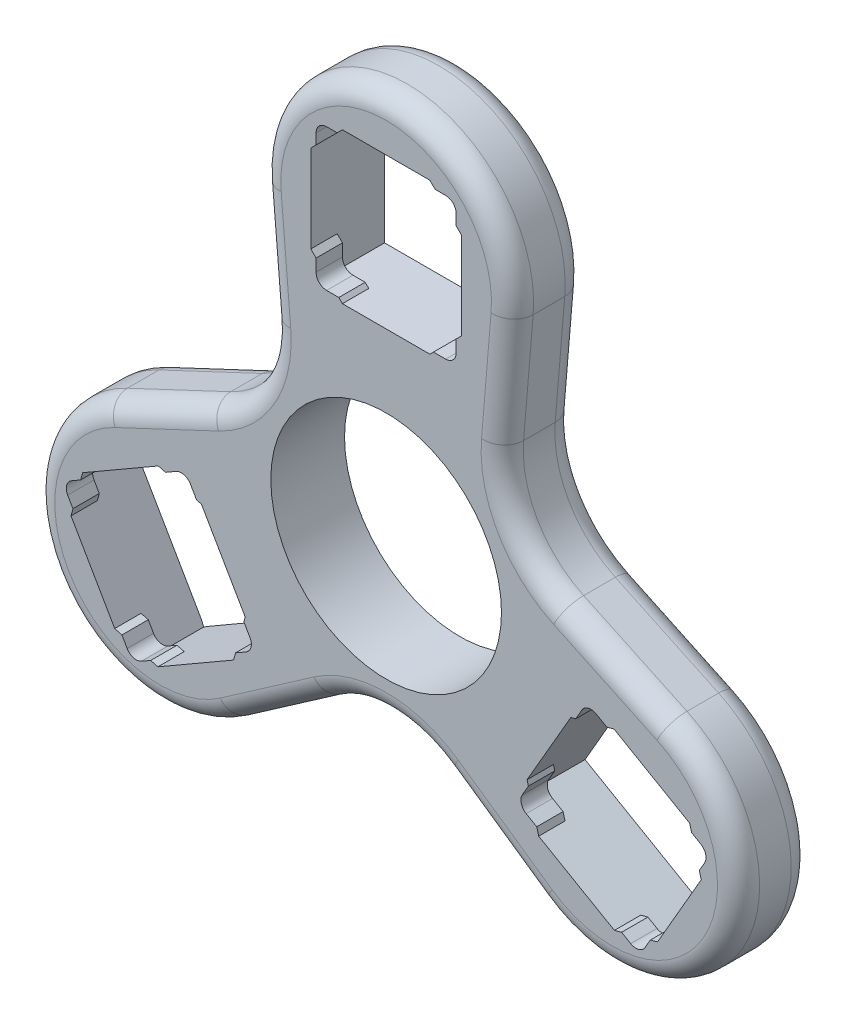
ISO-10303-21;
HEADER;
FILE_DESCRIPTION(('STEP AP214'),'2;1');
FILE_NAME('part.step','',(''),(''),'','','');
FILE_SCHEMA(('AUTOMOTIVE_DESIGN { 1 0 10303 214 1 1 1 1 }'));
ENDSEC;
DATA;
#1=APPLICATION_CONTEXT('core data for automotive mechanical design processes');
#2=APPLICATION_PROTOCOL_DEFINITION('international standard','automotive_design',2000,#1);
#3=PRODUCT_CONTEXT('',#1,'mechanical');
#4=PRODUCT('Part','Part','',(#3));
#5=PRODUCT_RELATED_PRODUCT_CATEGORY('part','',(#4));
#6=PRODUCT_DEFINITION_FORMATION('','',#4);
#7=PRODUCT_DEFINITION_CONTEXT('part definition',#1,'design');
#8=PRODUCT_DEFINITION('design','',#6,#7);
#9=PRODUCT_DEFINITION_SHAPE('','',#8);
#10=(LENGTH_UNIT() NAMED_UNIT(*) SI_UNIT(.MILLI.,.METRE.));
#11=(NAMED_UNIT(*) PLANE_ANGLE_UNIT() SI_UNIT($,.RADIAN.));
#12=(NAMED_UNIT(*) SI_UNIT($,.STERADIAN.) SOLID_ANGLE_UNIT());
#13=UNCERTAINTY_MEASURE_WITH_UNIT(LENGTH_MEASURE(1.E-05),#10,'distance_accuracy_value','');
#14=(GEOMETRIC_REPRESENTATION_CONTEXT(3) GLOBAL_UNCERTAINTY_ASSIGNED_CONTEXT((#13)) GLOBAL_UNIT_ASSIGNED_CONTEXT((#10,
#11,#12)) REPRESENTATION_CONTEXT('',''));
#15=CARTESIAN_POINT('',(0.,0.,0.));
#16=DIRECTION('',(0.,0.,1.));
#17=DIRECTION('',(1.,0.,0.));
#18=AXIS2_PLACEMENT_3D('',#15,#16,#17);
#19=CARTESIAN_POINT('',(21.6696405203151,-20.7670816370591,3.5));
#20=DIRECTION('',(0.25881904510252,-0.965925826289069,0.));
#21=DIRECTION('',(0.965925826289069,0.25881904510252,0.));
#22=AXIS2_PLACEMENT_3D('',#19,#20,#21);
#23=PLANE('',#22);
#24=DIRECTION('',(-0.965925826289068,-0.25881904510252,0.));
#25=VECTOR('',#24,1.);
#26=CARTESIAN_POINT('',(21.6696405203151,-20.7670816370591,1.));
#27=LINE('',#26,#25);
#28=CARTESIAN_POINT('',(25.7677167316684,-19.6690054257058,1.));
#29=VERTEX_POINT('',#28);
#30=CARTESIAN_POINT('',(25.0847040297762,-19.852018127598,1.));
#31=VERTEX_POINT('',#30);
#32=EDGE_CURVE('E1317',#29,#31,#27,.T.);
#33=ORIENTED_EDGE('',*,*,#32,.T.);
#34=DIRECTION('',(0.,0.,1.));
#35=VECTOR('',#34,1.);
#36=CARTESIAN_POINT('',(25.0847040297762,-19.852018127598,3.5));
#37=LINE('',#36,#35);
#38=CARTESIAN_POINT('',(25.0847040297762,-19.852018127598,3.5));
#39=VERTEX_POINT('',#38);
#40=EDGE_CURVE('E11',#31,#39,#37,.T.);
#41=ORIENTED_EDGE('',*,*,#40,.T.);
#42=DIRECTION('',(-0.965925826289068,-0.25881904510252,0.));
#43=VECTOR('',#42,1.);
#44=CARTESIAN_POINT('',(21.6696405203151,-20.7670816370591,3.5));
#45=LINE('',#44,#43);
#46=CARTESIAN_POINT('',(25.7677167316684,-19.6690054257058,3.5));
#47=VERTEX_POINT('',#46);
#48=EDGE_CURVE('E1281',#47,#39,#45,.T.);
#49=ORIENTED_EDGE('',*,*,#48,.F.);
#50=DIRECTION('',(0.,0.,-1.));
#51=VECTOR('',#50,1.);
#52=CARTESIAN_POINT('',(25.7677167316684,-19.6690054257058,3.5));
#53=LINE('',#52,#51);
#54=EDGE_CURVE('E1336',#47,#29,#53,.T.);
#55=ORIENTED_EDGE('',*,*,#54,.T.);
#56=EDGE_LOOP('',(#33,#41,#49,#55));
#57=FACE_BOUND('',#56,.T.);
#58=ADVANCED_FACE('F51',(#57),#23,.F.);
#59=CARTESIAN_POINT('',(29.9177167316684,-12.480994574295,3.5));
#60=DIRECTION('',(0.965925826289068,0.25881904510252,0.));
#61=DIRECTION('',(-0.25881904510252,0.965925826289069,0.));
#62=AXIS2_PLACEMENT_3D('',#59,#60,#61);
#63=PLANE('',#62);
#64=DIRECTION('',(0.25881904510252,-0.965925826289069,0.));
#65=VECTOR('',#64,1.);
#66=CARTESIAN_POINT('',(29.9177167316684,-12.480994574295,1.));
#67=LINE('',#66,#65);
#68=CARTESIAN_POINT('',(28.8196405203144,-8.38291836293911,1.));
#69=VERTEX_POINT('',#68);
#70=CARTESIAN_POINT('',(29.0026532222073,-9.06593106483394,1.));
#71=VERTEX_POINT('',#70);
#72=EDGE_CURVE('E1332',#69,#71,#67,.T.);
#73=ORIENTED_EDGE('',*,*,#72,.T.);
#74=DIRECTION('',(0.,0.,1.));
#75=VECTOR('',#74,1.);
#76=CARTESIAN_POINT('',(29.0026532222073,-9.06593106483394,3.5));
#77=LINE('',#76,#75);
#78=CARTESIAN_POINT('',(29.0026532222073,-9.06593106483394,3.5));
#79=VERTEX_POINT('',#78);
#80=EDGE_CURVE('E2584',#71,#79,#77,.T.);
#81=ORIENTED_EDGE('',*,*,#80,.T.);
#82=DIRECTION('',(0.25881904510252,-0.965925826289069,0.));
#83=VECTOR('',#82,1.);
#84=CARTESIAN_POINT('',(29.9177167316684,-12.480994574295,3.5));
#85=LINE('',#84,#83);
#86=CARTESIAN_POINT('',(28.8196405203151,-8.38291836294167,3.5));
#87=VERTEX_POINT('',#86);
#88=EDGE_CURVE('E1309',#87,#79,#85,.T.);
#89=ORIENTED_EDGE('',*,*,#88,.F.);
#90=DIRECTION('',(0.,0.,-1.));
#91=VECTOR('',#90,1.);
#92=CARTESIAN_POINT('',(28.8196405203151,-8.38291836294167,3.5));
#93=LINE('',#92,#91);
#94=EDGE_CURVE('E1343',#87,#69,#93,.T.);
#95=ORIENTED_EDGE('',*,*,#94,.T.);
#96=EDGE_LOOP('',(#73,#81,#89,#95));
#97=FACE_BOUND('',#96,.T.);
#98=ADVANCED_FACE('F1966',(#97),#63,.F.);
#99=CARTESIAN_POINT('',(17.533553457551,-5.33099457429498,3.5));
#100=DIRECTION('',(-0.258819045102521,0.965925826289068,0.));
#101=DIRECTION('',(-0.965925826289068,-0.258819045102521,0.));
#102=AXIS2_PLACEMENT_3D('',#99,#100,#101);
#103=PLANE('',#102);
#104=DIRECTION('',(0.965925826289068,0.258819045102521,0.));
#105=VECTOR('',#104,1.);
#106=CARTESIAN_POINT('',(17.533553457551,-5.33099457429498,1.));
#107=LINE('',#106,#105);
#108=CARTESIAN_POINT('',(17.533553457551,-5.33099457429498,1.));
#109=VERTEX_POINT('',#108);
#110=CARTESIAN_POINT('',(17.9997021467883,-5.20609040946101,1.));
#111=VERTEX_POINT('',#110);
#112=EDGE_CURVE('E1327',#109,#111,#107,.T.);
#113=ORIENTED_EDGE('',*,*,#112,.T.);
#114=DIRECTION('',(0.,0.,1.));
#115=VECTOR('',#114,1.);
#116=CARTESIAN_POINT('',(17.9997021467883,-5.20609040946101,3.5));
#117=LINE('',#116,#115);
#118=CARTESIAN_POINT('',(17.9997021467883,-5.20609040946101,3.5));
#119=VERTEX_POINT('',#118);
#120=EDGE_CURVE('E2559',#111,#119,#117,.T.);
#121=ORIENTED_EDGE('',*,*,#120,.T.);
#122=DIRECTION('',(0.965925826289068,0.258819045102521,0.));
#123=VECTOR('',#122,1.);
#124=CARTESIAN_POINT('',(17.533553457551,-5.33099457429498,3.5));
#125=LINE('',#124,#123);
#126=CARTESIAN_POINT('',(17.533553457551,-5.33099457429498,3.5));
#127=VERTEX_POINT('',#126);
#128=EDGE_CURVE('E1300',#127,#119,#125,.T.);
#129=ORIENTED_EDGE('',*,*,#128,.F.);
#130=DIRECTION('',(0.,0.,-1.));
#131=VECTOR('',#130,1.);
#132=CARTESIAN_POINT('',(17.533553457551,-5.33099457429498,3.5));
#133=LINE('',#132,#131);
#134=EDGE_CURVE('E1350',#127,#109,#133,.T.);
#135=ORIENTED_EDGE('',*,*,#134,.T.);
#136=EDGE_LOOP('',(#113,#121,#129,#135));
#137=FACE_BOUND('',#136,.T.);
#138=ADVANCED_FACE('F1973',(#137),#103,.F.);
#139=CARTESIAN_POINT('',(14.4816296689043,-16.6170816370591,3.5));
#140=DIRECTION('',(-0.965925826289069,-0.25881904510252,0.));
#141=DIRECTION('',(0.25881904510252,-0.965925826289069,0.));
#142=AXIS2_PLACEMENT_3D('',#139,#140,#141);
#143=PLANE('',#142);
#144=DIRECTION('',(-0.25881904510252,0.965925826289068,0.));
#145=VECTOR('',#144,1.);
#146=CARTESIAN_POINT('',(14.4816296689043,-16.6170816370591,1.));
#147=LINE('',#146,#145);
#148=CARTESIAN_POINT('',(14.4816296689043,-16.6170816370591,1.));
#149=VERTEX_POINT('',#148);
#150=CARTESIAN_POINT('',(14.2986169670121,-15.934068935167,1.));
#151=VERTEX_POINT('',#150);
#152=EDGE_CURVE('E1322',#149,#151,#147,.T.);
#153=ORIENTED_EDGE('',*,*,#152,.T.);
#154=DIRECTION('',(0.,0.,1.));
#155=VECTOR('',#154,1.);
#156=CARTESIAN_POINT('',(14.2986169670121,-15.934068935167,3.5));
#157=LINE('',#156,#155);
#158=CARTESIAN_POINT('',(14.2986169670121,-15.934068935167,3.5));
#159=VERTEX_POINT('',#158);
#160=EDGE_CURVE('E2599',#151,#159,#157,.T.);
#161=ORIENTED_EDGE('',*,*,#160,.T.);
#162=DIRECTION('',(-0.25881904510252,0.965925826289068,0.));
#163=VECTOR('',#162,1.);
#164=CARTESIAN_POINT('',(14.4816296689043,-16.6170816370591,3.5));
#165=LINE('',#164,#163);
#166=CARTESIAN_POINT('',(14.4816296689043,-16.6170816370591,3.5));
#167=VERTEX_POINT('',#166);
#168=EDGE_CURVE('E1291',#167,#159,#165,.T.);
#169=ORIENTED_EDGE('',*,*,#168,.F.);
#170=DIRECTION('',(0.,0.,-1.));
#171=VECTOR('',#170,1.);
#172=CARTESIAN_POINT('',(14.4816296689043,-16.6170816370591,3.5));
#173=LINE('',#172,#171);
#174=EDGE_CURVE('E1357',#167,#149,#173,.T.);
#175=ORIENTED_EDGE('',*,*,#174,.T.);
#176=EDGE_LOOP('',(#153,#161,#169,#175));
#177=FACE_BOUND('',#176,.T.);
#178=ADVANCED_FACE('F2931',(#177),#143,.F.);
#179=CARTESIAN_POINT('',(-4.15,32.15,3.5));
#180=DIRECTION('',(-0.707106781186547,0.707106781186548,0.));
#181=DIRECTION('',(-0.707106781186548,-0.707106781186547,0.));
#182=AXIS2_PLACEMENT_3D('',#179,#180,#181);
#183=PLANE('',#182);
#184=DIRECTION('',(0.707106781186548,0.707106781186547,0.));
#185=VECTOR('',#184,1.);
#186=CARTESIAN_POINT('',(-4.15,32.15,1.));
#187=LINE('',#186,#185);
#188=CARTESIAN_POINT('',(-7.15,29.15,1.));
#189=VERTEX_POINT('',#188);
#190=CARTESIAN_POINT('',(-6.65,29.65,1.));
#191=VERTEX_POINT('',#190);
#192=EDGE_CURVE('E1202',#189,#191,#187,.T.);
#193=ORIENTED_EDGE('',*,*,#192,.T.);
#194=DIRECTION('',(0.,0.,1.));
#195=VECTOR('',#194,1.);
#196=CARTESIAN_POINT('',(-6.65,29.65,3.5));
#197=LINE('',#196,#195);
#198=CARTESIAN_POINT('',(-6.65,29.65,3.5));
#199=VERTEX_POINT('',#198);
#200=EDGE_CURVE('E2606',#191,#199,#197,.T.);
#201=ORIENTED_EDGE('',*,*,#200,.T.);
#202=DIRECTION('',(0.707106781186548,0.707106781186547,0.));
#203=VECTOR('',#202,1.);
#204=CARTESIAN_POINT('',(-4.15,32.15,3.5));
#205=LINE('',#204,#203);
#206=CARTESIAN_POINT('',(-7.15,29.15,3.5));
#207=VERTEX_POINT('',#206);
#208=EDGE_CURVE('E1230',#207,#199,#205,.T.);
#209=ORIENTED_EDGE('',*,*,#208,.F.);
#210=DIRECTION('',(0.,0.,-1.));
#211=VECTOR('',#210,1.);
#212=CARTESIAN_POINT('',(-7.15,29.15,3.5));
#213=LINE('',#212,#211);
#214=EDGE_CURVE('E1258',#207,#189,#213,.T.);
#215=ORIENTED_EDGE('',*,*,#214,.T.);
#216=EDGE_LOOP('',(#193,#201,#209,#215));
#217=FACE_BOUND('',#216,.T.);
#218=ADVANCED_FACE('F2900',(#217),#183,.F.);
#219=CARTESIAN_POINT('',(-4.15,17.85,3.5));
#220=DIRECTION('',(-0.707106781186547,-0.707106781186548,0.));
#221=DIRECTION('',(0.707106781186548,-0.707106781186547,0.));
#222=AXIS2_PLACEMENT_3D('',#219,#220,#221);
#223=PLANE('',#222);
#224=DIRECTION('',(-0.707106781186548,0.707106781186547,0.));
#225=VECTOR('',#224,1.);
#226=CARTESIAN_POINT('',(-4.15,17.85,1.));
#227=LINE('',#226,#225);
#228=CARTESIAN_POINT('',(-4.15,17.85,1.));
#229=VERTEX_POINT('',#228);
#230=CARTESIAN_POINT('',(-4.49124452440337,18.1912445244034,1.));
#231=VERTEX_POINT('',#230);
#232=EDGE_CURVE('E1246',#229,#231,#227,.T.);
#233=ORIENTED_EDGE('',*,*,#232,.T.);
#234=DIRECTION('',(0.,0.,1.));
#235=VECTOR('',#234,1.);
#236=CARTESIAN_POINT('',(-4.49124452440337,18.1912445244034,3.5));
#237=LINE('',#236,#235);
#238=CARTESIAN_POINT('',(-4.49124452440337,18.1912445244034,3.5));
#239=VERTEX_POINT('',#238);
#240=EDGE_CURVE('E2614',#231,#239,#237,.T.);
#241=ORIENTED_EDGE('',*,*,#240,.T.);
#242=DIRECTION('',(-0.707106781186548,0.707106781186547,0.));
#243=VECTOR('',#242,1.);
#244=CARTESIAN_POINT('',(-4.15,17.85,3.5));
#245=LINE('',#244,#243);
#246=CARTESIAN_POINT('',(-4.15,17.85,3.5));
#247=VERTEX_POINT('',#246);
#248=EDGE_CURVE('E1221',#247,#239,#245,.T.);
#249=ORIENTED_EDGE('',*,*,#248,.F.);
#250=DIRECTION('',(0.,0.,-1.));
#251=VECTOR('',#250,1.);
#252=CARTESIAN_POINT('',(-4.15,17.85,3.5));
#253=LINE('',#252,#251);
#254=EDGE_CURVE('E1265',#247,#229,#253,.T.);
#255=ORIENTED_EDGE('',*,*,#254,.T.);
#256=EDGE_LOOP('',(#233,#241,#249,#255));
#257=FACE_BOUND('',#256,.T.);
#258=ADVANCED_FACE('F3070',(#257),#223,.F.);
#259=CARTESIAN_POINT('',(7.15,20.85,3.5));
#260=DIRECTION('',(0.707106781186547,-0.707106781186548,0.));
#261=DIRECTION('',(0.707106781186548,0.707106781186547,0.));
#262=AXIS2_PLACEMENT_3D('',#259,#260,#261);
#263=PLANE('',#262);
#264=DIRECTION('',(-0.707106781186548,-0.707106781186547,0.));
#265=VECTOR('',#264,1.);
#266=CARTESIAN_POINT('',(7.15,20.85,1.));
#267=LINE('',#266,#265);
#268=CARTESIAN_POINT('',(7.15,20.85,1.));
#269=VERTEX_POINT('',#268);
#270=CARTESIAN_POINT('',(6.65,20.35,1.));
#271=VERTEX_POINT('',#270);
#272=EDGE_CURVE('E1241',#269,#271,#267,.T.);
#273=ORIENTED_EDGE('',*,*,#272,.T.);
#274=DIRECTION('',(0.,0.,1.));
#275=VECTOR('',#274,1.);
#276=CARTESIAN_POINT('',(6.65,20.35,3.5));
#277=LINE('',#276,#275);
#278=CARTESIAN_POINT('',(6.65,20.35,3.5));
#279=VERTEX_POINT('',#278);
#280=EDGE_CURVE('E2622',#271,#279,#277,.T.);
#281=ORIENTED_EDGE('',*,*,#280,.T.);
#282=DIRECTION('',(-0.707106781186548,-0.707106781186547,0.));
#283=VECTOR('',#282,1.);
#284=CARTESIAN_POINT('',(7.15,20.85,3.5));
#285=LINE('',#284,#283);
#286=CARTESIAN_POINT('',(7.15,20.85,3.5));
#287=VERTEX_POINT('',#286);
#288=EDGE_CURVE('E1212',#287,#279,#285,.T.);
#289=ORIENTED_EDGE('',*,*,#288,.F.);
#290=DIRECTION('',(0.,0.,-1.));
#291=VECTOR('',#290,1.);
#292=CARTESIAN_POINT('',(7.15,20.85,3.5));
#293=LINE('',#292,#291);
#294=EDGE_CURVE('E1272',#287,#269,#293,.T.);
#295=ORIENTED_EDGE('',*,*,#294,.T.);
#296=EDGE_LOOP('',(#273,#281,#289,#295));
#297=FACE_BOUND('',#296,.T.);
#298=ADVANCED_FACE('F3074',(#297),#263,.F.);
#299=CARTESIAN_POINT('',(7.15,29.15,3.5));
#300=DIRECTION('',(0.707106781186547,0.707106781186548,0.));
#301=DIRECTION('',(-0.707106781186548,0.707106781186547,0.));
#302=AXIS2_PLACEMENT_3D('',#299,#300,#301);
#303=PLANE('',#302);
#304=DIRECTION('',(0.707106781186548,-0.707106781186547,0.));
#305=VECTOR('',#304,1.);
#306=CARTESIAN_POINT('',(7.15,29.15,1.));
#307=LINE('',#306,#305);
#308=CARTESIAN_POINT('',(4.15,32.15,1.));
#309=VERTEX_POINT('',#308);
#310=CARTESIAN_POINT('',(4.65,31.65,1.));
#311=VERTEX_POINT('',#310);
#312=EDGE_CURVE('E1235',#309,#311,#307,.T.);
#313=ORIENTED_EDGE('',*,*,#312,.T.);
#314=DIRECTION('',(0.,0.,1.));
#315=VECTOR('',#314,1.);
#316=CARTESIAN_POINT('',(4.65,31.65,3.5));
#317=LINE('',#316,#315);
#318=CARTESIAN_POINT('',(4.65,31.65,3.5));
#319=VERTEX_POINT('',#318);
#320=EDGE_CURVE('E2630',#311,#319,#317,.T.);
#321=ORIENTED_EDGE('',*,*,#320,.T.);
#322=DIRECTION('',(0.707106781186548,-0.707106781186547,0.));
#323=VECTOR('',#322,1.);
#324=CARTESIAN_POINT('',(7.15,29.15,3.5));
#325=LINE('',#324,#323);
#326=CARTESIAN_POINT('',(4.15,32.15,3.5));
#327=VERTEX_POINT('',#326);
#328=EDGE_CURVE('E1203',#327,#319,#325,.T.);
#329=ORIENTED_EDGE('',*,*,#328,.F.);
#330=DIRECTION('',(0.,0.,-1.));
#331=VECTOR('',#330,1.);
#332=CARTESIAN_POINT('',(4.15,32.15,3.5));
#333=LINE('',#332,#331);
#334=EDGE_CURVE('E1234',#327,#309,#333,.T.);
#335=ORIENTED_EDGE('',*,*,#334,.T.);
#336=EDGE_LOOP('',(#313,#321,#329,#335));
#337=FACE_BOUND('',#336,.T.);
#338=ADVANCED_FACE('F3077',(#337),#303,.F.);
#339=CARTESIAN_POINT('',(-28.8196405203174,-8.38291836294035,3.5));
#340=DIRECTION('',(-0.965925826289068,0.258819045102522,0.));
#341=DIRECTION('',(-0.258819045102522,-0.965925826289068,0.));
#342=AXIS2_PLACEMENT_3D('',#339,#340,#341);
#343=PLANE('',#342);
#344=DIRECTION('',(0.258819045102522,0.965925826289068,0.));
#345=VECTOR('',#344,1.);
#346=CARTESIAN_POINT('',(-28.8196405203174,-8.38291836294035,1.));
#347=LINE('',#346,#345);
#348=CARTESIAN_POINT('',(-29.9177167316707,-12.4809945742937,1.));
#349=VERTEX_POINT('',#348);
#350=CARTESIAN_POINT('',(-29.7347040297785,-11.7979818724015,1.));
#351=VERTEX_POINT('',#350);
#352=EDGE_CURVE('E1149',#349,#351,#347,.T.);
#353=ORIENTED_EDGE('',*,*,#352,.T.);
#354=DIRECTION('',(0.,0.,1.));
#355=VECTOR('',#354,1.);
#356=CARTESIAN_POINT('',(-29.7347040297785,-11.7979818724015,3.5));
#357=LINE('',#356,#355);
#358=CARTESIAN_POINT('',(-29.7347040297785,-11.7979818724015,3.5));
#359=VERTEX_POINT('',#358);
#360=EDGE_CURVE('E2638',#351,#359,#357,.T.);
#361=ORIENTED_EDGE('',*,*,#360,.T.);
#362=DIRECTION('',(0.258819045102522,0.965925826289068,0.));
#363=VECTOR('',#362,1.);
#364=CARTESIAN_POINT('',(-28.8196405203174,-8.38291836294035,3.5));
#365=LINE('',#364,#363);
#366=CARTESIAN_POINT('',(-29.9177167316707,-12.4809945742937,3.5));
#367=VERTEX_POINT('',#366);
#368=EDGE_CURVE('E1112',#367,#359,#365,.T.);
#369=ORIENTED_EDGE('',*,*,#368,.F.);
#370=DIRECTION('',(0.,0.,-1.));
#371=VECTOR('',#370,1.);
#372=CARTESIAN_POINT('',(-29.9177167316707,-12.4809945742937,3.5));
#373=LINE('',#372,#371);
#374=EDGE_CURVE('E1169',#367,#349,#373,.T.);
#375=ORIENTED_EDGE('',*,*,#374,.T.);
#376=EDGE_LOOP('',(#353,#361,#369,#375));
#377=FACE_BOUND('',#376,.T.);
#378=ADVANCED_FACE('F3062',(#377),#343,.F.);
#379=CARTESIAN_POINT('',(-25.7677167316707,-19.6690054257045,3.5));
#380=DIRECTION('',(-0.258819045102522,-0.965925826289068,0.));
#381=DIRECTION('',(0.965925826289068,-0.258819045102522,0.));
#382=AXIS2_PLACEMENT_3D('',#379,#380,#381);
#383=PLANE('',#382);
#384=DIRECTION('',(-0.965925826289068,0.258819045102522,0.));
#385=VECTOR('',#384,1.);
#386=CARTESIAN_POINT('',(-25.7677167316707,-19.6690054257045,1.));
#387=LINE('',#386,#385);
#388=CARTESIAN_POINT('',(-21.6696405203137,-20.7670816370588,1.));
#389=VERTEX_POINT('',#388);
#390=CARTESIAN_POINT('',(-22.3526532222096,-20.5840689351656,1.));
#391=VERTEX_POINT('',#390);
#392=EDGE_CURVE('E1165',#389,#391,#387,.T.);
#393=ORIENTED_EDGE('',*,*,#392,.T.);
#394=DIRECTION('',(0.,0.,1.));
#395=VECTOR('',#394,1.);
#396=CARTESIAN_POINT('',(-22.3526532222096,-20.5840689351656,3.5));
#397=LINE('',#396,#395);
#398=CARTESIAN_POINT('',(-22.3526532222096,-20.5840689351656,3.5));
#399=VERTEX_POINT('',#398);
#400=EDGE_CURVE('E2646',#391,#399,#397,.T.);
#401=ORIENTED_EDGE('',*,*,#400,.T.);
#402=DIRECTION('',(-0.965925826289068,0.258819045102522,0.));
#403=VECTOR('',#402,1.);
#404=CARTESIAN_POINT('',(-25.7677167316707,-19.6690054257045,3.5));
#405=LINE('',#404,#403);
#406=CARTESIAN_POINT('',(-21.6696405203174,-20.7670816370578,3.5));
#407=VERTEX_POINT('',#406);
#408=EDGE_CURVE('E1140',#407,#399,#405,.T.);
#409=ORIENTED_EDGE('',*,*,#408,.F.);
#410=DIRECTION('',(0.,0.,-1.));
#411=VECTOR('',#410,1.);
#412=CARTESIAN_POINT('',(-21.6696405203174,-20.7670816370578,3.5));
#413=LINE('',#412,#411);
#414=EDGE_CURVE('E1177',#407,#389,#413,.T.);
#415=ORIENTED_EDGE('',*,*,#414,.T.);
#416=EDGE_LOOP('',(#393,#401,#409,#415));
#417=FACE_BOUND('',#416,.T.);
#418=ADVANCED_FACE('F2818',(#417),#383,.F.);
#419=CARTESIAN_POINT('',(-13.3835534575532,-12.5190054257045,3.5));
#420=DIRECTION('',(0.965925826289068,-0.258819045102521,0.));
#421=DIRECTION('',(0.258819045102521,0.965925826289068,0.));
#422=AXIS2_PLACEMENT_3D('',#419,#420,#421);
#423=PLANE('',#422);
#424=DIRECTION('',(-0.258819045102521,-0.965925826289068,0.));
#425=VECTOR('',#424,1.);
#426=CARTESIAN_POINT('',(-13.3835534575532,-12.5190054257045,1.));
#427=LINE('',#426,#425);
#428=CARTESIAN_POINT('',(-13.3835534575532,-12.5190054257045,1.));
#429=VERTEX_POINT('',#428);
#430=CARTESIAN_POINT('',(-13.5084576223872,-12.9851541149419,1.));
#431=VERTEX_POINT('',#430);
#432=EDGE_CURVE('E1160',#429,#431,#427,.T.);
#433=ORIENTED_EDGE('',*,*,#432,.T.);
#434=DIRECTION('',(0.,0.,1.));
#435=VECTOR('',#434,1.);
#436=CARTESIAN_POINT('',(-13.5084576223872,-12.9851541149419,3.5));
#437=LINE('',#436,#435);
#438=CARTESIAN_POINT('',(-13.5084576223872,-12.9851541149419,3.5));
#439=VERTEX_POINT('',#438);
#440=EDGE_CURVE('E2654',#431,#439,#437,.T.);
#441=ORIENTED_EDGE('',*,*,#440,.T.);
#442=DIRECTION('',(-0.258819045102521,-0.965925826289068,0.));
#443=VECTOR('',#442,1.);
#444=CARTESIAN_POINT('',(-13.3835534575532,-12.5190054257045,3.5));
#445=LINE('',#444,#443);
#446=CARTESIAN_POINT('',(-13.3835534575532,-12.5190054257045,3.5));
#447=VERTEX_POINT('',#446);
#448=EDGE_CURVE('E1131',#447,#439,#445,.T.);
#449=ORIENTED_EDGE('',*,*,#448,.F.);
#450=DIRECTION('',(0.,0.,-1.));
#451=VECTOR('',#450,1.);
#452=CARTESIAN_POINT('',(-13.3835534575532,-12.5190054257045,3.5));
#453=LINE('',#452,#451);
#454=EDGE_CURVE('E1184',#447,#429,#453,.T.);
#455=ORIENTED_EDGE('',*,*,#454,.T.);
#456=EDGE_LOOP('',(#433,#441,#449,#455));
#457=FACE_BOUND('',#456,.T.);
#458=ADVANCED_FACE('F3056',(#457),#423,.F.);
#459=CARTESIAN_POINT('',(-21.6316296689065,-4.23291836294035,3.5));
#460=DIRECTION('',(0.258819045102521,0.965925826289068,0.));
#461=DIRECTION('',(-0.965925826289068,0.258819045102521,0.));
#462=AXIS2_PLACEMENT_3D('',#459,#460,#461);
#463=PLANE('',#462);
#464=DIRECTION('',(0.965925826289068,-0.258819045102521,0.));
#465=VECTOR('',#464,1.);
#466=CARTESIAN_POINT('',(-21.6316296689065,-4.23291836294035,1.));
#467=LINE('',#466,#465);
#468=CARTESIAN_POINT('',(-21.6316296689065,-4.23291836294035,1.));
#469=VERTEX_POINT('',#468);
#470=CARTESIAN_POINT('',(-20.9486169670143,-4.41593106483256,1.));
#471=VERTEX_POINT('',#470);
#472=EDGE_CURVE('E1155',#469,#471,#467,.T.);
#473=ORIENTED_EDGE('',*,*,#472,.T.);
#474=DIRECTION('',(0.,0.,1.));
#475=VECTOR('',#474,1.);
#476=CARTESIAN_POINT('',(-20.9486169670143,-4.41593106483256,3.5));
#477=LINE('',#476,#475);
#478=CARTESIAN_POINT('',(-20.9486169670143,-4.41593106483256,3.5));
#479=VERTEX_POINT('',#478);
#480=EDGE_CURVE('E2662',#471,#479,#477,.T.);
#481=ORIENTED_EDGE('',*,*,#480,.T.);
#482=DIRECTION('',(0.965925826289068,-0.258819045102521,0.));
#483=VECTOR('',#482,1.);
#484=CARTESIAN_POINT('',(-21.6316296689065,-4.23291836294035,3.5));
#485=LINE('',#484,#483);
#486=CARTESIAN_POINT('',(-21.6316296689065,-4.23291836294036,3.5));
#487=VERTEX_POINT('',#486);
#488=EDGE_CURVE('E1122',#487,#479,#485,.T.);
#489=ORIENTED_EDGE('',*,*,#488,.F.);
#490=DIRECTION('',(0.,0.,-1.));
#491=VECTOR('',#490,1.);
#492=CARTESIAN_POINT('',(-21.6316296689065,-4.23291836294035,3.5));
#493=LINE('',#492,#491);
#494=EDGE_CURVE('E1191',#487,#469,#493,.T.);
#495=ORIENTED_EDGE('',*,*,#494,.T.);
#496=EDGE_LOOP('',(#473,#481,#489,#495));
#497=FACE_BOUND('',#496,.T.);
#498=ADVANCED_FACE('F2699',(#497),#463,.F.);
#499=CARTESIAN_POINT('',(0.,25.,1.));
#500=DIRECTION('',(0.,0.,1.));
#501=DIRECTION('',(1.,0.,0.));
#502=AXIS2_PLACEMENT_3D('',#499,#500,#501);
#503=PLANE('',#502);
#504=CARTESIAN_POINT('',(5.65,30.65,1.));
#505=DIRECTION('',(0.,0.,-1.));
#506=DIRECTION('',(-1.,0.,0.));
#507=AXIS2_PLACEMENT_3D('',#504,#505,#506);
#508=CIRCLE('',#507,0.999999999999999);
#509=CARTESIAN_POINT('',(5.65,31.65,1.));
#510=VERTEX_POINT('',#509);
#511=CARTESIAN_POINT('',(6.65,30.65,1.));
#512=VERTEX_POINT('',#511);
#513=EDGE_CURVE('E1053',#510,#512,#508,.T.);
#514=ORIENTED_EDGE('',*,*,#513,.F.);
#515=DIRECTION('',(1.,0.,0.));
#516=VECTOR('',#515,1.);
#517=CARTESIAN_POINT('',(5.65,31.65,1.));
#518=LINE('',#517,#516);
#519=EDGE_CURVE('E1088',#311,#510,#518,.T.);
#520=ORIENTED_EDGE('',*,*,#519,.F.);
#521=ORIENTED_EDGE('',*,*,#312,.F.);
#522=DIRECTION('',(-1.,0.,0.));
#523=VECTOR('',#522,1.);
#524=CARTESIAN_POINT('',(-7.15,32.15,1.));
#525=LINE('',#524,#523);
#526=CARTESIAN_POINT('',(7.15,32.15,1.));
#527=VERTEX_POINT('',#526);
#528=EDGE_CURVE('E1399',#527,#309,#525,.T.);
#529=ORIENTED_EDGE('',*,*,#528,.F.);
#530=DIRECTION('',(0.,1.,0.));
#531=VECTOR('',#530,1.);
#532=CARTESIAN_POINT('',(7.15,32.15,1.));
#533=LINE('',#532,#531);
#534=CARTESIAN_POINT('',(7.15,29.15,1.));
#535=VERTEX_POINT('',#534);
#536=EDGE_CURVE('E1403',#535,#527,#533,.T.);
#537=ORIENTED_EDGE('',*,*,#536,.F.);
#538=CARTESIAN_POINT('',(6.65,29.65,1.));
#539=VERTEX_POINT('',#538);
#540=EDGE_CURVE('E1240',#539,#535,#307,.T.);
#541=ORIENTED_EDGE('',*,*,#540,.F.);
#542=DIRECTION('',(0.,-1.,0.));
#543=VECTOR('',#542,1.);
#544=CARTESIAN_POINT('',(6.65,30.65,1.));
#545=LINE('',#544,#543);
#546=EDGE_CURVE('E1100',#512,#539,#545,.T.);
#547=ORIENTED_EDGE('',*,*,#546,.F.);
#548=EDGE_LOOP('',(#514,#520,#521,#529,#537,#541,#547));
#549=FACE_BOUND('',#548,.T.);
#550=ADVANCED_FACE('F2778',(#549),#503,.F.);
#551=CARTESIAN_POINT('',(5.65,19.1912445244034,1.));
#552=DIRECTION('',(0.,0.,-1.));
#553=DIRECTION('',(1.,0.,0.));
#554=AXIS2_PLACEMENT_3D('',#551,#552,#553);
#555=CIRCLE('',#554,0.999999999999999);
#556=CARTESIAN_POINT('',(6.65,19.1912445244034,1.));
#557=VERTEX_POINT('',#556);
#558=CARTESIAN_POINT('',(5.65,18.1912445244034,1.));
#559=VERTEX_POINT('',#558);
#560=EDGE_CURVE('E981',#557,#559,#555,.T.);
#561=ORIENTED_EDGE('',*,*,#560,.F.);
#562=DIRECTION('',(0.,-1.,0.));
#563=VECTOR('',#562,1.);
#564=CARTESIAN_POINT('',(6.65,19.1912445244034,1.));
#565=LINE('',#564,#563);
#566=EDGE_CURVE('E972',#271,#557,#565,.T.);
#567=ORIENTED_EDGE('',*,*,#566,.F.);
#568=ORIENTED_EDGE('',*,*,#272,.F.);
#569=CARTESIAN_POINT('',(7.15,17.85,1.));
#570=VERTEX_POINT('',#569);
#571=EDGE_CURVE('E1404',#570,#269,#533,.T.);
#572=ORIENTED_EDGE('',*,*,#571,.F.);
#573=DIRECTION('',(1.,0.,0.));
#574=VECTOR('',#573,1.);
#575=CARTESIAN_POINT('',(-7.15,17.85,1.));
#576=LINE('',#575,#574);
#577=CARTESIAN_POINT('',(4.15,17.85,1.));
#578=VERTEX_POINT('',#577);
#579=EDGE_CURVE('E1554',#578,#570,#576,.T.);
#580=ORIENTED_EDGE('',*,*,#579,.F.);
#581=CARTESIAN_POINT('',(4.49124452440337,18.1912445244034,1.));
#582=VERTEX_POINT('',#581);
#583=EDGE_CURVE('E1239',#582,#578,#267,.T.);
#584=ORIENTED_EDGE('',*,*,#583,.F.);
#585=DIRECTION('',(-1.,0.,0.));
#586=VECTOR('',#585,1.);
#587=CARTESIAN_POINT('',(5.65,18.1912445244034,1.));
#588=LINE('',#587,#586);
#589=EDGE_CURVE('E985',#559,#582,#588,.T.);
#590=ORIENTED_EDGE('',*,*,#589,.F.);
#591=EDGE_LOOP('',(#561,#567,#568,#572,#580,#584,#590));
#592=FACE_BOUND('',#591,.T.);
#593=ADVANCED_FACE('F2781',(#592),#503,.F.);
#594=CARTESIAN_POINT('',(-5.65,19.1912445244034,1.));
#595=DIRECTION('',(0.,0.,-1.));
#596=DIRECTION('',(-1.,0.,0.));
#597=AXIS2_PLACEMENT_3D('',#594,#595,#596);
#598=CIRCLE('',#597,0.999999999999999);
#599=CARTESIAN_POINT('',(-5.65,18.1912445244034,1.));
#600=VERTEX_POINT('',#599);
#601=CARTESIAN_POINT('',(-6.65,19.1912445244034,1.));
#602=VERTEX_POINT('',#601);
#603=EDGE_CURVE('E995',#600,#602,#598,.T.);
#604=ORIENTED_EDGE('',*,*,#603,.F.);
#605=DIRECTION('',(-1.,0.,0.));
#606=VECTOR('',#605,1.);
#607=CARTESIAN_POINT('',(-5.65,18.1912445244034,1.));
#608=LINE('',#607,#606);
#609=EDGE_CURVE('E1061',#231,#600,#608,.T.);
#610=ORIENTED_EDGE('',*,*,#609,.F.);
#611=ORIENTED_EDGE('',*,*,#232,.F.);
#612=CARTESIAN_POINT('',(-7.15,17.85,1.));
#613=VERTEX_POINT('',#612);
#614=EDGE_CURVE('E1555',#613,#229,#576,.T.);
#615=ORIENTED_EDGE('',*,*,#614,.F.);
#616=DIRECTION('',(0.,-1.,0.));
#617=VECTOR('',#616,1.);
#618=CARTESIAN_POINT('',(-7.15,32.15,1.));
#619=LINE('',#618,#617);
#620=CARTESIAN_POINT('',(-7.15,20.85,1.));
#621=VERTEX_POINT('',#620);
#622=EDGE_CURVE('E1393',#621,#613,#619,.T.);
#623=ORIENTED_EDGE('',*,*,#622,.F.);
#624=CARTESIAN_POINT('',(-6.65,20.35,1.));
#625=VERTEX_POINT('',#624);
#626=EDGE_CURVE('E1245',#625,#621,#227,.T.);
#627=ORIENTED_EDGE('',*,*,#626,.F.);
#628=DIRECTION('',(0.,1.,0.));
#629=VECTOR('',#628,1.);
#630=CARTESIAN_POINT('',(-6.65,19.1912445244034,1.));
#631=LINE('',#630,#629);
#632=EDGE_CURVE('E1073',#602,#625,#631,.T.);
#633=ORIENTED_EDGE('',*,*,#632,.F.);
#634=EDGE_LOOP('',(#604,#610,#611,#615,#623,#627,#633));
#635=FACE_BOUND('',#634,.T.);
#636=ADVANCED_FACE('F2912',(#635),#503,.F.);
#637=CARTESIAN_POINT('',(-5.65,30.65,1.));
#638=DIRECTION('',(0.,0.,-1.));
#639=DIRECTION('',(1.,0.,0.));
#640=AXIS2_PLACEMENT_3D('',#637,#638,#639);
#641=CIRCLE('',#640,0.999999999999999);
#642=CARTESIAN_POINT('',(-6.65,30.65,1.));
#643=VERTEX_POINT('',#642);
#644=CARTESIAN_POINT('',(-5.65,31.65,1.));
#645=VERTEX_POINT('',#644);
#646=EDGE_CURVE('E1039',#643,#645,#641,.T.);
#647=ORIENTED_EDGE('',*,*,#646,.F.);
#648=DIRECTION('',(0.,1.,0.));
#649=VECTOR('',#648,1.);
#650=CARTESIAN_POINT('',(-6.65,30.65,1.));
#651=LINE('',#650,#649);
#652=EDGE_CURVE('E1030',#191,#643,#651,.T.);
#653=ORIENTED_EDGE('',*,*,#652,.F.);
#654=ORIENTED_EDGE('',*,*,#192,.F.);
#655=CARTESIAN_POINT('',(-7.15,32.15,1.));
#656=VERTEX_POINT('',#655);
#657=EDGE_CURVE('E1394',#656,#189,#619,.T.);
#658=ORIENTED_EDGE('',*,*,#657,.F.);
#659=CARTESIAN_POINT('',(-4.15,32.15,1.));
#660=VERTEX_POINT('',#659);
#661=EDGE_CURVE('E1398',#660,#656,#525,.T.);
#662=ORIENTED_EDGE('',*,*,#661,.F.);
#663=CARTESIAN_POINT('',(-4.65,31.65,1.));
#664=VERTEX_POINT('',#663);
#665=EDGE_CURVE('E1250',#664,#660,#187,.T.);
#666=ORIENTED_EDGE('',*,*,#665,.F.);
#667=DIRECTION('',(1.,0.,0.));
#668=VECTOR('',#667,1.);
#669=CARTESIAN_POINT('',(-5.65,31.65,1.));
#670=LINE('',#669,#668);
#671=EDGE_CURVE('E1043',#645,#664,#670,.T.);
#672=ORIENTED_EDGE('',*,*,#671,.F.);
#673=EDGE_LOOP('',(#647,#653,#654,#658,#662,#666,#672));
#674=FACE_BOUND('',#673,.T.);
#675=ADVANCED_FACE('F2783',(#674),#503,.F.);
#676=CARTESIAN_POINT('',(21.6506350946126,-12.4999999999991,1.));
#677=DIRECTION('',(0.,0.,1.));
#678=DIRECTION('',(1.,0.,0.));
#679=AXIS2_PLACEMENT_3D('',#676,#677,#678);
#680=PLANE('',#679);
#681=CARTESIAN_POINT('',(23.7186786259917,-20.2180435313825,1.));
#682=DIRECTION('',(0.,0.,-1.));
#683=DIRECTION('',(-1.,0.,0.));
#684=AXIS2_PLACEMENT_3D('',#681,#682,#683);
#685=CIRCLE('',#684,0.999999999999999);
#686=CARTESIAN_POINT('',(24.5847040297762,-20.7180435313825,1.));
#687=VERTEX_POINT('',#686);
#688=CARTESIAN_POINT('',(23.2186786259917,-21.084068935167,1.));
#689=VERTEX_POINT('',#688);
#690=EDGE_CURVE('E794',#687,#689,#685,.T.);
#691=ORIENTED_EDGE('',*,*,#690,.F.);
#692=DIRECTION('',(-0.5,-0.866025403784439,0.));
#693=VECTOR('',#692,1.);
#694=CARTESIAN_POINT('',(24.5847040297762,-20.7180435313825,1.));
#695=LINE('',#694,#693);
#696=EDGE_CURVE('E889',#31,#687,#695,.T.);
#697=ORIENTED_EDGE('',*,*,#696,.F.);
#698=ORIENTED_EDGE('',*,*,#32,.F.);
#699=DIRECTION('',(0.5,0.866025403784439,0.));
#700=VECTOR('',#699,1.);
#701=CARTESIAN_POINT('',(31.4177167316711,-9.88291836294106,1.));
#702=LINE('',#701,#700);
#703=CARTESIAN_POINT('',(24.2677167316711,-22.2670816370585,1.));
#704=VERTEX_POINT('',#703);
#705=EDGE_CURVE('E1379',#704,#29,#702,.T.);
#706=ORIENTED_EDGE('',*,*,#705,.F.);
#707=DIRECTION('',(0.866025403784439,-0.5,0.));
#708=VECTOR('',#707,1.);
#709=CARTESIAN_POINT('',(24.2677167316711,-22.2670816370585,1.));
#710=LINE('',#709,#708);
#711=CARTESIAN_POINT('',(21.6696405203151,-20.7670816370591,1.));
#712=VERTEX_POINT('',#711);
#713=EDGE_CURVE('E1383',#712,#704,#710,.T.);
#714=ORIENTED_EDGE('',*,*,#713,.F.);
#715=CARTESIAN_POINT('',(22.3526532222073,-20.5840689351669,1.));
#716=VERTEX_POINT('',#715);
#717=EDGE_CURVE('E1109',#716,#712,#27,.T.);
#718=ORIENTED_EDGE('',*,*,#717,.F.);
#719=DIRECTION('',(-0.866025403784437,0.500000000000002,0.));
#720=VECTOR('',#719,1.);
#721=CARTESIAN_POINT('',(23.2186786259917,-21.084068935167,1.));
#722=LINE('',#721,#720);
#723=EDGE_CURVE('E67',#689,#716,#722,.T.);
#724=ORIENTED_EDGE('',*,*,#723,.F.);
#725=EDGE_LOOP('',(#691,#697,#698,#706,#714,#718,#724));
#726=FACE_BOUND('',#725,.T.);
#727=ADVANCED_FACE('F2212',(#726),#680,.F.);
#728=CARTESIAN_POINT('',(13.795105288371,-14.4886657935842,1.));
#729=DIRECTION('',(0.,0.,-1.));
#730=DIRECTION('',(1.,0.,0.));
#731=AXIS2_PLACEMENT_3D('',#728,#729,#730);
#732=CIRCLE('',#731,0.999999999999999);
#733=CARTESIAN_POINT('',(13.295105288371,-15.3546911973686,1.));
#734=VERTEX_POINT('',#733);
#735=CARTESIAN_POINT('',(12.9290798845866,-13.9886657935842,1.));
#736=VERTEX_POINT('',#735);
#737=EDGE_CURVE('E839',#734,#736,#732,.T.);
#738=ORIENTED_EDGE('',*,*,#737,.F.);
#739=DIRECTION('',(-0.866025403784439,0.499999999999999,0.));
#740=VECTOR('',#739,1.);
#741=CARTESIAN_POINT('',(13.295105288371,-15.3546911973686,1.));
#742=LINE('',#741,#740);
#743=EDGE_CURVE('E830',#151,#734,#742,.T.);
#744=ORIENTED_EDGE('',*,*,#743,.F.);
#745=ORIENTED_EDGE('',*,*,#152,.F.);
#746=CARTESIAN_POINT('',(11.8835534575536,-15.1170816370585,1.));
#747=VERTEX_POINT('',#746);
#748=EDGE_CURVE('E1384',#747,#149,#710,.T.);
#749=ORIENTED_EDGE('',*,*,#748,.F.);
#750=DIRECTION('',(-0.5,-0.866025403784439,0.));
#751=VECTOR('',#750,1.);
#752=CARTESIAN_POINT('',(19.0335534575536,-2.73291836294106,1.));
#753=LINE('',#752,#751);
#754=CARTESIAN_POINT('',(13.383553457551,-12.5190054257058,1.));
#755=VERTEX_POINT('',#754);
#756=EDGE_CURVE('E1388',#755,#747,#753,.T.);
#757=ORIENTED_EDGE('',*,*,#756,.F.);
#758=CARTESIAN_POINT('',(13.5084576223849,-12.9851541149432,1.));
#759=VERTEX_POINT('',#758);
#760=EDGE_CURVE('E1321',#759,#755,#147,.T.);
#761=ORIENTED_EDGE('',*,*,#760,.F.);
#762=DIRECTION('',(0.500000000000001,0.866025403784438,0.));
#763=VECTOR('',#762,1.);
#764=CARTESIAN_POINT('',(12.9290798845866,-13.9886657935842,1.));
#765=LINE('',#764,#763);
#766=EDGE_CURVE('E843',#736,#759,#765,.T.);
#767=ORIENTED_EDGE('',*,*,#766,.F.);
#768=EDGE_LOOP('',(#738,#744,#745,#749,#757,#761,#767));
#769=FACE_BOUND('',#768,.T.);
#770=ADVANCED_FACE('F2785',(#769),#680,.F.);
#771=CARTESIAN_POINT('',(19.445105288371,-4.70257873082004,1.));
#772=DIRECTION('',(0.,0.,-1.));
#773=DIRECTION('',(-1.,0.,0.));
#774=AXIS2_PLACEMENT_3D('',#771,#772,#773);
#775=CIRCLE('',#774,0.999999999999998);
#776=CARTESIAN_POINT('',(18.5790798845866,-4.20257873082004,1.));
#777=VERTEX_POINT('',#776);
#778=CARTESIAN_POINT('',(19.945105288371,-3.8365533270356,1.));
#779=VERTEX_POINT('',#778);
#780=EDGE_CURVE('E810',#777,#779,#775,.T.);
#781=ORIENTED_EDGE('',*,*,#780,.F.);
#782=DIRECTION('',(0.500000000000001,0.866025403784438,0.));
#783=VECTOR('',#782,1.);
#784=CARTESIAN_POINT('',(18.5790798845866,-4.20257873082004,1.));
#785=LINE('',#784,#783);
#786=EDGE_CURVE('E801',#111,#777,#785,.T.);
#787=ORIENTED_EDGE('',*,*,#786,.F.);
#788=ORIENTED_EDGE('',*,*,#112,.F.);
#789=CARTESIAN_POINT('',(19.0335534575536,-2.73291836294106,1.));
#790=VERTEX_POINT('',#789);
#791=EDGE_CURVE('E1389',#790,#109,#753,.T.);
#792=ORIENTED_EDGE('',*,*,#791,.F.);
#793=DIRECTION('',(-0.866025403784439,0.5,0.));
#794=VECTOR('',#793,1.);
#795=CARTESIAN_POINT('',(31.4177167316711,-9.88291836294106,1.));
#796=LINE('',#795,#794);
#797=CARTESIAN_POINT('',(21.6316296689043,-4.23291836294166,1.));
#798=VERTEX_POINT('',#797);
#799=EDGE_CURVE('E1559',#798,#790,#796,.T.);
#800=ORIENTED_EDGE('',*,*,#799,.F.);
#801=CARTESIAN_POINT('',(20.948616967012,-4.4159310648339,1.));
#802=VERTEX_POINT('',#801);
#803=EDGE_CURVE('E1326',#802,#798,#107,.T.);
#804=ORIENTED_EDGE('',*,*,#803,.F.);
#805=DIRECTION('',(0.866025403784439,-0.499999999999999,0.));
#806=VECTOR('',#805,1.);
#807=CARTESIAN_POINT('',(19.945105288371,-3.8365533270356,1.));
#808=LINE('',#807,#806);
#809=EDGE_CURVE('E814',#779,#802,#808,.T.);
#810=ORIENTED_EDGE('',*,*,#809,.F.);
#811=EDGE_LOOP('',(#781,#787,#788,#792,#800,#804,#810));
#812=FACE_BOUND('',#811,.T.);
#813=ADVANCED_FACE('F2794',(#812),#680,.F.);
#814=CARTESIAN_POINT('',(29.3686786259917,-10.4319564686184,1.));
#815=DIRECTION('',(0.,0.,-1.));
#816=DIRECTION('',(1.,0.,0.));
#817=AXIS2_PLACEMENT_3D('',#814,#815,#816);
#818=CIRCLE('',#817,0.999999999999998);
#819=CARTESIAN_POINT('',(29.8686786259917,-9.56593106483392,1.));
#820=VERTEX_POINT('',#819);
#821=CARTESIAN_POINT('',(30.2347040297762,-10.9319564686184,1.));
#822=VERTEX_POINT('',#821);
#823=EDGE_CURVE('E761',#820,#822,#818,.T.);
#824=ORIENTED_EDGE('',*,*,#823,.F.);
#825=DIRECTION('',(0.866025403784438,-0.500000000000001,0.));
#826=VECTOR('',#825,1.);
#827=CARTESIAN_POINT('',(29.8686786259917,-9.56593106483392,1.));
#828=LINE('',#827,#826);
#829=EDGE_CURVE('E779',#71,#820,#828,.T.);
#830=ORIENTED_EDGE('',*,*,#829,.F.);
#831=ORIENTED_EDGE('',*,*,#72,.F.);
#832=CARTESIAN_POINT('',(31.4177167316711,-9.88291836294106,1.));
#833=VERTEX_POINT('',#832);
#834=EDGE_CURVE('E1560',#833,#69,#796,.T.);
#835=ORIENTED_EDGE('',*,*,#834,.F.);
#836=CARTESIAN_POINT('',(29.9177167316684,-12.480994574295,1.));
#837=VERTEX_POINT('',#836);
#838=EDGE_CURVE('E1378',#837,#833,#702,.T.);
#839=ORIENTED_EDGE('',*,*,#838,.F.);
#840=CARTESIAN_POINT('',(29.7347040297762,-11.7979818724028,1.));
#841=VERTEX_POINT('',#840);
#842=EDGE_CURVE('E1331',#841,#837,#67,.T.);
#843=ORIENTED_EDGE('',*,*,#842,.F.);
#844=DIRECTION('',(-0.500000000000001,-0.866025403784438,0.));
#845=VECTOR('',#844,1.);
#846=CARTESIAN_POINT('',(30.2347040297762,-10.9319564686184,1.));
#847=LINE('',#846,#845);
#848=EDGE_CURVE('E75',#822,#841,#847,.T.);
#849=ORIENTED_EDGE('',*,*,#848,.F.);
#850=EDGE_LOOP('',(#824,#830,#831,#835,#839,#843,#849));
#851=FACE_BOUND('',#850,.T.);
#852=ADVANCED_FACE('F2786',(#851),#680,.F.);
#853=CARTESIAN_POINT('',(-21.6506350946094,-12.5000000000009,1.));
#854=DIRECTION('',(0.,0.,1.));
#855=DIRECTION('',(1.,0.,0.));
#856=AXIS2_PLACEMENT_3D('',#853,#854,#855);
#857=PLANE('',#856);
#858=CARTESIAN_POINT('',(-29.3686786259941,-10.431956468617,1.));
#859=DIRECTION('',(0.,0.,-1.));
#860=DIRECTION('',(-1.,0.,0.));
#861=AXIS2_PLACEMENT_3D('',#858,#859,#860);
#862=CIRCLE('',#861,0.999999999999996);
#863=CARTESIAN_POINT('',(-30.2347040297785,-10.931956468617,1.));
#864=VERTEX_POINT('',#863);
#865=CARTESIAN_POINT('',(-29.8686786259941,-9.56593106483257,1.));
#866=VERTEX_POINT('',#865);
#867=EDGE_CURVE('E937',#864,#866,#862,.T.);
#868=ORIENTED_EDGE('',*,*,#867,.F.);
#869=DIRECTION('',(-0.499999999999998,0.86602540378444,0.));
#870=VECTOR('',#869,1.);
#871=CARTESIAN_POINT('',(-30.2347040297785,-10.931956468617,1.));
#872=LINE('',#871,#870);
#873=EDGE_CURVE('E1003',#351,#864,#872,.T.);
#874=ORIENTED_EDGE('',*,*,#873,.F.);
#875=ORIENTED_EDGE('',*,*,#352,.F.);
#876=DIRECTION('',(0.5,-0.866025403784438,0.));
#877=VECTOR('',#876,1.);
#878=CARTESIAN_POINT('',(-24.2677167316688,-22.2670816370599,1.));
#879=LINE('',#878,#877);
#880=CARTESIAN_POINT('',(-31.4177167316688,-9.88291836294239,1.));
#881=VERTEX_POINT('',#880);
#882=EDGE_CURVE('E1363',#881,#349,#879,.T.);
#883=ORIENTED_EDGE('',*,*,#882,.F.);
#884=DIRECTION('',(-0.866025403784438,-0.500000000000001,0.));
#885=VECTOR('',#884,1.);
#886=CARTESIAN_POINT('',(-31.4177167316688,-9.88291836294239,1.));
#887=LINE('',#886,#885);
#888=CARTESIAN_POINT('',(-28.8196405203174,-8.38291836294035,1.));
#889=VERTEX_POINT('',#888);
#890=EDGE_CURVE('E1367',#889,#881,#887,.T.);
#891=ORIENTED_EDGE('',*,*,#890,.F.);
#892=CARTESIAN_POINT('',(-29.0026532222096,-9.06593106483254,1.));
#893=VERTEX_POINT('',#892);
#894=EDGE_CURVE('E1154',#893,#889,#347,.T.);
#895=ORIENTED_EDGE('',*,*,#894,.F.);
#896=DIRECTION('',(0.866025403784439,0.5,0.));
#897=VECTOR('',#896,1.);
#898=CARTESIAN_POINT('',(-29.8686786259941,-9.56593106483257,1.));
#899=LINE('',#898,#897);
#900=EDGE_CURVE('E1015',#866,#893,#899,.T.);
#901=ORIENTED_EDGE('',*,*,#900,.F.);
#902=EDGE_LOOP('',(#868,#874,#875,#883,#891,#895,#901));
#903=FACE_BOUND('',#902,.T.);
#904=ADVANCED_FACE('F2714',(#903),#857,.F.);
#905=CARTESIAN_POINT('',(-19.4451052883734,-4.70257873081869,1.));
#906=DIRECTION('',(0.,0.,-1.));
#907=DIRECTION('',(1.,0.,0.));
#908=AXIS2_PLACEMENT_3D('',#905,#906,#907);
#909=CIRCLE('',#908,1.);
#910=CARTESIAN_POINT('',(-19.9451052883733,-3.83655332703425,1.));
#911=VERTEX_POINT('',#910);
#912=CARTESIAN_POINT('',(-18.5790798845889,-4.20257873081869,1.));
#913=VERTEX_POINT('',#912);
#914=EDGE_CURVE('E867',#911,#913,#909,.T.);
#915=ORIENTED_EDGE('',*,*,#914,.F.);
#916=DIRECTION('',(0.866025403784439,0.5,0.));
#917=VECTOR('',#916,1.);
#918=CARTESIAN_POINT('',(-19.9451052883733,-3.83655332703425,1.));
#919=LINE('',#918,#917);
#920=EDGE_CURVE('E858',#471,#911,#919,.T.);
#921=ORIENTED_EDGE('',*,*,#920,.F.);
#922=ORIENTED_EDGE('',*,*,#472,.F.);
#923=CARTESIAN_POINT('',(-19.0335534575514,-2.73291836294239,1.));
#924=VERTEX_POINT('',#923);
#925=EDGE_CURVE('E1369',#924,#469,#887,.T.);
#926=ORIENTED_EDGE('',*,*,#925,.F.);
#927=DIRECTION('',(-0.5,0.866025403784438,0.));
#928=VECTOR('',#927,1.);
#929=CARTESIAN_POINT('',(-11.8835534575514,-15.1170816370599,1.));
#930=LINE('',#929,#928);
#931=CARTESIAN_POINT('',(-17.5335534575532,-5.33099457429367,1.));
#932=VERTEX_POINT('',#931);
#933=EDGE_CURVE('E1373',#932,#924,#930,.T.);
#934=ORIENTED_EDGE('',*,*,#933,.F.);
#935=CARTESIAN_POINT('',(-17.9997021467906,-5.20609040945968,1.));
#936=VERTEX_POINT('',#935);
#937=EDGE_CURVE('E1153',#936,#932,#467,.T.);
#938=ORIENTED_EDGE('',*,*,#937,.F.);
#939=DIRECTION('',(0.5,-0.866025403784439,0.));
#940=VECTOR('',#939,1.);
#941=CARTESIAN_POINT('',(-18.5790798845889,-4.20257873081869,1.));
#942=LINE('',#941,#940);
#943=EDGE_CURVE('E871',#913,#936,#942,.T.);
#944=ORIENTED_EDGE('',*,*,#943,.F.);
#945=EDGE_LOOP('',(#915,#921,#922,#926,#934,#938,#944));
#946=FACE_BOUND('',#945,.T.);
#947=ADVANCED_FACE('F2681',(#946),#857,.F.);
#948=CARTESIAN_POINT('',(-13.7951052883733,-14.4886657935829,1.));
#949=DIRECTION('',(0.,0.,-1.));
#950=DIRECTION('',(-1.,0.,0.));
#951=AXIS2_PLACEMENT_3D('',#948,#949,#950);
#952=CIRCLE('',#951,0.999999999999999);
#953=CARTESIAN_POINT('',(-12.9290798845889,-13.9886657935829,1.));
#954=VERTEX_POINT('',#953);
#955=CARTESIAN_POINT('',(-13.2951052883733,-15.3546911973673,1.));
#956=VERTEX_POINT('',#955);
#957=EDGE_CURVE('E881',#954,#956,#952,.T.);
#958=ORIENTED_EDGE('',*,*,#957,.F.);
#959=DIRECTION('',(0.499999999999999,-0.866025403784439,0.));
#960=VECTOR('',#959,1.);
#961=CARTESIAN_POINT('',(-12.9290798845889,-13.9886657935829,1.));
#962=LINE('',#961,#960);
#963=EDGE_CURVE('E945',#431,#954,#962,.T.);
#964=ORIENTED_EDGE('',*,*,#963,.F.);
#965=ORIENTED_EDGE('',*,*,#432,.F.);
#966=CARTESIAN_POINT('',(-11.8835534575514,-15.1170816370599,1.));
#967=VERTEX_POINT('',#966);
#968=EDGE_CURVE('E1374',#967,#429,#930,.T.);
#969=ORIENTED_EDGE('',*,*,#968,.F.);
#970=DIRECTION('',(0.866025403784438,0.500000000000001,0.));
#971=VECTOR('',#970,1.);
#972=CARTESIAN_POINT('',(-24.2677167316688,-22.2670816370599,1.));
#973=LINE('',#972,#971);
#974=CARTESIAN_POINT('',(-14.4816296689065,-16.6170816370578,1.));
#975=VERTEX_POINT('',#974);
#976=EDGE_CURVE('E1564',#975,#967,#973,.T.);
#977=ORIENTED_EDGE('',*,*,#976,.F.);
#978=CARTESIAN_POINT('',(-14.2986169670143,-15.9340689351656,1.));
#979=VERTEX_POINT('',#978);
#980=EDGE_CURVE('E1159',#979,#975,#427,.T.);
#981=ORIENTED_EDGE('',*,*,#980,.F.);
#982=DIRECTION('',(-0.866025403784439,-0.5,0.));
#983=VECTOR('',#982,1.);
#984=CARTESIAN_POINT('',(-13.2951052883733,-15.3546911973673,1.));
#985=LINE('',#984,#983);
#986=EDGE_CURVE('E957',#956,#979,#985,.T.);
#987=ORIENTED_EDGE('',*,*,#986,.F.);
#988=EDGE_LOOP('',(#958,#964,#965,#969,#977,#981,#987));
#989=FACE_BOUND('',#988,.T.);
#990=ADVANCED_FACE('F2793',(#989),#857,.F.);
#991=CARTESIAN_POINT('',(-23.7186786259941,-20.2180435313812,1.));
#992=DIRECTION('',(0.,0.,-1.));
#993=DIRECTION('',(1.,0.,0.));
#994=AXIS2_PLACEMENT_3D('',#991,#992,#993);
#995=CIRCLE('',#994,0.999999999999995);
#996=CARTESIAN_POINT('',(-23.2186786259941,-21.0840689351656,1.));
#997=VERTEX_POINT('',#996);
#998=CARTESIAN_POINT('',(-24.5847040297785,-20.7180435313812,1.));
#999=VERTEX_POINT('',#998);
#1000=EDGE_CURVE('E923',#997,#999,#995,.T.);
#1001=ORIENTED_EDGE('',*,*,#1000,.F.);
#1002=DIRECTION('',(-0.866025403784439,-0.5,0.));
#1003=VECTOR('',#1002,1.);
#1004=CARTESIAN_POINT('',(-23.2186786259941,-21.0840689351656,1.));
#1005=LINE('',#1004,#1003);
#1006=EDGE_CURVE('E914',#391,#997,#1005,.T.);
#1007=ORIENTED_EDGE('',*,*,#1006,.F.);
#1008=ORIENTED_EDGE('',*,*,#392,.F.);
#1009=CARTESIAN_POINT('',(-24.2677167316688,-22.2670816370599,1.));
#1010=VERTEX_POINT('',#1009);
#1011=EDGE_CURVE('E1565',#1010,#389,#973,.T.);
#1012=ORIENTED_EDGE('',*,*,#1011,.F.);
#1013=CARTESIAN_POINT('',(-25.7677167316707,-19.6690054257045,1.));
#1014=VERTEX_POINT('',#1013);
#1015=EDGE_CURVE('E1368',#1014,#1010,#879,.T.);
#1016=ORIENTED_EDGE('',*,*,#1015,.F.);
#1017=CARTESIAN_POINT('',(-25.0847040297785,-19.8520181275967,1.));
#1018=VERTEX_POINT('',#1017);
#1019=EDGE_CURVE('E1164',#1018,#1014,#387,.T.);
#1020=ORIENTED_EDGE('',*,*,#1019,.F.);
#1021=DIRECTION('',(-0.500000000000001,0.866025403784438,0.));
#1022=VECTOR('',#1021,1.);
#1023=CARTESIAN_POINT('',(-24.5847040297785,-20.7180435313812,1.));
#1024=LINE('',#1023,#1022);
#1025=EDGE_CURVE('E927',#999,#1018,#1024,.T.);
#1026=ORIENTED_EDGE('',*,*,#1025,.F.);
#1027=EDGE_LOOP('',(#1001,#1007,#1008,#1012,#1016,#1020,#1026));
#1028=FACE_BOUND('',#1027,.T.);
#1029=ADVANCED_FACE('F2788',(#1028),#857,.F.);
#1030=CARTESIAN_POINT('',(0.,25.,-3.5));
#1031=DIRECTION('',(0.,0.,1.));
#1032=DIRECTION('',(1.,0.,0.));
#1033=AXIS2_PLACEMENT_3D('',#1030,#1031,#1032);
#1034=PLANE('',#1033);
#1035=DIRECTION('',(0.5,0.866025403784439,0.));
#1036=VECTOR('',#1035,1.);
#1037=CARTESIAN_POINT('',(31.4177167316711,-9.88291836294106,-3.5));
#1038=LINE('',#1037,#1036);
#1039=CARTESIAN_POINT('',(24.6243813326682,-21.6493204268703,-3.5));
#1040=VERTEX_POINT('',#1039);
#1041=CARTESIAN_POINT('',(31.2548924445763,-10.1649383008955,-3.5));
#1042=VERTEX_POINT('',#1041);
#1043=EDGE_CURVE('E1446',#1040,#1042,#1038,.T.);
#1044=ORIENTED_EDGE('',*,*,#1043,.T.);
#1045=CARTESIAN_POINT('',(21.4567947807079,-12.1642587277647,-3.5));
#1046=DIRECTION('',(0.,0.,1.));
#1047=DIRECTION('',(1.,0.,0.));
#1048=AXIS2_PLACEMENT_3D('',#1045,#1046,#1047);
#1049=CIRCLE('',#1048,10.);
#1050=EDGE_CURVE('E1726',#1042,#1040,#1049,.F.);
#1051=ORIENTED_EDGE('',*,*,#1050,.T.);
#1052=EDGE_LOOP('',(#1044,#1051));
#1053=FACE_BOUND('',#1052,.T.);
#1054=ADVANCED_FACE('F1869',(#1053),#1034,.F.);
#1055=CARTESIAN_POINT('',(0.,0.,-3.5));
#1056=DIRECTION('',(0.,0.,1.));
#1057=DIRECTION('',(1.,0.,0.));
#1058=AXIS2_PLACEMENT_3D('',#1055,#1056,#1057);
#1059=CIRCLE('',#1058,10.95);
#1060=CARTESIAN_POINT('',(10.95,0.,-3.5));
#1061=VERTEX_POINT('',#1060);
#1062=EDGE_CURVE('E1498',#1061,#1061,#1059,.T.);
#1063=ORIENTED_EDGE('',*,*,#1062,.T.);
#1064=EDGE_LOOP('',(#1063));
#1065=FACE_BOUND('',#1064,.T.);
#1066=DIRECTION('',(0.866025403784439,-0.5,0.));
#1067=VECTOR('',#1066,1.);
#1068=CARTESIAN_POINT('',(24.2677167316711,-22.2670816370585,-3.5));
#1069=LINE('',#1068,#1067);
#1070=CARTESIAN_POINT('',(11.8835534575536,-15.1170816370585,-3.5));
#1071=VERTEX_POINT('',#1070);
#1072=CARTESIAN_POINT('',(23.662885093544,-21.9178819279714,-3.5));
#1073=VERTEX_POINT('',#1072);
#1074=EDGE_CURVE('E1442',#1071,#1073,#1069,.T.);
#1075=ORIENTED_EDGE('',*,*,#1074,.T.);
#1076=CARTESIAN_POINT('',(21.4567947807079,-12.1642587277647,-3.5));
#1077=DIRECTION('',(0.,0.,1.));
#1078=DIRECTION('',(1.,0.,0.));
#1079=AXIS2_PLACEMENT_3D('',#1076,#1077,#1078);
#1080=CIRCLE('',#1079,10.);
#1081=CARTESIAN_POINT('',(15.748848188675,-20.3751871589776,-3.5));
#1082=VERTEX_POINT('',#1081);
#1083=EDGE_CURVE('E1723',#1073,#1082,#1080,.F.);
#1084=ORIENTED_EDGE('',*,*,#1083,.T.);
#1085=DIRECTION('',(0.821092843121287,-0.570794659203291,0.));
#1086=VECTOR('',#1085,1.);
#1087=CARTESIAN_POINT('',(-16.135156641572,1.78944358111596,-3.5));
#1088=LINE('',#1087,#1086);
#1089=CARTESIAN_POINT('',(6.8495359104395,-14.1887005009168,-3.5));
#1090=VERTEX_POINT('',#1089);
#1091=EDGE_CURVE('E1720',#1082,#1090,#1088,.F.);
#1092=ORIENTED_EDGE('',*,*,#1091,.T.);
#1093=CARTESIAN_POINT('',(0.,-24.0418146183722,-3.5));
#1094=DIRECTION('',(0.,0.,1.));
#1095=DIRECTION('',(1.,0.,0.));
#1096=AXIS2_PLACEMENT_3D('',#1093,#1094,#1095);
#1097=CIRCLE('',#1096,12.);
#1098=CARTESIAN_POINT('',(-6.8495359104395,-14.1887005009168,-3.5));
#1099=VERTEX_POINT('',#1098);
#1100=EDGE_CURVE('E1717',#1090,#1099,#1097,.T.);
#1101=ORIENTED_EDGE('',*,*,#1100,.T.);
#1102=DIRECTION('',(0.821092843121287,0.570794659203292,0.));
#1103=VECTOR('',#1102,1.);
#1104=CARTESIAN_POINT('',(16.135156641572,1.78944358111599,-3.5));
#1105=LINE('',#1104,#1103);
#1106=CARTESIAN_POINT('',(-15.7488481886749,-20.3751871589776,-3.5));
#1107=VERTEX_POINT('',#1106);
#1108=EDGE_CURVE('E1714',#1099,#1107,#1105,.F.);
#1109=ORIENTED_EDGE('',*,*,#1108,.T.);
#1110=CARTESIAN_POINT('',(-21.4567947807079,-12.1642587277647,-3.5));
#1111=DIRECTION('',(0.,0.,1.));
#1112=DIRECTION('',(1.,0.,0.));
#1113=AXIS2_PLACEMENT_3D('',#1110,#1111,#1112);
#1114=CIRCLE('',#1113,10.);
#1115=CARTESIAN_POINT('',(-23.6628850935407,-21.9178819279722,-3.5));
#1116=VERTEX_POINT('',#1115);
#1117=EDGE_CURVE('E1711',#1107,#1116,#1114,.F.);
#1118=ORIENTED_EDGE('',*,*,#1117,.T.);
#1119=DIRECTION('',(0.866025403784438,0.5,0.));
#1120=VECTOR('',#1119,1.);
#1121=CARTESIAN_POINT('',(-24.2677167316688,-22.2670816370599,-3.5));
#1122=LINE('',#1121,#1120);
#1123=CARTESIAN_POINT('',(-11.8835534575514,-15.1170816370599,-3.5));
#1124=VERTEX_POINT('',#1123);
#1125=EDGE_CURVE('E1420',#1116,#1124,#1122,.T.);
#1126=ORIENTED_EDGE('',*,*,#1125,.T.);
#1127=DIRECTION('',(-0.5,0.866025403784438,0.));
#1128=VECTOR('',#1127,1.);
#1129=CARTESIAN_POINT('',(-11.8835534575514,-15.1170816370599,-3.5));
#1130=LINE('',#1129,#1128);
#1131=CARTESIAN_POINT('',(-19.0335534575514,-2.73291836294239,-3.5));
#1132=VERTEX_POINT('',#1131);
#1133=EDGE_CURVE('E1408',#1124,#1132,#1130,.T.);
#1134=ORIENTED_EDGE('',*,*,#1133,.T.);
#1135=DIRECTION('',(-0.866025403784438,-0.500000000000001,0.));
#1136=VECTOR('',#1135,1.);
#1137=CARTESIAN_POINT('',(-31.4177167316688,-9.88291836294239,-3.5));
#1138=LINE('',#1137,#1136);
#1139=CARTESIAN_POINT('',(-31.1565208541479,-9.73211685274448,-3.5));
#1140=VERTEX_POINT('',#1139);
#1141=EDGE_CURVE('E1412',#1132,#1140,#1138,.T.);
#1142=ORIENTED_EDGE('',*,*,#1141,.T.);
#1143=CARTESIAN_POINT('',(-21.4567947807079,-12.1642587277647,-3.5));
#1144=DIRECTION('',(0.,0.,1.));
#1145=DIRECTION('',(1.,0.,0.));
#1146=AXIS2_PLACEMENT_3D('',#1143,#1144,#1145);
#1147=CIRCLE('',#1146,10.);
#1148=CARTESIAN_POINT('',(-25.7136940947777,-3.11556776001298,-3.5));
#1149=VERTEX_POINT('',#1148);
#1150=EDGE_CURVE('E1705',#1140,#1149,#1147,.F.);
#1151=ORIENTED_EDGE('',*,*,#1150,.T.);
#1152=DIRECTION('',(-0.904869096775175,-0.42568993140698,0.));
#1153=VECTOR('',#1152,1.);
#1154=CARTESIAN_POINT('',(6.17031073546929,11.8840602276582,-3.5));
#1155=LINE('',#1154,#1153);
#1156=CARTESIAN_POINT('',(-15.9063833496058,1.49821942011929,-3.5));
#1157=VERTEX_POINT('',#1156);
#1158=EDGE_CURVE('E1702',#1149,#1157,#1155,.F.);
#1159=ORIENTED_EDGE('',*,*,#1158,.T.);
#1160=CARTESIAN_POINT('',(-21.0146625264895,12.3566485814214,-3.5));
#1161=DIRECTION('',(0.,0.,1.));
#1162=DIRECTION('',(1.,0.,0.));
#1163=AXIS2_PLACEMENT_3D('',#1160,#1161,#1162);
#1164=CIRCLE('',#1163,12.);
#1165=CARTESIAN_POINT('',(-9.05684743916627,13.361963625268,-3.5));
#1166=VERTEX_POINT('',#1165);
#1167=EDGE_CURVE('E1699',#1157,#1166,#1164,.T.);
#1168=ORIENTED_EDGE('',*,*,#1167,.T.);
#1169=DIRECTION('',(0.0837762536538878,-0.996484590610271,0.));
#1170=VECTOR('',#1169,1.);
#1171=CARTESIAN_POINT('',(-9.96484590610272,24.1622374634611,-3.5));
#1172=LINE('',#1171,#1170);
#1173=CARTESIAN_POINT('',(-9.96484590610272,24.1622374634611,-3.5));
#1174=VERTEX_POINT('',#1173);
#1175=EDGE_CURVE('E1696',#1166,#1174,#1172,.F.);
#1176=ORIENTED_EDGE('',*,*,#1175,.T.);
#1177=CARTESIAN_POINT('',(0.,25.,-3.5));
#1178=DIRECTION('',(0.,0.,1.));
#1179=DIRECTION('',(1.,0.,0.));
#1180=AXIS2_PLACEMENT_3D('',#1177,#1178,#1179);
#1181=CIRCLE('',#1180,10.);
#1182=CARTESIAN_POINT('',(-7.15,31.9912445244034,-3.5));
#1183=VERTEX_POINT('',#1182);
#1184=EDGE_CURVE('E1693',#1174,#1183,#1181,.F.);
#1185=ORIENTED_EDGE('',*,*,#1184,.T.);
#1186=DIRECTION('',(0.,-1.,0.));
#1187=VECTOR('',#1186,1.);
#1188=CARTESIAN_POINT('',(-7.15,32.15,-3.5));
#1189=LINE('',#1188,#1187);
#1190=CARTESIAN_POINT('',(-7.15,17.85,-3.5));
#1191=VERTEX_POINT('',#1190);
#1192=EDGE_CURVE('E1476',#1183,#1191,#1189,.T.);
#1193=ORIENTED_EDGE('',*,*,#1192,.T.);
#1194=DIRECTION('',(1.,0.,0.));
#1195=VECTOR('',#1194,1.);
#1196=CARTESIAN_POINT('',(-7.15,17.85,-3.5));
#1197=LINE('',#1196,#1195);
#1198=CARTESIAN_POINT('',(7.15,17.85,-3.5));
#1199=VERTEX_POINT('',#1198);
#1200=EDGE_CURVE('E1479',#1191,#1199,#1197,.T.);
#1201=ORIENTED_EDGE('',*,*,#1200,.T.);
#1202=DIRECTION('',(0.,1.,0.));
#1203=VECTOR('',#1202,1.);
#1204=CARTESIAN_POINT('',(7.15,32.15,-3.5));
#1205=LINE('',#1204,#1203);
#1206=CARTESIAN_POINT('',(7.15,31.9912445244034,-3.5));
#1207=VERTEX_POINT('',#1206);
#1208=EDGE_CURVE('E1468',#1199,#1207,#1205,.T.);
#1209=ORIENTED_EDGE('',*,*,#1208,.T.);
#1210=CARTESIAN_POINT('',(0.,25.,-3.5));
#1211=DIRECTION('',(0.,0.,1.));
#1212=DIRECTION('',(1.,0.,0.));
#1213=AXIS2_PLACEMENT_3D('',#1210,#1211,#1212);
#1214=CIRCLE('',#1213,10.);
#1215=CARTESIAN_POINT('',(9.96484590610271,24.1622374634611,-3.5));
#1216=VERTEX_POINT('',#1215);
#1217=EDGE_CURVE('E1674',#1207,#1216,#1214,.F.);
#1218=ORIENTED_EDGE('',*,*,#1217,.T.);
#1219=DIRECTION('',(0.0837762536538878,0.996484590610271,0.));
#1220=VECTOR('',#1219,1.);
#1221=CARTESIAN_POINT('',(9.96484590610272,24.1622374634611,-3.5));
#1222=LINE('',#1221,#1220);
#1223=CARTESIAN_POINT('',(9.05684743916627,13.361963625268,-3.5));
#1224=VERTEX_POINT('',#1223);
#1225=EDGE_CURVE('E1677',#1216,#1224,#1222,.F.);
#1226=ORIENTED_EDGE('',*,*,#1225,.T.);
#1227=CARTESIAN_POINT('',(21.0146625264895,12.3566485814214,-3.5));
#1228=DIRECTION('',(0.,0.,1.));
#1229=DIRECTION('',(1.,0.,0.));
#1230=AXIS2_PLACEMENT_3D('',#1227,#1228,#1229);
#1231=CIRCLE('',#1230,12.);
#1232=CARTESIAN_POINT('',(15.9063833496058,1.49821942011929,-3.5));
#1233=VERTEX_POINT('',#1232);
#1234=EDGE_CURVE('E1681',#1224,#1233,#1231,.T.);
#1235=ORIENTED_EDGE('',*,*,#1234,.T.);
#1236=DIRECTION('',(-0.904869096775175,0.425689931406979,0.));
#1237=VECTOR('',#1236,1.);
#1238=CARTESIAN_POINT('',(-6.17031073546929,11.8840602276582,-3.5));
#1239=LINE('',#1238,#1237);
#1240=CARTESIAN_POINT('',(25.7136940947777,-3.11556776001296,-3.5));
#1241=VERTEX_POINT('',#1240);
#1242=EDGE_CURVE('E1684',#1233,#1241,#1239,.F.);
#1243=ORIENTED_EDGE('',*,*,#1242,.T.);
#1244=CARTESIAN_POINT('',(21.4567947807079,-12.1642587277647,-3.5));
#1245=DIRECTION('',(0.,0.,1.));
#1246=DIRECTION('',(1.,0.,0.));
#1247=AXIS2_PLACEMENT_3D('',#1244,#1245,#1246);
#1248=CIRCLE('',#1247,10.);
#1249=CARTESIAN_POINT('',(31.1565208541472,-9.73211685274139,-3.5));
#1250=VERTEX_POINT('',#1249);
#1251=EDGE_CURVE('E1687',#1241,#1250,#1248,.F.);
#1252=ORIENTED_EDGE('',*,*,#1251,.T.);
#1253=DIRECTION('',(-0.866025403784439,0.499999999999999,0.));
#1254=VECTOR('',#1253,1.);
#1255=CARTESIAN_POINT('',(31.4177167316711,-9.88291836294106,-3.5));
#1256=LINE('',#1255,#1254);
#1257=CARTESIAN_POINT('',(19.0335534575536,-2.73291836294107,-3.5));
#1258=VERTEX_POINT('',#1257);
#1259=EDGE_CURVE('E1450',#1250,#1258,#1256,.T.);
#1260=ORIENTED_EDGE('',*,*,#1259,.T.);
#1261=DIRECTION('',(-0.5,-0.866025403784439,0.));
#1262=VECTOR('',#1261,1.);
#1263=CARTESIAN_POINT('',(19.0335534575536,-2.73291836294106,-3.5));
#1264=LINE('',#1263,#1262);
#1265=EDGE_CURVE('E1438',#1258,#1071,#1264,.T.);
#1266=ORIENTED_EDGE('',*,*,#1265,.T.);
#1267=EDGE_LOOP('',(#1075,#1084,#1092,#1101,#1109,#1118,#1126,#1134,#1142,#1151,#1159,#1168,
#1176,#1185,#1193,#1201,#1209,#1218,#1226,#1235,#1243,#1252,#1260,#1266));
#1268=FACE_BOUND('',#1267,.T.);
#1269=ADVANCED_FACE('F2802',(#1065,#1268),#1034,.F.);
#1270=DIRECTION('',(0.5,-0.866025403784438,0.));
#1271=VECTOR('',#1270,1.);
#1272=CARTESIAN_POINT('',(-24.2677167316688,-22.2670816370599,-3.5));
#1273=LINE('',#1272,#1271);
#1274=CARTESIAN_POINT('',(-31.2548924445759,-10.1649383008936,-3.5));
#1275=VERTEX_POINT('',#1274);
#1276=CARTESIAN_POINT('',(-24.6243813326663,-21.649320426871,-3.5));
#1277=VERTEX_POINT('',#1276);
#1278=EDGE_CURVE('E1416',#1275,#1277,#1273,.T.);
#1279=ORIENTED_EDGE('',*,*,#1278,.T.);
#1280=CARTESIAN_POINT('',(-21.4567947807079,-12.1642587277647,-3.5));
#1281=DIRECTION('',(0.,0.,1.));
#1282=DIRECTION('',(1.,0.,0.));
#1283=AXIS2_PLACEMENT_3D('',#1280,#1281,#1282);
#1284=CIRCLE('',#1283,10.);
#1285=EDGE_CURVE('E1708',#1277,#1275,#1284,.F.);
#1286=ORIENTED_EDGE('',*,*,#1285,.T.);
#1287=EDGE_LOOP('',(#1279,#1286));
#1288=FACE_BOUND('',#1287,.T.);
#1289=ADVANCED_FACE('F1870',(#1288),#1034,.F.);
#1290=CARTESIAN_POINT('',(-11.8835534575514,-15.1170816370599,3.5));
#1291=DIRECTION('',(-0.866025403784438,-0.5,0.));
#1292=DIRECTION('',(0.5,-0.866025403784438,0.));
#1293=AXIS2_PLACEMENT_3D('',#1290,#1291,#1292);
#1294=PLANE('',#1293);
#1295=DIRECTION('',(0.,0.,-1.));
#1296=VECTOR('',#1295,1.);
#1297=CARTESIAN_POINT('',(-11.8835534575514,-15.1170816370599,3.5));
#1298=LINE('',#1297,#1296);
#1299=EDGE_CURVE('E1423',#967,#1124,#1298,.T.);
#1300=ORIENTED_EDGE('',*,*,#1299,.F.);
#1301=ORIENTED_EDGE('',*,*,#968,.T.);
#1302=ORIENTED_EDGE('',*,*,#454,.F.);
#1303=DIRECTION('',(0.5,-0.866025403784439,0.));
#1304=VECTOR('',#1303,1.);
#1305=CARTESIAN_POINT('',(-17.5335534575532,-5.33099457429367,3.5));
#1306=LINE('',#1305,#1304);
#1307=CARTESIAN_POINT('',(-17.5335534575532,-5.33099457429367,3.5));
#1308=VERTEX_POINT('',#1307);
#1309=EDGE_CURVE('E1126',#1308,#447,#1306,.T.);
#1310=ORIENTED_EDGE('',*,*,#1309,.F.);
#1311=DIRECTION('',(0.,0.,-1.));
#1312=VECTOR('',#1311,1.);
#1313=CARTESIAN_POINT('',(-17.5335534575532,-5.33099457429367,3.5));
#1314=LINE('',#1313,#1312);
#1315=EDGE_CURVE('E1187',#1308,#932,#1314,.T.);
#1316=ORIENTED_EDGE('',*,*,#1315,.T.);
#1317=ORIENTED_EDGE('',*,*,#933,.T.);
#1318=DIRECTION('',(0.,0.,-1.));
#1319=VECTOR('',#1318,1.);
#1320=CARTESIAN_POINT('',(-19.0335534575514,-2.73291836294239,3.5));
#1321=LINE('',#1320,#1319);
#1322=EDGE_CURVE('E1435',#924,#1132,#1321,.T.);
#1323=ORIENTED_EDGE('',*,*,#1322,.T.);
#1324=ORIENTED_EDGE('',*,*,#1133,.F.);
#1325=EDGE_LOOP('',(#1300,#1301,#1302,#1310,#1316,#1317,#1323,#1324));
#1326=FACE_BOUND('',#1325,.T.);
#1327=ADVANCED_FACE('F2687',(#1326),#1294,.T.);
#1328=CARTESIAN_POINT('',(-31.4177167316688,-9.88291836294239,3.5));
#1329=DIRECTION('',(0.500000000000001,-0.866025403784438,0.));
#1330=DIRECTION('',(0.866025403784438,0.500000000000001,0.));
#1331=AXIS2_PLACEMENT_3D('',#1328,#1329,#1330);
#1332=PLANE('',#1331);
#1333=DIRECTION('',(0.,0.,-1.));
#1334=VECTOR('',#1333,1.);
#1335=CARTESIAN_POINT('',(-31.4177167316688,-9.88291836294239,3.5));
#1336=LINE('',#1335,#1334);
#1337=CARTESIAN_POINT('',(-31.4177167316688,-9.88291836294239,-3.48799234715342));
#1338=VERTEX_POINT('',#1337);
#1339=EDGE_CURVE('E1431',#881,#1338,#1336,.T.);
#1340=ORIENTED_EDGE('',*,*,#1339,.T.);
#1341=CARTESIAN_POINT('',(-31.4177167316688,-9.88291836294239,-3.48799234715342));
#1342=CARTESIAN_POINT('',(-31.3742536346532,-9.85782493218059,-3.49201564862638));
#1343=CARTESIAN_POINT('',(-31.3307556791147,-9.83271137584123,-3.49502793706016));
#1344=CARTESIAN_POINT('',(-31.2436903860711,-9.78244420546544,-3.49903047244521));
#1345=CARTESIAN_POINT('',(-31.2001230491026,-9.75729059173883,-3.5000207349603));
#1346=CARTESIAN_POINT('',(-31.1565208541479,-9.73211685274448,-3.5));
#1347=B_SPLINE_CURVE_WITH_KNOTS('',3,(#1341,#1342,#1343,#1344,#1345,#1346),.UNSPECIFIED.,.F.,
.F.,(4,2,4),(0.,0.150952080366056,0.301902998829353),.UNSPECIFIED.);
#1348=EDGE_CURVE('E2725',#1338,#1140,#1347,.T.);
#1349=ORIENTED_EDGE('',*,*,#1348,.T.);
#1350=ORIENTED_EDGE('',*,*,#1141,.F.);
#1351=ORIENTED_EDGE('',*,*,#1322,.F.);
#1352=ORIENTED_EDGE('',*,*,#925,.T.);
#1353=ORIENTED_EDGE('',*,*,#494,.F.);
#1354=DIRECTION('',(0.866025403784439,0.5,0.));
#1355=VECTOR('',#1354,1.);
#1356=CARTESIAN_POINT('',(-28.8196405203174,-8.38291836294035,3.5));
#1357=LINE('',#1356,#1355);
#1358=CARTESIAN_POINT('',(-28.8196405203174,-8.38291836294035,3.5));
#1359=VERTEX_POINT('',#1358);
#1360=EDGE_CURVE('E1116',#1359,#487,#1357,.T.);
#1361=ORIENTED_EDGE('',*,*,#1360,.F.);
#1362=DIRECTION('',(0.,0.,-1.));
#1363=VECTOR('',#1362,1.);
#1364=CARTESIAN_POINT('',(-28.8196405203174,-8.38291836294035,3.5));
#1365=LINE('',#1364,#1363);
#1366=EDGE_CURVE('E1148',#1359,#889,#1365,.T.);
#1367=ORIENTED_EDGE('',*,*,#1366,.T.);
#1368=ORIENTED_EDGE('',*,*,#890,.T.);
#1369=EDGE_LOOP('',(#1340,#1349,#1350,#1351,#1352,#1353,#1361,#1367,#1368));
#1370=FACE_BOUND('',#1369,.T.);
#1371=ADVANCED_FACE('F2703',(#1370),#1332,.T.);
#1372=CARTESIAN_POINT('',(-24.2677167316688,-22.2670816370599,3.5));
#1373=DIRECTION('',(0.866025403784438,0.5,0.));
#1374=DIRECTION('',(-0.5,0.866025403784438,0.));
#1375=AXIS2_PLACEMENT_3D('',#1372,#1373,#1374);
#1376=PLANE('',#1375);
#1377=DIRECTION('',(0.,0.,-1.));
#1378=VECTOR('',#1377,1.);
#1379=CARTESIAN_POINT('',(-24.2677167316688,-22.2670816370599,3.5));
#1380=LINE('',#1379,#1378);
#1381=CARTESIAN_POINT('',(-24.2677167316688,-22.2670816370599,-3.43990775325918));
#1382=VERTEX_POINT('',#1381);
#1383=EDGE_CURVE('E1427',#1010,#1382,#1380,.T.);
#1384=ORIENTED_EDGE('',*,*,#1383,.T.);
#1385=CARTESIAN_POINT('',(-24.2677167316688,-22.2670816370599,-3.43990775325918));
#1386=CARTESIAN_POINT('',(-24.2971633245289,-22.2160786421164,-3.45025124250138));
#1387=CARTESIAN_POINT('',(-24.3267307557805,-22.1648663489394,-3.45917868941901));
#1388=CARTESIAN_POINT('',(-24.3859832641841,-22.0622379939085,-3.47431147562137));
#1389=CARTESIAN_POINT('',(-24.4156680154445,-22.0108224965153,-3.48052190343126));
#1390=CARTESIAN_POINT('',(-24.475138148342,-21.9078172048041,-3.49036788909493));
#1391=CARTESIAN_POINT('',(-24.5049235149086,-21.8562274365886,-3.49400381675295));
#1392=CARTESIAN_POINT('',(-24.5646004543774,-21.7528639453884,-3.4988216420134));
#1393=CARTESIAN_POINT('',(-24.5944921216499,-21.7010900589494,-3.49999890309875));
#1394=CARTESIAN_POINT('',(-24.6243813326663,-21.649320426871,-3.5));
#1395=B_SPLINE_CURVE_WITH_KNOTS('',3,(#1385,#1386,#1387,#1388,#1389,#1390,#1391,#1392,#1393,
#1394),.UNSPECIFIED.,.F.,.F.,(4,2,2,2,4),(0.,0.179356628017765,0.358375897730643,
0.537369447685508,0.71670023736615),.UNSPECIFIED.);
#1396=EDGE_CURVE('E2733',#1382,#1277,#1395,.T.);
#1397=ORIENTED_EDGE('',*,*,#1396,.T.);
#1398=ORIENTED_EDGE('',*,*,#1278,.F.);
#1399=CARTESIAN_POINT('',(-31.2548924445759,-10.1649383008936,-3.5));
#1400=CARTESIAN_POINT('',(-31.2820671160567,-10.1178703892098,-3.50002795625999));
#1401=CARTESIAN_POINT('',(-31.3092230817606,-10.070834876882,-3.49904130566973));
#1402=CARTESIAN_POINT('',(-31.3634978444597,-9.97682823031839,-3.49503877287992));
#1403=CARTESIAN_POINT('',(-31.3906166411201,-9.92985709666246,-3.49202287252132));
#1404=CARTESIAN_POINT('',(-31.4177167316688,-9.88291836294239,-3.48799234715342));
#1405=B_SPLINE_CURVE_WITH_KNOTS('',3,(#1399,#1400,#1401,#1402,#1403,#1404),.UNSPECIFIED.,.F.,
.F.,(4,2,4),(0.,0.162962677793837,0.325926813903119),.UNSPECIFIED.);
#1406=EDGE_CURVE('E2723',#1275,#1338,#1405,.T.);
#1407=ORIENTED_EDGE('',*,*,#1406,.T.);
#1408=ORIENTED_EDGE('',*,*,#1339,.F.);
#1409=ORIENTED_EDGE('',*,*,#882,.T.);
#1410=ORIENTED_EDGE('',*,*,#374,.F.);
#1411=DIRECTION('',(-0.5,0.866025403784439,0.));
#1412=VECTOR('',#1411,1.);
#1413=CARTESIAN_POINT('',(-29.9177167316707,-12.4809945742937,3.5));
#1414=LINE('',#1413,#1412);
#1415=CARTESIAN_POINT('',(-25.7677167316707,-19.6690054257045,3.5));
#1416=VERTEX_POINT('',#1415);
#1417=EDGE_CURVE('E1144',#1416,#367,#1414,.T.);
#1418=ORIENTED_EDGE('',*,*,#1417,.F.);
#1419=DIRECTION('',(0.,0.,-1.));
#1420=VECTOR('',#1419,1.);
#1421=CARTESIAN_POINT('',(-25.7677167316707,-19.6690054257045,3.5));
#1422=LINE('',#1421,#1420);
#1423=EDGE_CURVE('E1173',#1416,#1014,#1422,.T.);
#1424=ORIENTED_EDGE('',*,*,#1423,.T.);
#1425=ORIENTED_EDGE('',*,*,#1015,.T.);
#1426=EDGE_LOOP('',(#1384,#1397,#1398,#1407,#1408,#1409,#1410,#1418,#1424,#1425));
#1427=FACE_BOUND('',#1426,.T.);
#1428=ADVANCED_FACE('F2720',(#1427),#1376,.T.);
#1429=CARTESIAN_POINT('',(-24.2677167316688,-22.2670816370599,3.5));
#1430=DIRECTION('',(-0.5,0.866025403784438,0.));
#1431=DIRECTION('',(-0.866025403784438,-0.500000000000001,0.));
#1432=AXIS2_PLACEMENT_3D('',#1429,#1430,#1431);
#1433=PLANE('',#1432);
#1434=ORIENTED_EDGE('',*,*,#1125,.F.);
#1435=CARTESIAN_POINT('',(-23.6628850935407,-21.9178819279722,-3.5));
#1436=CARTESIAN_POINT('',(-23.7135834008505,-21.947152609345,-3.49999900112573));
#1437=CARTESIAN_POINT('',(-23.7642857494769,-21.976425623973,-3.49881582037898));
#1438=CARTESIAN_POINT('',(-23.8655023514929,-22.0348630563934,-3.49398301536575));
#1439=CARTESIAN_POINT('',(-23.9160167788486,-22.0640275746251,-3.49033821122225));
#1440=CARTESIAN_POINT('',(-24.016867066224,-22.1222535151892,-3.48048021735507));
#1441=CARTESIAN_POINT('',(-24.0672029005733,-22.1513149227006,-3.47426667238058));
#1442=CARTESIAN_POINT('',(-24.1676690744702,-22.2093190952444,-3.45914267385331));
#1443=CARTESIAN_POINT('',(-24.2177988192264,-22.2382615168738,-3.45022696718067));
#1444=CARTESIAN_POINT('',(-24.2677167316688,-22.2670816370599,-3.43990775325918));
#1445=B_SPLINE_CURVE_WITH_KNOTS('',3,(#1435,#1436,#1437,#1438,#1439,#1440,#1441,#1442,#1443,
#1444),.UNSPECIFIED.,.F.,.F.,(4,2,2,2,4),(0.,0.175618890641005,0.350894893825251,
0.526195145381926,0.701838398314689),.UNSPECIFIED.);
#1446=EDGE_CURVE('E2759',#1116,#1382,#1445,.T.);
#1447=ORIENTED_EDGE('',*,*,#1446,.T.);
#1448=ORIENTED_EDGE('',*,*,#1383,.F.);
#1449=ORIENTED_EDGE('',*,*,#1011,.T.);
#1450=ORIENTED_EDGE('',*,*,#414,.F.);
#1451=DIRECTION('',(-0.866025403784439,-0.499999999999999,0.));
#1452=VECTOR('',#1451,1.);
#1453=CARTESIAN_POINT('',(-21.6696405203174,-20.7670816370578,3.5));
#1454=LINE('',#1453,#1452);
#1455=CARTESIAN_POINT('',(-14.4816296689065,-16.6170816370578,3.5));
#1456=VERTEX_POINT('',#1455);
#1457=EDGE_CURVE('E1135',#1456,#407,#1454,.T.);
#1458=ORIENTED_EDGE('',*,*,#1457,.F.);
#1459=DIRECTION('',(0.,0.,-1.));
#1460=VECTOR('',#1459,1.);
#1461=CARTESIAN_POINT('',(-14.4816296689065,-16.6170816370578,3.5));
#1462=LINE('',#1461,#1460);
#1463=EDGE_CURVE('E1180',#1456,#975,#1462,.T.);
#1464=ORIENTED_EDGE('',*,*,#1463,.T.);
#1465=ORIENTED_EDGE('',*,*,#976,.T.);
#1466=ORIENTED_EDGE('',*,*,#1299,.T.);
#1467=EDGE_LOOP('',(#1434,#1447,#1448,#1449,#1450,#1458,#1464,#1465,#1466));
#1468=FACE_BOUND('',#1467,.T.);
#1469=ADVANCED_FACE('F1788',(#1468),#1433,.T.);
#1470=CARTESIAN_POINT('',(19.0335534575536,-2.73291836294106,3.5));
#1471=DIRECTION('',(0.866025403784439,-0.5,0.));
#1472=DIRECTION('',(0.5,0.866025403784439,0.));
#1473=AXIS2_PLACEMENT_3D('',#1470,#1471,#1472);
#1474=PLANE('',#1473);
#1475=DIRECTION('',(0.,0.,-1.));
#1476=VECTOR('',#1475,1.);
#1477=CARTESIAN_POINT('',(19.0335534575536,-2.73291836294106,3.5));
#1478=LINE('',#1477,#1476);
#1479=EDGE_CURVE('E1453',#790,#1258,#1478,.T.);
#1480=ORIENTED_EDGE('',*,*,#1479,.F.);
#1481=ORIENTED_EDGE('',*,*,#791,.T.);
#1482=ORIENTED_EDGE('',*,*,#134,.F.);
#1483=DIRECTION('',(0.5,0.866025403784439,0.));
#1484=VECTOR('',#1483,1.);
#1485=CARTESIAN_POINT('',(13.383553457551,-12.5190054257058,3.5));
#1486=LINE('',#1485,#1484);
#1487=CARTESIAN_POINT('',(13.383553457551,-12.5190054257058,3.5));
#1488=VERTEX_POINT('',#1487);
#1489=EDGE_CURVE('E1295',#1488,#127,#1486,.T.);
#1490=ORIENTED_EDGE('',*,*,#1489,.F.);
#1491=DIRECTION('',(0.,0.,-1.));
#1492=VECTOR('',#1491,1.);
#1493=CARTESIAN_POINT('',(13.383553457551,-12.5190054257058,3.5));
#1494=LINE('',#1493,#1492);
#1495=EDGE_CURVE('E1353',#1488,#755,#1494,.T.);
#1496=ORIENTED_EDGE('',*,*,#1495,.T.);
#1497=ORIENTED_EDGE('',*,*,#756,.T.);
#1498=DIRECTION('',(0.,0.,-1.));
#1499=VECTOR('',#1498,1.);
#1500=CARTESIAN_POINT('',(11.8835534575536,-15.1170816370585,3.5));
#1501=LINE('',#1500,#1499);
#1502=EDGE_CURVE('E1465',#747,#1071,#1501,.T.);
#1503=ORIENTED_EDGE('',*,*,#1502,.T.);
#1504=ORIENTED_EDGE('',*,*,#1265,.F.);
#1505=EDGE_LOOP('',(#1480,#1481,#1482,#1490,#1496,#1497,#1503,#1504));
#1506=FACE_BOUND('',#1505,.T.);
#1507=ADVANCED_FACE('F1784',(#1506),#1474,.T.);
#1508=CARTESIAN_POINT('',(24.2677167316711,-22.2670816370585,3.5));
#1509=DIRECTION('',(0.5,0.866025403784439,0.));
#1510=DIRECTION('',(-0.866025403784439,0.5,0.));
#1511=AXIS2_PLACEMENT_3D('',#1508,#1509,#1510);
#1512=PLANE('',#1511);
#1513=DIRECTION('',(0.,0.,-1.));
#1514=VECTOR('',#1513,1.);
#1515=CARTESIAN_POINT('',(24.2677167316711,-22.2670816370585,3.5));
#1516=LINE('',#1515,#1514);
#1517=CARTESIAN_POINT('',(24.2677167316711,-22.2670816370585,-3.43990775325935));
#1518=VERTEX_POINT('',#1517);
#1519=EDGE_CURVE('E1461',#704,#1518,#1516,.T.);
#1520=ORIENTED_EDGE('',*,*,#1519,.T.);
#1521=CARTESIAN_POINT('',(24.2677167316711,-22.2670816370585,-3.43990775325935));
#1522=CARTESIAN_POINT('',(24.2177988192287,-22.2382615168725,-3.4502269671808));
#1523=CARTESIAN_POINT('',(24.1676690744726,-22.2093190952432,-3.45914267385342));
#1524=CARTESIAN_POINT('',(24.0672029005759,-22.1513149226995,-3.47426667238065));
#1525=CARTESIAN_POINT('',(24.0168670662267,-22.1222535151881,-3.48048021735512));
#1526=CARTESIAN_POINT('',(23.9160167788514,-22.0640275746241,-3.49033821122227));
#1527=CARTESIAN_POINT('',(23.8655023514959,-22.0348630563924,-3.49398301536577));
#1528=CARTESIAN_POINT('',(23.7642857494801,-21.9764256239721,-3.49881582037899));
#1529=CARTESIAN_POINT('',(23.7135834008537,-21.9471526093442,-3.49999900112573));
#1530=CARTESIAN_POINT('',(23.662885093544,-21.9178819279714,-3.5));
#1531=B_SPLINE_CURVE_WITH_KNOTS('',3,(#1521,#1522,#1523,#1524,#1525,#1526,#1527,#1528,#1529,
#1530),.UNSPECIFIED.,.F.,.F.,(4,2,2,2,4),(0.,0.175643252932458,0.350943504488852,
0.526219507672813,0.701838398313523),.UNSPECIFIED.);
#1532=EDGE_CURVE('E1768',#1518,#1073,#1531,.T.);
#1533=ORIENTED_EDGE('',*,*,#1532,.T.);
#1534=ORIENTED_EDGE('',*,*,#1074,.F.);
#1535=ORIENTED_EDGE('',*,*,#1502,.F.);
#1536=ORIENTED_EDGE('',*,*,#748,.T.);
#1537=ORIENTED_EDGE('',*,*,#174,.F.);
#1538=DIRECTION('',(-0.866025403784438,0.5,0.));
#1539=VECTOR('',#1538,1.);
#1540=CARTESIAN_POINT('',(21.6696405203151,-20.7670816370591,3.5));
#1541=LINE('',#1540,#1539);
#1542=CARTESIAN_POINT('',(21.6696405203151,-20.7670816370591,3.5));
#1543=VERTEX_POINT('',#1542);
#1544=EDGE_CURVE('E1285',#1543,#167,#1541,.T.);
#1545=ORIENTED_EDGE('',*,*,#1544,.F.);
#1546=DIRECTION('',(0.,0.,-1.));
#1547=VECTOR('',#1546,1.);
#1548=CARTESIAN_POINT('',(21.6696405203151,-20.7670816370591,3.5));
#1549=LINE('',#1548,#1547);
#1550=EDGE_CURVE('E1316',#1543,#712,#1549,.T.);
#1551=ORIENTED_EDGE('',*,*,#1550,.T.);
#1552=ORIENTED_EDGE('',*,*,#713,.T.);
#1553=EDGE_LOOP('',(#1520,#1533,#1534,#1535,#1536,#1537,#1545,#1551,#1552));
#1554=FACE_BOUND('',#1553,.T.);
#1555=ADVANCED_FACE('F1778',(#1554),#1512,.T.);
#1556=CARTESIAN_POINT('',(31.4177167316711,-9.88291836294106,3.5));
#1557=DIRECTION('',(-0.866025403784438,0.5,0.));
#1558=DIRECTION('',(-0.5,-0.866025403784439,0.));
#1559=AXIS2_PLACEMENT_3D('',#1556,#1557,#1558);
#1560=PLANE('',#1559);
#1561=DIRECTION('',(0.,0.,-1.));
#1562=VECTOR('',#1561,1.);
#1563=CARTESIAN_POINT('',(31.4177167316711,-9.88291836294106,3.5));
#1564=LINE('',#1563,#1562);
#1565=CARTESIAN_POINT('',(31.4177167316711,-9.88291836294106,-3.48799234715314));
#1566=VERTEX_POINT('',#1565);
#1567=EDGE_CURVE('E1457',#833,#1566,#1564,.T.);
#1568=ORIENTED_EDGE('',*,*,#1567,.T.);
#1569=CARTESIAN_POINT('',(31.4177167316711,-9.88291836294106,-3.48799234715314));
#1570=CARTESIAN_POINT('',(31.3906166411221,-9.92985709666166,-3.49202287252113));
#1571=CARTESIAN_POINT('',(31.3634978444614,-9.97682823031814,-3.4950387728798));
#1572=CARTESIAN_POINT('',(31.3092230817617,-10.0708348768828,-3.49904130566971));
#1573=CARTESIAN_POINT('',(31.2820671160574,-10.1178703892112,-3.50002795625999));
#1574=CARTESIAN_POINT('',(31.2548924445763,-10.1649383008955,-3.5));
#1575=B_SPLINE_CURVE_WITH_KNOTS('',3,(#1569,#1570,#1571,#1572,#1573,#1574),.UNSPECIFIED.,.F.,
.F.,(4,2,4),(0.,0.162964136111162,0.325926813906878),.UNSPECIFIED.);
#1576=EDGE_CURVE('E1762',#1566,#1042,#1575,.T.);
#1577=ORIENTED_EDGE('',*,*,#1576,.T.);
#1578=ORIENTED_EDGE('',*,*,#1043,.F.);
#1579=CARTESIAN_POINT('',(24.6243813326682,-21.6493204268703,-3.5));
#1580=CARTESIAN_POINT('',(24.5944921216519,-21.7010900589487,-3.49999890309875));
#1581=CARTESIAN_POINT('',(24.5646004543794,-21.7528639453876,-3.49882164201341));
#1582=CARTESIAN_POINT('',(24.5049235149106,-21.8562274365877,-3.49400381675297));
#1583=CARTESIAN_POINT('',(24.475138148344,-21.9078172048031,-3.49036788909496));
#1584=CARTESIAN_POINT('',(24.4156680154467,-22.0108224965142,-3.48052190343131));
#1585=CARTESIAN_POINT('',(24.3859832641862,-22.0622379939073,-3.47431147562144));
#1586=CARTESIAN_POINT('',(24.3267307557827,-22.1648663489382,-3.45917868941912));
#1587=CARTESIAN_POINT('',(24.2971633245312,-22.2160786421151,-3.45025124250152));
#1588=CARTESIAN_POINT('',(24.2677167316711,-22.2670816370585,-3.43990775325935));
#1589=B_SPLINE_CURVE_WITH_KNOTS('',3,(#1579,#1580,#1581,#1582,#1583,#1584,#1585,#1586,#1587,
#1588),.UNSPECIFIED.,.F.,.F.,(4,2,2,2,4),(0.,0.17933078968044,0.358324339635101,
0.537343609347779,0.716700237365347),.UNSPECIFIED.);
#1590=EDGE_CURVE('E1738',#1040,#1518,#1589,.T.);
#1591=ORIENTED_EDGE('',*,*,#1590,.T.);
#1592=ORIENTED_EDGE('',*,*,#1519,.F.);
#1593=ORIENTED_EDGE('',*,*,#705,.T.);
#1594=ORIENTED_EDGE('',*,*,#54,.F.);
#1595=DIRECTION('',(-0.5,-0.866025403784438,0.));
#1596=VECTOR('',#1595,1.);
#1597=CARTESIAN_POINT('',(25.7677167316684,-19.6690054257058,3.5));
#1598=LINE('',#1597,#1596);
#1599=CARTESIAN_POINT('',(29.9177167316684,-12.480994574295,3.5));
#1600=VERTEX_POINT('',#1599);
#1601=EDGE_CURVE('E1312',#1600,#47,#1598,.T.);
#1602=ORIENTED_EDGE('',*,*,#1601,.F.);
#1603=DIRECTION('',(0.,0.,-1.));
#1604=VECTOR('',#1603,1.);
#1605=CARTESIAN_POINT('',(29.9177167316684,-12.480994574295,3.5));
#1606=LINE('',#1605,#1604);
#1607=EDGE_CURVE('E1339',#1600,#837,#1606,.T.);
#1608=ORIENTED_EDGE('',*,*,#1607,.T.);
#1609=ORIENTED_EDGE('',*,*,#838,.T.);
#1610=EDGE_LOOP('',(#1568,#1577,#1578,#1591,#1592,#1593,#1594,#1602,#1608,#1609));
#1611=FACE_BOUND('',#1610,.T.);
#1612=ADVANCED_FACE('F1775',(#1611),#1560,.T.);
#1613=CARTESIAN_POINT('',(31.4177167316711,-9.88291836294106,3.5));
#1614=DIRECTION('',(-0.499999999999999,-0.866025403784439,0.));
#1615=DIRECTION('',(0.866025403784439,-0.5,0.));
#1616=AXIS2_PLACEMENT_3D('',#1613,#1614,#1615);
#1617=PLANE('',#1616);
#1618=ORIENTED_EDGE('',*,*,#1259,.F.);
#1619=CARTESIAN_POINT('',(31.1565208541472,-9.73211685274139,-3.5));
#1620=CARTESIAN_POINT('',(31.2001230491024,-9.75729059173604,-3.5000207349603));
#1621=CARTESIAN_POINT('',(31.2436903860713,-9.78244420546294,-3.49903047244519));
#1622=CARTESIAN_POINT('',(31.3307556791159,-9.83271137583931,-3.49502793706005));
#1623=CARTESIAN_POINT('',(31.374253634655,-9.85782493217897,-3.4920156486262));
#1624=CARTESIAN_POINT('',(31.4177167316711,-9.88291836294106,-3.48799234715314));
#1625=B_SPLINE_CURVE_WITH_KNOTS('',3,(#1619,#1620,#1621,#1622,#1623,#1624),.UNSPECIFIED.,.F.,
.F.,(4,2,4),(0.,0.150950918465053,0.301902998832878),.UNSPECIFIED.);
#1626=EDGE_CURVE('E1729',#1250,#1566,#1625,.T.);
#1627=ORIENTED_EDGE('',*,*,#1626,.T.);
#1628=ORIENTED_EDGE('',*,*,#1567,.F.);
#1629=ORIENTED_EDGE('',*,*,#834,.T.);
#1630=ORIENTED_EDGE('',*,*,#94,.F.);
#1631=DIRECTION('',(0.866025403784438,-0.5,0.));
#1632=VECTOR('',#1631,1.);
#1633=CARTESIAN_POINT('',(28.8196405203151,-8.38291836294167,3.5));
#1634=LINE('',#1633,#1632);
#1635=CARTESIAN_POINT('',(21.6316296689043,-4.23291836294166,3.5));
#1636=VERTEX_POINT('',#1635);
#1637=EDGE_CURVE('E1304',#1636,#87,#1634,.T.);
#1638=ORIENTED_EDGE('',*,*,#1637,.F.);
#1639=DIRECTION('',(0.,0.,-1.));
#1640=VECTOR('',#1639,1.);
#1641=CARTESIAN_POINT('',(21.6316296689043,-4.23291836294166,3.5));
#1642=LINE('',#1641,#1640);
#1643=EDGE_CURVE('E1346',#1636,#798,#1642,.T.);
#1644=ORIENTED_EDGE('',*,*,#1643,.T.);
#1645=ORIENTED_EDGE('',*,*,#799,.T.);
#1646=ORIENTED_EDGE('',*,*,#1479,.T.);
#1647=EDGE_LOOP('',(#1618,#1627,#1628,#1629,#1630,#1638,#1644,#1645,#1646));
#1648=FACE_BOUND('',#1647,.T.);
#1649=ADVANCED_FACE('F1745',(#1648),#1617,.T.);
#1650=CARTESIAN_POINT('',(7.15,32.15,3.5));
#1651=DIRECTION('',(-1.,0.,0.));
#1652=DIRECTION('',(0.,-1.,0.));
#1653=AXIS2_PLACEMENT_3D('',#1650,#1651,#1652);
#1654=PLANE('',#1653);
#1655=DIRECTION('',(0.,0.,-1.));
#1656=VECTOR('',#1655,1.);
#1657=CARTESIAN_POINT('',(7.15,32.15,3.5));
#1658=LINE('',#1657,#1656);
#1659=CARTESIAN_POINT('',(7.15,32.15,-3.49688242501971));
#1660=VERTEX_POINT('',#1659);
#1661=EDGE_CURVE('E1494',#527,#1660,#1658,.T.);
#1662=ORIENTED_EDGE('',*,*,#1661,.T.);
#1663=CARTESIAN_POINT('',(7.15,32.15,-3.49688242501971));
#1664=CARTESIAN_POINT('',(7.15,32.1235510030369,-3.49792466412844));
#1665=CARTESIAN_POINT('',(7.15,32.0970968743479,-3.49870558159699));
#1666=CARTESIAN_POINT('',(7.15,32.0441783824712,-3.49974477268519));
#1667=CARTESIAN_POINT('',(7.15,32.0177140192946,-3.50000304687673));
#1668=CARTESIAN_POINT('',(7.15,31.9912445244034,-3.5));
#1669=B_SPLINE_CURVE_WITH_KNOTS('',3,(#1663,#1664,#1665,#1666,#1667,#1668),.UNSPECIFIED.,.F.,
.F.,(4,2,4),(0.,0.0793969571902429,0.158793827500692),.UNSPECIFIED.);
#1670=EDGE_CURVE('E1840',#1660,#1207,#1669,.T.);
#1671=ORIENTED_EDGE('',*,*,#1670,.T.);
#1672=ORIENTED_EDGE('',*,*,#1208,.F.);
#1673=DIRECTION('',(0.,0.,-1.));
#1674=VECTOR('',#1673,1.);
#1675=CARTESIAN_POINT('',(7.15,17.85,3.5));
#1676=LINE('',#1675,#1674);
#1677=EDGE_CURVE('E1483',#570,#1199,#1676,.T.);
#1678=ORIENTED_EDGE('',*,*,#1677,.F.);
#1679=ORIENTED_EDGE('',*,*,#571,.T.);
#1680=ORIENTED_EDGE('',*,*,#294,.F.);
#1681=DIRECTION('',(0.,-1.,0.));
#1682=VECTOR('',#1681,1.);
#1683=CARTESIAN_POINT('',(7.15,29.15,3.5));
#1684=LINE('',#1683,#1682);
#1685=CARTESIAN_POINT('',(7.15,29.15,3.5));
#1686=VERTEX_POINT('',#1685);
#1687=EDGE_CURVE('E1207',#1686,#287,#1684,.T.);
#1688=ORIENTED_EDGE('',*,*,#1687,.F.);
#1689=DIRECTION('',(0.,0.,-1.));
#1690=VECTOR('',#1689,1.);
#1691=CARTESIAN_POINT('',(7.15,29.15,3.5));
#1692=LINE('',#1691,#1690);
#1693=EDGE_CURVE('E1275',#1686,#535,#1692,.T.);
#1694=ORIENTED_EDGE('',*,*,#1693,.T.);
#1695=ORIENTED_EDGE('',*,*,#536,.T.);
#1696=EDGE_LOOP('',(#1662,#1671,#1672,#1678,#1679,#1680,#1688,#1694,#1695));
#1697=FACE_BOUND('',#1696,.T.);
#1698=ADVANCED_FACE('F1850',(#1697),#1654,.T.);
#1699=CARTESIAN_POINT('',(-7.15,32.15,3.5));
#1700=DIRECTION('',(0.,-1.,0.));
#1701=DIRECTION('',(0.,0.,-1.));
#1702=AXIS2_PLACEMENT_3D('',#1699,#1700,#1701);
#1703=PLANE('',#1702);
#1704=DIRECTION('',(0.,0.,-1.));
#1705=VECTOR('',#1704,1.);
#1706=CARTESIAN_POINT('',(-7.15,32.15,3.5));
#1707=LINE('',#1706,#1705);
#1708=CARTESIAN_POINT('',(-7.15,32.15,-3.49688242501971));
#1709=VERTEX_POINT('',#1708);
#1710=EDGE_CURVE('E1490',#656,#1709,#1707,.T.);
#1711=ORIENTED_EDGE('',*,*,#1710,.T.);
#1712=CARTESIAN_POINT('',(-7.15,32.15,-3.49688242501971));
#1713=CARTESIAN_POINT('',(-7.12355100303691,32.15,-3.49792466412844));
#1714=CARTESIAN_POINT('',(-7.09709687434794,32.15,-3.49870558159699));
#1715=CARTESIAN_POINT('',(-7.04417838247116,32.15,-3.49974477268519));
#1716=CARTESIAN_POINT('',(-7.01771401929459,32.15,-3.50000304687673));
#1717=CARTESIAN_POINT('',(-6.99124452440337,32.15,-3.5));
#1718=B_SPLINE_CURVE_WITH_KNOTS('',3,(#1712,#1713,#1714,#1715,#1716,#1717),.UNSPECIFIED.,.F.,
.F.,(4,2,4),(0.,0.079396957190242,0.158793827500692),.UNSPECIFIED.);
#1719=CARTESIAN_POINT('',(-6.99124452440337,32.15,-3.5));
#1720=VERTEX_POINT('',#1719);
#1721=EDGE_CURVE('E1834',#1709,#1720,#1718,.T.);
#1722=ORIENTED_EDGE('',*,*,#1721,.T.);
#1723=DIRECTION('',(-1.,0.,0.));
#1724=VECTOR('',#1723,1.);
#1725=CARTESIAN_POINT('',(-7.15,32.15,-3.5));
#1726=LINE('',#1725,#1724);
#1727=CARTESIAN_POINT('',(6.99124452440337,32.15,-3.5));
#1728=VERTEX_POINT('',#1727);
#1729=EDGE_CURVE('E1472',#1728,#1720,#1726,.T.);
#1730=ORIENTED_EDGE('',*,*,#1729,.F.);
#1731=CARTESIAN_POINT('',(6.99124452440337,32.15,-3.5));
#1732=CARTESIAN_POINT('',(7.01771401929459,32.15,-3.50000304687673));
#1733=CARTESIAN_POINT('',(7.04417838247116,32.15,-3.49974477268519));
#1734=CARTESIAN_POINT('',(7.09709687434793,32.15,-3.49870558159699));
#1735=CARTESIAN_POINT('',(7.12355100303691,32.15,-3.49792466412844));
#1736=CARTESIAN_POINT('',(7.15,32.15,-3.49688242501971));
#1737=B_SPLINE_CURVE_WITH_KNOTS('',3,(#1731,#1732,#1733,#1734,#1735,#1736),.UNSPECIFIED.,.F.,
.F.,(4,2,4),(0.,0.0793968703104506,0.158793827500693),.UNSPECIFIED.);
#1738=EDGE_CURVE('E1812',#1728,#1660,#1737,.T.);
#1739=ORIENTED_EDGE('',*,*,#1738,.T.);
#1740=ORIENTED_EDGE('',*,*,#1661,.F.);
#1741=ORIENTED_EDGE('',*,*,#528,.T.);
#1742=ORIENTED_EDGE('',*,*,#334,.F.);
#1743=DIRECTION('',(1.,0.,0.));
#1744=VECTOR('',#1743,1.);
#1745=CARTESIAN_POINT('',(4.15,32.15,3.5));
#1746=LINE('',#1745,#1744);
#1747=CARTESIAN_POINT('',(-4.15,32.15,3.5));
#1748=VERTEX_POINT('',#1747);
#1749=EDGE_CURVE('E1197',#1748,#327,#1746,.T.);
#1750=ORIENTED_EDGE('',*,*,#1749,.F.);
#1751=DIRECTION('',(0.,0.,-1.));
#1752=VECTOR('',#1751,1.);
#1753=CARTESIAN_POINT('',(-4.15,32.15,3.5));
#1754=LINE('',#1753,#1752);
#1755=EDGE_CURVE('E1254',#1748,#660,#1754,.T.);
#1756=ORIENTED_EDGE('',*,*,#1755,.T.);
#1757=ORIENTED_EDGE('',*,*,#661,.T.);
#1758=EDGE_LOOP('',(#1711,#1722,#1730,#1739,#1740,#1741,#1742,#1750,#1756,#1757));
#1759=FACE_BOUND('',#1758,.T.);
#1760=ADVANCED_FACE('F1798',(#1759),#1703,.T.);
#1761=CARTESIAN_POINT('',(-7.15,32.15,3.5));
#1762=DIRECTION('',(1.,0.,0.));
#1763=DIRECTION('',(0.,1.,0.));
#1764=AXIS2_PLACEMENT_3D('',#1761,#1762,#1763);
#1765=PLANE('',#1764);
#1766=ORIENTED_EDGE('',*,*,#1192,.F.);
#1767=CARTESIAN_POINT('',(-7.15,31.9912445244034,-3.5));
#1768=CARTESIAN_POINT('',(-7.15,32.0177140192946,-3.50000304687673));
#1769=CARTESIAN_POINT('',(-7.15,32.0441783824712,-3.49974477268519));
#1770=CARTESIAN_POINT('',(-7.15,32.0970968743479,-3.49870558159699));
#1771=CARTESIAN_POINT('',(-7.15,32.1235510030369,-3.49792466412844));
#1772=CARTESIAN_POINT('',(-7.15,32.15,-3.49688242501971));
#1773=B_SPLINE_CURVE_WITH_KNOTS('',3,(#1767,#1768,#1769,#1770,#1771,#1772),.UNSPECIFIED.,.F.,
.F.,(4,2,4),(0.,0.0793968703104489,0.158793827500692),.UNSPECIFIED.);
#1774=EDGE_CURVE('E1803',#1183,#1709,#1773,.T.);
#1775=ORIENTED_EDGE('',*,*,#1774,.T.);
#1776=ORIENTED_EDGE('',*,*,#1710,.F.);
#1777=ORIENTED_EDGE('',*,*,#657,.T.);
#1778=ORIENTED_EDGE('',*,*,#214,.F.);
#1779=DIRECTION('',(0.,1.,0.));
#1780=VECTOR('',#1779,1.);
#1781=CARTESIAN_POINT('',(-7.15,29.15,3.5));
#1782=LINE('',#1781,#1780);
#1783=CARTESIAN_POINT('',(-7.15,20.85,3.5));
#1784=VERTEX_POINT('',#1783);
#1785=EDGE_CURVE('E1225',#1784,#207,#1782,.T.);
#1786=ORIENTED_EDGE('',*,*,#1785,.F.);
#1787=DIRECTION('',(0.,0.,-1.));
#1788=VECTOR('',#1787,1.);
#1789=CARTESIAN_POINT('',(-7.15,20.85,3.5));
#1790=LINE('',#1789,#1788);
#1791=EDGE_CURVE('E1261',#1784,#621,#1790,.T.);
#1792=ORIENTED_EDGE('',*,*,#1791,.T.);
#1793=ORIENTED_EDGE('',*,*,#622,.T.);
#1794=DIRECTION('',(0.,0.,-1.));
#1795=VECTOR('',#1794,1.);
#1796=CARTESIAN_POINT('',(-7.15,17.85,3.5));
#1797=LINE('',#1796,#1795);
#1798=EDGE_CURVE('E1486',#613,#1191,#1797,.T.);
#1799=ORIENTED_EDGE('',*,*,#1798,.T.);
#1800=EDGE_LOOP('',(#1766,#1775,#1776,#1777,#1778,#1786,#1792,#1793,#1799));
#1801=FACE_BOUND('',#1800,.T.);
#1802=ADVANCED_FACE('F1793',(#1801),#1765,.T.);
#1803=CARTESIAN_POINT('',(-7.15,17.85,3.5));
#1804=DIRECTION('',(0.,1.,0.));
#1805=DIRECTION('',(0.,0.,1.));
#1806=AXIS2_PLACEMENT_3D('',#1803,#1804,#1805);
#1807=PLANE('',#1806);
#1808=ORIENTED_EDGE('',*,*,#1798,.F.);
#1809=ORIENTED_EDGE('',*,*,#614,.T.);
#1810=ORIENTED_EDGE('',*,*,#254,.F.);
#1811=DIRECTION('',(-1.,0.,0.));
#1812=VECTOR('',#1811,1.);
#1813=CARTESIAN_POINT('',(4.15,17.85,3.5));
#1814=LINE('',#1813,#1812);
#1815=CARTESIAN_POINT('',(4.15,17.85,3.5));
#1816=VERTEX_POINT('',#1815);
#1817=EDGE_CURVE('E1216',#1816,#247,#1814,.T.);
#1818=ORIENTED_EDGE('',*,*,#1817,.F.);
#1819=DIRECTION('',(0.,0.,-1.));
#1820=VECTOR('',#1819,1.);
#1821=CARTESIAN_POINT('',(4.15,17.85,3.5));
#1822=LINE('',#1821,#1820);
#1823=EDGE_CURVE('E1268',#1816,#578,#1822,.T.);
#1824=ORIENTED_EDGE('',*,*,#1823,.T.);
#1825=ORIENTED_EDGE('',*,*,#579,.T.);
#1826=ORIENTED_EDGE('',*,*,#1677,.T.);
#1827=ORIENTED_EDGE('',*,*,#1200,.F.);
#1828=EDGE_LOOP('',(#1808,#1809,#1810,#1818,#1824,#1825,#1826,#1827));
#1829=FACE_BOUND('',#1828,.T.);
#1830=ADVANCED_FACE('F1790',(#1829),#1807,.T.);
#1831=CARTESIAN_POINT('',(0.,25.,3.5));
#1832=DIRECTION('',(0.,0.,1.));
#1833=DIRECTION('',(1.,0.,0.));
#1834=AXIS2_PLACEMENT_3D('',#1831,#1832,#1833);
#1835=PLANE('',#1834);
#1836=DIRECTION('',(-0.866025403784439,-0.5,0.));
#1837=VECTOR('',#1836,1.);
#1838=CARTESIAN_POINT('',(-23.2186786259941,-21.0840689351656,3.5));
#1839=LINE('',#1838,#1837);
#1840=CARTESIAN_POINT('',(-23.2186786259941,-21.0840689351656,3.5));
#1841=VERTEX_POINT('',#1840);
#1842=EDGE_CURVE('E918',#399,#1841,#1839,.T.);
#1843=ORIENTED_EDGE('',*,*,#1842,.T.);
#1844=CARTESIAN_POINT('',(-23.7186786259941,-20.2180435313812,3.5));
#1845=DIRECTION('',(0.,0.,-1.));
#1846=DIRECTION('',(1.,0.,0.));
#1847=AXIS2_PLACEMENT_3D('',#1844,#1845,#1846);
#1848=CIRCLE('',#1847,0.999999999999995);
#1849=CARTESIAN_POINT('',(-24.5847040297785,-20.7180435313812,3.5));
#1850=VERTEX_POINT('',#1849);
#1851=EDGE_CURVE('E909',#1841,#1850,#1848,.T.);
#1852=ORIENTED_EDGE('',*,*,#1851,.T.);
#1853=DIRECTION('',(-0.500000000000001,0.866025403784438,0.));
#1854=VECTOR('',#1853,1.);
#1855=CARTESIAN_POINT('',(-24.5847040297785,-20.7180435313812,3.5));
#1856=LINE('',#1855,#1854);
#1857=CARTESIAN_POINT('',(-25.0847040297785,-19.8520181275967,3.5));
#1858=VERTEX_POINT('',#1857);
#1859=EDGE_CURVE('E913',#1850,#1858,#1856,.T.);
#1860=ORIENTED_EDGE('',*,*,#1859,.T.);
#1861=EDGE_CURVE('E1139',#1858,#1416,#405,.T.);
#1862=ORIENTED_EDGE('',*,*,#1861,.T.);
#1863=ORIENTED_EDGE('',*,*,#1417,.T.);
#1864=ORIENTED_EDGE('',*,*,#368,.T.);
#1865=DIRECTION('',(-0.499999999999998,0.86602540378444,0.));
#1866=VECTOR('',#1865,1.);
#1867=CARTESIAN_POINT('',(-30.2347040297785,-10.931956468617,3.5));
#1868=LINE('',#1867,#1866);
#1869=CARTESIAN_POINT('',(-30.2347040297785,-10.931956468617,3.5));
#1870=VERTEX_POINT('',#1869);
#1871=EDGE_CURVE('E1007',#359,#1870,#1868,.T.);
#1872=ORIENTED_EDGE('',*,*,#1871,.T.);
#1873=CARTESIAN_POINT('',(-29.3686786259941,-10.431956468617,3.5));
#1874=DIRECTION('',(0.,0.,-1.));
#1875=DIRECTION('',(-1.,0.,0.));
#1876=AXIS2_PLACEMENT_3D('',#1873,#1874,#1875);
#1877=CIRCLE('',#1876,0.999999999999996);
#1878=CARTESIAN_POINT('',(-29.8686786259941,-9.56593106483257,3.5));
#1879=VERTEX_POINT('',#1878);
#1880=EDGE_CURVE('E998',#1870,#1879,#1877,.T.);
#1881=ORIENTED_EDGE('',*,*,#1880,.T.);
#1882=DIRECTION('',(0.866025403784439,0.5,0.));
#1883=VECTOR('',#1882,1.);
#1884=CARTESIAN_POINT('',(-29.8686786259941,-9.56593106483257,3.5));
#1885=LINE('',#1884,#1883);
#1886=CARTESIAN_POINT('',(-29.0026532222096,-9.06593106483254,3.5));
#1887=VERTEX_POINT('',#1886);
#1888=EDGE_CURVE('E1002',#1879,#1887,#1885,.T.);
#1889=ORIENTED_EDGE('',*,*,#1888,.T.);
#1890=EDGE_CURVE('E1117',#1887,#1359,#365,.T.);
#1891=ORIENTED_EDGE('',*,*,#1890,.T.);
#1892=ORIENTED_EDGE('',*,*,#1360,.T.);
#1893=ORIENTED_EDGE('',*,*,#488,.T.);
#1894=DIRECTION('',(0.866025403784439,0.5,0.));
#1895=VECTOR('',#1894,1.);
#1896=CARTESIAN_POINT('',(-19.9451052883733,-3.83655332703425,3.5));
#1897=LINE('',#1896,#1895);
#1898=CARTESIAN_POINT('',(-19.9451052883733,-3.83655332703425,3.5));
#1899=VERTEX_POINT('',#1898);
#1900=EDGE_CURVE('E862',#479,#1899,#1897,.T.);
#1901=ORIENTED_EDGE('',*,*,#1900,.T.);
#1902=CARTESIAN_POINT('',(-19.4451052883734,-4.70257873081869,3.5));
#1903=DIRECTION('',(0.,0.,-1.));
#1904=DIRECTION('',(1.,0.,0.));
#1905=AXIS2_PLACEMENT_3D('',#1902,#1903,#1904);
#1906=CIRCLE('',#1905,1.);
#1907=CARTESIAN_POINT('',(-18.5790798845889,-4.20257873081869,3.5));
#1908=VERTEX_POINT('',#1907);
#1909=EDGE_CURVE('E853',#1899,#1908,#1906,.T.);
#1910=ORIENTED_EDGE('',*,*,#1909,.T.);
#1911=DIRECTION('',(0.5,-0.866025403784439,0.));
#1912=VECTOR('',#1911,1.);
#1913=CARTESIAN_POINT('',(-18.5790798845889,-4.20257873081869,3.5));
#1914=LINE('',#1913,#1912);
#1915=CARTESIAN_POINT('',(-17.9997021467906,-5.20609040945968,3.5));
#1916=VERTEX_POINT('',#1915);
#1917=EDGE_CURVE('E857',#1908,#1916,#1914,.T.);
#1918=ORIENTED_EDGE('',*,*,#1917,.T.);
#1919=EDGE_CURVE('E1121',#1916,#1308,#485,.T.);
#1920=ORIENTED_EDGE('',*,*,#1919,.T.);
#1921=ORIENTED_EDGE('',*,*,#1309,.T.);
#1922=ORIENTED_EDGE('',*,*,#448,.T.);
#1923=DIRECTION('',(0.499999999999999,-0.866025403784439,0.));
#1924=VECTOR('',#1923,1.);
#1925=CARTESIAN_POINT('',(-12.9290798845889,-13.9886657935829,3.5));
#1926=LINE('',#1925,#1924);
#1927=CARTESIAN_POINT('',(-12.9290798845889,-13.9886657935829,3.5));
#1928=VERTEX_POINT('',#1927);
#1929=EDGE_CURVE('E949',#439,#1928,#1926,.T.);
#1930=ORIENTED_EDGE('',*,*,#1929,.T.);
#1931=CARTESIAN_POINT('',(-13.7951052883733,-14.4886657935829,3.5));
#1932=DIRECTION('',(0.,0.,-1.));
#1933=DIRECTION('',(-1.,0.,0.));
#1934=AXIS2_PLACEMENT_3D('',#1931,#1932,#1933);
#1935=CIRCLE('',#1934,0.999999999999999);
#1936=CARTESIAN_POINT('',(-13.2951052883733,-15.3546911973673,3.5));
#1937=VERTEX_POINT('',#1936);
#1938=EDGE_CURVE('E940',#1928,#1937,#1935,.T.);
#1939=ORIENTED_EDGE('',*,*,#1938,.T.);
#1940=DIRECTION('',(-0.866025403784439,-0.5,0.));
#1941=VECTOR('',#1940,1.);
#1942=CARTESIAN_POINT('',(-13.2951052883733,-15.3546911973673,3.5));
#1943=LINE('',#1942,#1941);
#1944=CARTESIAN_POINT('',(-14.2986169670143,-15.9340689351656,3.5));
#1945=VERTEX_POINT('',#1944);
#1946=EDGE_CURVE('E944',#1937,#1945,#1943,.T.);
#1947=ORIENTED_EDGE('',*,*,#1946,.T.);
#1948=EDGE_CURVE('E1130',#1945,#1456,#445,.T.);
#1949=ORIENTED_EDGE('',*,*,#1948,.T.);
#1950=ORIENTED_EDGE('',*,*,#1457,.T.);
#1951=ORIENTED_EDGE('',*,*,#408,.T.);
#1952=EDGE_LOOP('',(#1843,#1852,#1860,#1862,#1863,#1864,#1872,#1881,#1889,#1891,#1892,#1893,
#1901,#1910,#1918,#1920,#1921,#1922,#1930,#1939,#1947,#1949,#1950,#1951));
#1953=FACE_BOUND('',#1952,.T.);
#1954=DIRECTION('',(-0.5,-0.866025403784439,0.));
#1955=VECTOR('',#1954,1.);
#1956=CARTESIAN_POINT('',(24.5847040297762,-20.7180435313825,3.5));
#1957=LINE('',#1956,#1955);
#1958=CARTESIAN_POINT('',(24.5847040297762,-20.7180435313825,3.5));
#1959=VERTEX_POINT('',#1958);
#1960=EDGE_CURVE('E893',#39,#1959,#1957,.T.);
#1961=ORIENTED_EDGE('',*,*,#1960,.T.);
#1962=CARTESIAN_POINT('',(23.7186786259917,-20.2180435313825,3.5));
#1963=DIRECTION('',(0.,0.,-1.));
#1964=DIRECTION('',(-1.,0.,0.));
#1965=AXIS2_PLACEMENT_3D('',#1962,#1963,#1964);
#1966=CIRCLE('',#1965,0.999999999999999);
#1967=CARTESIAN_POINT('',(23.2186786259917,-21.084068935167,3.5));
#1968=VERTEX_POINT('',#1967);
#1969=EDGE_CURVE('E884',#1959,#1968,#1966,.T.);
#1970=ORIENTED_EDGE('',*,*,#1969,.T.);
#1971=DIRECTION('',(-0.866025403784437,0.500000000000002,0.));
#1972=VECTOR('',#1971,1.);
#1973=CARTESIAN_POINT('',(23.2186786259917,-21.084068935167,3.5));
#1974=LINE('',#1973,#1972);
#1975=CARTESIAN_POINT('',(22.3526532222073,-20.5840689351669,3.5));
#1976=VERTEX_POINT('',#1975);
#1977=EDGE_CURVE('E888',#1968,#1976,#1974,.T.);
#1978=ORIENTED_EDGE('',*,*,#1977,.T.);
#1979=EDGE_CURVE('E1286',#1976,#1543,#45,.T.);
#1980=ORIENTED_EDGE('',*,*,#1979,.T.);
#1981=ORIENTED_EDGE('',*,*,#1544,.T.);
#1982=ORIENTED_EDGE('',*,*,#168,.T.);
#1983=DIRECTION('',(-0.866025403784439,0.499999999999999,0.));
#1984=VECTOR('',#1983,1.);
#1985=CARTESIAN_POINT('',(13.295105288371,-15.3546911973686,3.5));
#1986=LINE('',#1985,#1984);
#1987=CARTESIAN_POINT('',(13.295105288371,-15.3546911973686,3.5));
#1988=VERTEX_POINT('',#1987);
#1989=EDGE_CURVE('E834',#159,#1988,#1986,.T.);
#1990=ORIENTED_EDGE('',*,*,#1989,.T.);
#1991=CARTESIAN_POINT('',(13.795105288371,-14.4886657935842,3.5));
#1992=DIRECTION('',(0.,0.,-1.));
#1993=DIRECTION('',(1.,0.,0.));
#1994=AXIS2_PLACEMENT_3D('',#1991,#1992,#1993);
#1995=CIRCLE('',#1994,0.999999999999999);
#1996=CARTESIAN_POINT('',(12.9290798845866,-13.9886657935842,3.5));
#1997=VERTEX_POINT('',#1996);
#1998=EDGE_CURVE('E825',#1988,#1997,#1995,.T.);
#1999=ORIENTED_EDGE('',*,*,#1998,.T.);
#2000=DIRECTION('',(0.500000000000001,0.866025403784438,0.));
#2001=VECTOR('',#2000,1.);
#2002=CARTESIAN_POINT('',(12.9290798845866,-13.9886657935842,3.5));
#2003=LINE('',#2002,#2001);
#2004=CARTESIAN_POINT('',(13.5084576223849,-12.9851541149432,3.5));
#2005=VERTEX_POINT('',#2004);
#2006=EDGE_CURVE('E829',#1997,#2005,#2003,.T.);
#2007=ORIENTED_EDGE('',*,*,#2006,.T.);
#2008=EDGE_CURVE('E1290',#2005,#1488,#165,.T.);
#2009=ORIENTED_EDGE('',*,*,#2008,.T.);
#2010=ORIENTED_EDGE('',*,*,#1489,.T.);
#2011=ORIENTED_EDGE('',*,*,#128,.T.);
#2012=DIRECTION('',(0.500000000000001,0.866025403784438,0.));
#2013=VECTOR('',#2012,1.);
#2014=CARTESIAN_POINT('',(18.5790798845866,-4.20257873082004,3.5));
#2015=LINE('',#2014,#2013);
#2016=CARTESIAN_POINT('',(18.5790798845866,-4.20257873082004,3.5));
#2017=VERTEX_POINT('',#2016);
#2018=EDGE_CURVE('E805',#119,#2017,#2015,.T.);
#2019=ORIENTED_EDGE('',*,*,#2018,.T.);
#2020=CARTESIAN_POINT('',(19.445105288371,-4.70257873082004,3.5));
#2021=DIRECTION('',(0.,0.,-1.));
#2022=DIRECTION('',(-1.,0.,0.));
#2023=AXIS2_PLACEMENT_3D('',#2020,#2021,#2022);
#2024=CIRCLE('',#2023,0.999999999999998);
#2025=CARTESIAN_POINT('',(19.945105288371,-3.8365533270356,3.5));
#2026=VERTEX_POINT('',#2025);
#2027=EDGE_CURVE('E796',#2017,#2026,#2024,.T.);
#2028=ORIENTED_EDGE('',*,*,#2027,.T.);
#2029=DIRECTION('',(0.866025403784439,-0.499999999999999,0.));
#2030=VECTOR('',#2029,1.);
#2031=CARTESIAN_POINT('',(19.945105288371,-3.8365533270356,3.5));
#2032=LINE('',#2031,#2030);
#2033=CARTESIAN_POINT('',(20.948616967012,-4.4159310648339,3.5));
#2034=VERTEX_POINT('',#2033);
#2035=EDGE_CURVE('E800',#2026,#2034,#2032,.T.);
#2036=ORIENTED_EDGE('',*,*,#2035,.T.);
#2037=EDGE_CURVE('E1299',#2034,#1636,#125,.T.);
#2038=ORIENTED_EDGE('',*,*,#2037,.T.);
#2039=ORIENTED_EDGE('',*,*,#1637,.T.);
#2040=ORIENTED_EDGE('',*,*,#88,.T.);
#2041=DIRECTION('',(0.866025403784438,-0.500000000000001,0.));
#2042=VECTOR('',#2041,1.);
#2043=CARTESIAN_POINT('',(29.8686786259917,-9.56593106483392,3.5));
#2044=LINE('',#2043,#2042);
#2045=CARTESIAN_POINT('',(29.8686786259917,-9.56593106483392,3.5));
#2046=VERTEX_POINT('',#2045);
#2047=EDGE_CURVE('E764',#79,#2046,#2044,.T.);
#2048=ORIENTED_EDGE('',*,*,#2047,.T.);
#2049=CARTESIAN_POINT('',(29.3686786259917,-10.4319564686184,3.5));
#2050=DIRECTION('',(0.,0.,-1.));
#2051=DIRECTION('',(1.,0.,0.));
#2052=AXIS2_PLACEMENT_3D('',#2049,#2050,#2051);
#2053=CIRCLE('',#2052,0.999999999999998);
#2054=CARTESIAN_POINT('',(30.2347040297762,-10.9319564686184,3.5));
#2055=VERTEX_POINT('',#2054);
#2056=EDGE_CURVE('E758',#2046,#2055,#2053,.T.);
#2057=ORIENTED_EDGE('',*,*,#2056,.T.);
#2058=DIRECTION('',(-0.500000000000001,-0.866025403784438,0.));
#2059=VECTOR('',#2058,1.);
#2060=CARTESIAN_POINT('',(30.2347040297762,-10.9319564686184,3.5));
#2061=LINE('',#2060,#2059);
#2062=CARTESIAN_POINT('',(29.7347040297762,-11.7979818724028,3.5));
#2063=VERTEX_POINT('',#2062);
#2064=EDGE_CURVE('E767',#2055,#2063,#2061,.T.);
#2065=ORIENTED_EDGE('',*,*,#2064,.T.);
#2066=EDGE_CURVE('E1308',#2063,#1600,#85,.T.);
#2067=ORIENTED_EDGE('',*,*,#2066,.T.);
#2068=ORIENTED_EDGE('',*,*,#1601,.T.);
#2069=ORIENTED_EDGE('',*,*,#48,.T.);
#2070=EDGE_LOOP('',(#1961,#1970,#1978,#1980,#1981,#1982,#1990,#1999,#2007,#2009,#2010,#2011,
#2019,#2028,#2036,#2038,#2039,#2040,#2048,#2057,#2065,#2067,#2068,#2069));
#2071=FACE_BOUND('',#2070,.T.);
#2072=DIRECTION('',(0.,1.,0.));
#2073=VECTOR('',#2072,1.);
#2074=CARTESIAN_POINT('',(-6.65,30.65,3.5));
#2075=LINE('',#2074,#2073);
#2076=CARTESIAN_POINT('',(-6.65,30.65,3.5));
#2077=VERTEX_POINT('',#2076);
#2078=EDGE_CURVE('E1034',#199,#2077,#2075,.T.);
#2079=ORIENTED_EDGE('',*,*,#2078,.T.);
#2080=CARTESIAN_POINT('',(-5.65,30.65,3.5));
#2081=DIRECTION('',(0.,0.,-1.));
#2082=DIRECTION('',(1.,0.,0.));
#2083=AXIS2_PLACEMENT_3D('',#2080,#2081,#2082);
#2084=CIRCLE('',#2083,0.999999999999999);
#2085=CARTESIAN_POINT('',(-5.65,31.65,3.5));
#2086=VERTEX_POINT('',#2085);
#2087=EDGE_CURVE('E1025',#2077,#2086,#2084,.T.);
#2088=ORIENTED_EDGE('',*,*,#2087,.T.);
#2089=DIRECTION('',(1.,0.,0.));
#2090=VECTOR('',#2089,1.);
#2091=CARTESIAN_POINT('',(-5.65,31.65,3.5));
#2092=LINE('',#2091,#2090);
#2093=CARTESIAN_POINT('',(-4.65,31.65,3.5));
#2094=VERTEX_POINT('',#2093);
#2095=EDGE_CURVE('E1029',#2086,#2094,#2092,.T.);
#2096=ORIENTED_EDGE('',*,*,#2095,.T.);
#2097=EDGE_CURVE('E1229',#2094,#1748,#205,.T.);
#2098=ORIENTED_EDGE('',*,*,#2097,.T.);
#2099=ORIENTED_EDGE('',*,*,#1749,.T.);
#2100=ORIENTED_EDGE('',*,*,#328,.T.);
#2101=DIRECTION('',(1.,0.,0.));
#2102=VECTOR('',#2101,1.);
#2103=CARTESIAN_POINT('',(5.65,31.65,3.5));
#2104=LINE('',#2103,#2102);
#2105=CARTESIAN_POINT('',(5.65,31.65,3.5));
#2106=VERTEX_POINT('',#2105);
#2107=EDGE_CURVE('E1092',#319,#2106,#2104,.T.);
#2108=ORIENTED_EDGE('',*,*,#2107,.T.);
#2109=CARTESIAN_POINT('',(5.65,30.65,3.5));
#2110=DIRECTION('',(0.,0.,-1.));
#2111=DIRECTION('',(-1.,0.,0.));
#2112=AXIS2_PLACEMENT_3D('',#2109,#2110,#2111);
#2113=CIRCLE('',#2112,0.999999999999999);
#2114=CARTESIAN_POINT('',(6.65,30.65,3.5));
#2115=VERTEX_POINT('',#2114);
#2116=EDGE_CURVE('E1083',#2106,#2115,#2113,.T.);
#2117=ORIENTED_EDGE('',*,*,#2116,.T.);
#2118=DIRECTION('',(0.,-1.,0.));
#2119=VECTOR('',#2118,1.);
#2120=CARTESIAN_POINT('',(6.65,30.65,3.5));
#2121=LINE('',#2120,#2119);
#2122=CARTESIAN_POINT('',(6.65,29.65,3.5));
#2123=VERTEX_POINT('',#2122);
#2124=EDGE_CURVE('E1087',#2115,#2123,#2121,.T.);
#2125=ORIENTED_EDGE('',*,*,#2124,.T.);
#2126=EDGE_CURVE('E1201',#2123,#1686,#325,.T.);
#2127=ORIENTED_EDGE('',*,*,#2126,.T.);
#2128=ORIENTED_EDGE('',*,*,#1687,.T.);
#2129=ORIENTED_EDGE('',*,*,#288,.T.);
#2130=DIRECTION('',(0.,-1.,0.));
#2131=VECTOR('',#2130,1.);
#2132=CARTESIAN_POINT('',(6.65,19.1912445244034,3.5));
#2133=LINE('',#2132,#2131);
#2134=CARTESIAN_POINT('',(6.65,19.1912445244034,3.5));
#2135=VERTEX_POINT('',#2134);
#2136=EDGE_CURVE('E976',#279,#2135,#2133,.T.);
#2137=ORIENTED_EDGE('',*,*,#2136,.T.);
#2138=CARTESIAN_POINT('',(5.65,19.1912445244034,3.5));
#2139=DIRECTION('',(0.,0.,-1.));
#2140=DIRECTION('',(1.,0.,0.));
#2141=AXIS2_PLACEMENT_3D('',#2138,#2139,#2140);
#2142=CIRCLE('',#2141,0.999999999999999);
#2143=CARTESIAN_POINT('',(5.65,18.1912445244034,3.5));
#2144=VERTEX_POINT('',#2143);
#2145=EDGE_CURVE('E967',#2135,#2144,#2142,.T.);
#2146=ORIENTED_EDGE('',*,*,#2145,.T.);
#2147=DIRECTION('',(-1.,0.,0.));
#2148=VECTOR('',#2147,1.);
#2149=CARTESIAN_POINT('',(5.65,18.1912445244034,3.5));
#2150=LINE('',#2149,#2148);
#2151=CARTESIAN_POINT('',(4.49124452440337,18.1912445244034,3.5));
#2152=VERTEX_POINT('',#2151);
#2153=EDGE_CURVE('E971',#2144,#2152,#2150,.T.);
#2154=ORIENTED_EDGE('',*,*,#2153,.T.);
#2155=EDGE_CURVE('E1211',#2152,#1816,#285,.T.);
#2156=ORIENTED_EDGE('',*,*,#2155,.T.);
#2157=ORIENTED_EDGE('',*,*,#1817,.T.);
#2158=ORIENTED_EDGE('',*,*,#248,.T.);
#2159=DIRECTION('',(-1.,0.,0.));
#2160=VECTOR('',#2159,1.);
#2161=CARTESIAN_POINT('',(-5.65,18.1912445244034,3.5));
#2162=LINE('',#2161,#2160);
#2163=CARTESIAN_POINT('',(-5.65,18.1912445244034,3.5));
#2164=VERTEX_POINT('',#2163);
#2165=EDGE_CURVE('E1065',#239,#2164,#2162,.T.);
#2166=ORIENTED_EDGE('',*,*,#2165,.T.);
#2167=CARTESIAN_POINT('',(-5.65,19.1912445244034,3.5));
#2168=DIRECTION('',(0.,0.,-1.));
#2169=DIRECTION('',(-1.,0.,0.));
#2170=AXIS2_PLACEMENT_3D('',#2167,#2168,#2169);
#2171=CIRCLE('',#2170,0.999999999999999);
#2172=CARTESIAN_POINT('',(-6.65,19.1912445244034,3.5));
#2173=VERTEX_POINT('',#2172);
#2174=EDGE_CURVE('E1056',#2164,#2173,#2171,.T.);
#2175=ORIENTED_EDGE('',*,*,#2174,.T.);
#2176=DIRECTION('',(0.,1.,0.));
#2177=VECTOR('',#2176,1.);
#2178=CARTESIAN_POINT('',(-6.65,19.1912445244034,3.5));
#2179=LINE('',#2178,#2177);
#2180=CARTESIAN_POINT('',(-6.65,20.35,3.5));
#2181=VERTEX_POINT('',#2180);
#2182=EDGE_CURVE('E1060',#2173,#2181,#2179,.T.);
#2183=ORIENTED_EDGE('',*,*,#2182,.T.);
#2184=EDGE_CURVE('E1220',#2181,#1784,#245,.T.);
#2185=ORIENTED_EDGE('',*,*,#2184,.T.);
#2186=ORIENTED_EDGE('',*,*,#1785,.T.);
#2187=ORIENTED_EDGE('',*,*,#208,.T.);
#2188=EDGE_LOOP('',(#2079,#2088,#2096,#2098,#2099,#2100,#2108,#2117,#2125,#2127,#2128,#2129,
#2137,#2146,#2154,#2156,#2157,#2158,#2166,#2175,#2183,#2185,#2186,#2187));
#2189=FACE_BOUND('',#2188,.T.);
#2190=CARTESIAN_POINT('',(21.0146625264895,12.3566485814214,3.5));
#2191=DIRECTION('',(0.,0.,1.));
#2192=DIRECTION('',(1.,0.,0.));
#2193=AXIS2_PLACEMENT_3D('',#2190,#2191,#2192);
#2194=CIRCLE('',#2193,12.);
#2195=CARTESIAN_POINT('',(15.9063833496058,1.49821942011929,3.5));
#2196=VERTEX_POINT('',#2195);
#2197=CARTESIAN_POINT('',(9.05684743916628,13.361963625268,3.5));
#2198=VERTEX_POINT('',#2197);
#2199=EDGE_CURVE('E1599',#2196,#2198,#2194,.F.);
#2200=ORIENTED_EDGE('',*,*,#2199,.T.);
#2201=DIRECTION('',(0.0837762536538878,0.996484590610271,0.));
#2202=VECTOR('',#2201,1.);
#2203=CARTESIAN_POINT('',(9.96484590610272,24.1622374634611,3.5));
#2204=LINE('',#2203,#2202);
#2205=CARTESIAN_POINT('',(9.96484590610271,24.1622374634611,3.5));
#2206=VERTEX_POINT('',#2205);
#2207=EDGE_CURVE('E1602',#2198,#2206,#2204,.T.);
#2208=ORIENTED_EDGE('',*,*,#2207,.T.);
#2209=CARTESIAN_POINT('',(0.,25.,3.5));
#2210=DIRECTION('',(0.,0.,1.));
#2211=DIRECTION('',(1.,0.,0.));
#2212=AXIS2_PLACEMENT_3D('',#2209,#2210,#2211);
#2213=CIRCLE('',#2212,10.);
#2214=CARTESIAN_POINT('',(-9.96484590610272,24.1622374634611,3.5));
#2215=VERTEX_POINT('',#2214);
#2216=EDGE_CURVE('E1569',#2206,#2215,#2213,.T.);
#2217=ORIENTED_EDGE('',*,*,#2216,.T.);
#2218=DIRECTION('',(0.0837762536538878,-0.996484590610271,0.));
#2219=VECTOR('',#2218,1.);
#2220=CARTESIAN_POINT('',(-9.05684743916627,13.361963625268,3.5));
#2221=LINE('',#2220,#2219);
#2222=CARTESIAN_POINT('',(-9.05684743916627,13.361963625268,3.5));
#2223=VERTEX_POINT('',#2222);
#2224=EDGE_CURVE('E1572',#2215,#2223,#2221,.T.);
#2225=ORIENTED_EDGE('',*,*,#2224,.T.);
#2226=CARTESIAN_POINT('',(-21.0146625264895,12.3566485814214,3.5));
#2227=DIRECTION('',(0.,0.,1.));
#2228=DIRECTION('',(1.,0.,0.));
#2229=AXIS2_PLACEMENT_3D('',#2226,#2227,#2228);
#2230=CIRCLE('',#2229,12.);
#2231=CARTESIAN_POINT('',(-15.9063833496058,1.49821942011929,3.5));
#2232=VERTEX_POINT('',#2231);
#2233=EDGE_CURVE('E1575',#2223,#2232,#2230,.F.);
#2234=ORIENTED_EDGE('',*,*,#2233,.T.);
#2235=DIRECTION('',(-0.904869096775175,-0.42568993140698,0.));
#2236=VECTOR('',#2235,1.);
#2237=CARTESIAN_POINT('',(-25.7136940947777,-3.11556776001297,3.5));
#2238=LINE('',#2237,#2236);
#2239=CARTESIAN_POINT('',(-25.7136940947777,-3.11556776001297,3.5));
#2240=VERTEX_POINT('',#2239);
#2241=EDGE_CURVE('E1578',#2232,#2240,#2238,.T.);
#2242=ORIENTED_EDGE('',*,*,#2241,.T.);
#2243=CARTESIAN_POINT('',(-21.4567947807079,-12.1642587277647,3.5));
#2244=DIRECTION('',(0.,0.,1.));
#2245=DIRECTION('',(1.,0.,0.));
#2246=AXIS2_PLACEMENT_3D('',#2243,#2244,#2245);
#2247=CIRCLE('',#2246,10.);
#2248=CARTESIAN_POINT('',(-15.7488481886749,-20.3751871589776,3.5));
#2249=VERTEX_POINT('',#2248);
#2250=EDGE_CURVE('E1581',#2240,#2249,#2247,.T.);
#2251=ORIENTED_EDGE('',*,*,#2250,.T.);
#2252=DIRECTION('',(0.821092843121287,0.570794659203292,0.));
#2253=VECTOR('',#2252,1.);
#2254=CARTESIAN_POINT('',(-6.8495359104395,-14.1887005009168,3.5));
#2255=LINE('',#2254,#2253);
#2256=CARTESIAN_POINT('',(-6.84953591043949,-14.1887005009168,3.5));
#2257=VERTEX_POINT('',#2256);
#2258=EDGE_CURVE('E1584',#2249,#2257,#2255,.T.);
#2259=ORIENTED_EDGE('',*,*,#2258,.T.);
#2260=CARTESIAN_POINT('',(0.,-24.0418146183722,3.5));
#2261=DIRECTION('',(0.,0.,1.));
#2262=DIRECTION('',(1.,0.,0.));
#2263=AXIS2_PLACEMENT_3D('',#2260,#2261,#2262);
#2264=CIRCLE('',#2263,12.);
#2265=CARTESIAN_POINT('',(6.8495359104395,-14.1887005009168,3.5));
#2266=VERTEX_POINT('',#2265);
#2267=EDGE_CURVE('E1587',#2257,#2266,#2264,.F.);
#2268=ORIENTED_EDGE('',*,*,#2267,.T.);
#2269=DIRECTION('',(0.821092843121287,-0.570794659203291,0.));
#2270=VECTOR('',#2269,1.);
#2271=CARTESIAN_POINT('',(15.748848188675,-20.3751871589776,3.5));
#2272=LINE('',#2271,#2270);
#2273=CARTESIAN_POINT('',(15.748848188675,-20.3751871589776,3.5));
#2274=VERTEX_POINT('',#2273);
#2275=EDGE_CURVE('E1590',#2266,#2274,#2272,.T.);
#2276=ORIENTED_EDGE('',*,*,#2275,.T.);
#2277=CARTESIAN_POINT('',(21.4567947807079,-12.1642587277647,3.5));
#2278=DIRECTION('',(0.,0.,1.));
#2279=DIRECTION('',(1.,0.,0.));
#2280=AXIS2_PLACEMENT_3D('',#2277,#2278,#2279);
#2281=CIRCLE('',#2280,10.);
#2282=CARTESIAN_POINT('',(25.7136940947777,-3.11556776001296,3.5));
#2283=VERTEX_POINT('',#2282);
#2284=EDGE_CURVE('E1593',#2274,#2283,#2281,.T.);
#2285=ORIENTED_EDGE('',*,*,#2284,.T.);
#2286=DIRECTION('',(-0.904869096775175,0.425689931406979,0.));
#2287=VECTOR('',#2286,1.);
#2288=CARTESIAN_POINT('',(15.9063833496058,1.49821942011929,3.5));
#2289=LINE('',#2288,#2287);
#2290=EDGE_CURVE('E1596',#2283,#2196,#2289,.T.);
#2291=ORIENTED_EDGE('',*,*,#2290,.T.);
#2292=EDGE_LOOP('',(#2200,#2208,#2217,#2225,#2234,#2242,#2251,#2259,#2268,#2276,#2285,#2291));
#2293=FACE_BOUND('',#2292,.T.);
#2294=CARTESIAN_POINT('',(0.,0.,3.5));
#2295=DIRECTION('',(0.,0.,1.));
#2296=DIRECTION('',(1.,0.,0.));
#2297=AXIS2_PLACEMENT_3D('',#2294,#2295,#2296);
#2298=CIRCLE('',#2297,10.95);
#2299=CARTESIAN_POINT('',(10.95,0.,3.5));
#2300=VERTEX_POINT('',#2299);
#2301=EDGE_CURVE('E1499',#2300,#2300,#2298,.T.);
#2302=ORIENTED_EDGE('',*,*,#2301,.F.);
#2303=EDGE_LOOP('',(#2302));
#2304=FACE_BOUND('',#2303,.T.);
#2305=ADVANCED_FACE('F775',(#1953,#2071,#2189,#2293,#2304),#1835,.T.);
#2306=ORIENTED_EDGE('',*,*,#1729,.T.);
#2307=CARTESIAN_POINT('',(0.,25.,-3.5));
#2308=DIRECTION('',(0.,0.,1.));
#2309=DIRECTION('',(1.,0.,0.));
#2310=AXIS2_PLACEMENT_3D('',#2307,#2308,#2309);
#2311=CIRCLE('',#2310,10.);
#2312=EDGE_CURVE('E1690',#1720,#1728,#2311,.F.);
#2313=ORIENTED_EDGE('',*,*,#2312,.T.);
#2314=EDGE_LOOP('',(#2306,#2313));
#2315=FACE_BOUND('',#2314,.T.);
#2316=ADVANCED_FACE('F1863',(#2315),#1034,.F.);
#2317=CARTESIAN_POINT('',(0.,25.,3.5));
#2318=DIRECTION('',(0.,0.,-1.));
#2319=DIRECTION('',(-1.,0.,0.));
#2320=AXIS2_PLACEMENT_3D('',#2317,#2318,#2319);
#2321=CYLINDRICAL_SURFACE('',#2320,12.);
#2322=DIRECTION('',(0.,0.,-1.));
#2323=VECTOR('',#2322,1.);
#2324=CARTESIAN_POINT('',(-11.9578150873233,23.9946849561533,3.5));
#2325=LINE('',#2324,#2323);
#2326=CARTESIAN_POINT('',(-11.9578150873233,23.9946849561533,1.5));
#2327=VERTEX_POINT('',#2326);
#2328=CARTESIAN_POINT('',(-11.9578150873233,23.9946849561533,-1.5));
#2329=VERTEX_POINT('',#2328);
#2330=EDGE_CURVE('E1526',#2327,#2329,#2325,.T.);
#2331=ORIENTED_EDGE('',*,*,#2330,.F.);
#2332=CARTESIAN_POINT('',(0.,25.,1.5));
#2333=DIRECTION('',(0.,0.,1.));
#2334=DIRECTION('',(1.,0.,0.));
#2335=AXIS2_PLACEMENT_3D('',#2332,#2333,#2334);
#2336=CIRCLE('',#2335,12.);
#2337=CARTESIAN_POINT('',(11.9578150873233,23.9946849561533,1.5));
#2338=VERTEX_POINT('',#2337);
#2339=EDGE_CURVE('E1813',#2327,#2338,#2336,.F.);
#2340=ORIENTED_EDGE('',*,*,#2339,.T.);
#2341=DIRECTION('',(0.,0.,-1.));
#2342=VECTOR('',#2341,1.);
#2343=CARTESIAN_POINT('',(11.9578150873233,23.9946849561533,3.5));
#2344=LINE('',#2343,#2342);
#2345=CARTESIAN_POINT('',(11.9578150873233,23.9946849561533,-1.5));
#2346=VERTEX_POINT('',#2345);
#2347=EDGE_CURVE('E1503',#2338,#2346,#2344,.T.);
#2348=ORIENTED_EDGE('',*,*,#2347,.T.);
#2349=CARTESIAN_POINT('',(0.,25.,-1.5));
#2350=DIRECTION('',(0.,0.,1.));
#2351=DIRECTION('',(1.,0.,0.));
#2352=AXIS2_PLACEMENT_3D('',#2349,#2350,#2351);
#2353=CIRCLE('',#2352,12.);
#2354=EDGE_CURVE('E2732',#2346,#2329,#2353,.T.);
#2355=ORIENTED_EDGE('',*,*,#2354,.T.);
#2356=EDGE_LOOP('',(#2331,#2340,#2348,#2355));
#2357=FACE_BOUND('',#2356,.T.);
#2358=ADVANCED_FACE('F1867',(#2357),#2321,.T.);
#2359=CARTESIAN_POINT('',(-11.9578150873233,23.9946849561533,3.5));
#2360=DIRECTION('',(0.996484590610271,0.0837762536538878,0.));
#2361=DIRECTION('',(-0.0837762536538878,0.996484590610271,0.));
#2362=AXIS2_PLACEMENT_3D('',#2359,#2360,#2361);
#2363=PLANE('',#2362);
#2364=DIRECTION('',(0.,0.,-1.));
#2365=VECTOR('',#2364,1.);
#2366=CARTESIAN_POINT('',(-11.0498166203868,13.1944111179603,3.5));
#2367=LINE('',#2366,#2365);
#2368=CARTESIAN_POINT('',(-11.0498166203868,13.1944111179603,-1.5));
#2369=VERTEX_POINT('',#2368);
#2370=CARTESIAN_POINT('',(-11.0498166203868,13.1944111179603,1.5));
#2371=VERTEX_POINT('',#2370);
#2372=EDGE_CURVE('E1542',#2369,#2371,#2367,.F.);
#2373=ORIENTED_EDGE('',*,*,#2372,.T.);
#2374=DIRECTION('',(0.0837762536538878,-0.996484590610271,0.));
#2375=VECTOR('',#2374,1.);
#2376=CARTESIAN_POINT('',(-11.9578150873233,23.9946849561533,1.5));
#2377=LINE('',#2376,#2375);
#2378=EDGE_CURVE('E1671',#2371,#2327,#2377,.F.);
#2379=ORIENTED_EDGE('',*,*,#2378,.T.);
#2380=ORIENTED_EDGE('',*,*,#2330,.T.);
#2381=DIRECTION('',(0.0837762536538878,-0.996484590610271,0.));
#2382=VECTOR('',#2381,1.);
#2383=CARTESIAN_POINT('',(-11.9578150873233,23.9946849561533,-1.5));
#2384=LINE('',#2383,#2382);
#2385=EDGE_CURVE('E1668',#2329,#2369,#2384,.T.);
#2386=ORIENTED_EDGE('',*,*,#2385,.T.);
#2387=EDGE_LOOP('',(#2373,#2379,#2380,#2386));
#2388=FACE_BOUND('',#2387,.T.);
#2389=ADVANCED_FACE('F1897',(#2388),#2363,.F.);
#2390=CARTESIAN_POINT('',(-26.5650739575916,-1.30582956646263,3.5));
#2391=DIRECTION('',(0.42568993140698,-0.904869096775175,0.));
#2392=DIRECTION('',(0.904869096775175,0.42568993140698,0.));
#2393=AXIS2_PLACEMENT_3D('',#2390,#2391,#2392);
#2394=PLANE('',#2393);
#2395=DIRECTION('',(0.,0.,-1.));
#2396=VECTOR('',#2395,1.);
#2397=CARTESIAN_POINT('',(-26.5650739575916,-1.30582956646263,3.5));
#2398=LINE('',#2397,#2396);
#2399=CARTESIAN_POINT('',(-26.5650739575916,-1.30582956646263,1.5));
#2400=VERTEX_POINT('',#2399);
#2401=CARTESIAN_POINT('',(-26.5650739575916,-1.30582956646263,-1.5));
#2402=VERTEX_POINT('',#2401);
#2403=EDGE_CURVE('E1522',#2400,#2402,#2398,.T.);
#2404=ORIENTED_EDGE('',*,*,#2403,.F.);
#2405=DIRECTION('',(-0.904869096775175,-0.42568993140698,0.));
#2406=VECTOR('',#2405,1.);
#2407=CARTESIAN_POINT('',(-16.7577632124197,3.30795761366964,1.5));
#2408=LINE('',#2407,#2406);
#2409=CARTESIAN_POINT('',(-16.7577632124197,3.30795761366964,1.5));
#2410=VERTEX_POINT('',#2409);
#2411=EDGE_CURVE('E1659',#2400,#2410,#2408,.F.);
#2412=ORIENTED_EDGE('',*,*,#2411,.T.);
#2413=DIRECTION('',(0.,0.,-1.));
#2414=VECTOR('',#2413,1.);
#2415=CARTESIAN_POINT('',(-16.7577632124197,3.30795761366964,-3.5));
#2416=LINE('',#2415,#2414);
#2417=CARTESIAN_POINT('',(-16.7577632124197,3.30795761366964,-1.5));
#2418=VERTEX_POINT('',#2417);
#2419=EDGE_CURVE('E1538',#2410,#2418,#2416,.T.);
#2420=ORIENTED_EDGE('',*,*,#2419,.T.);
#2421=DIRECTION('',(-0.904869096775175,-0.42568993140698,0.));
#2422=VECTOR('',#2421,1.);
#2423=CARTESIAN_POINT('',(-26.5650739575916,-1.30582956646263,-1.5));
#2424=LINE('',#2423,#2422);
#2425=EDGE_CURVE('E1656',#2418,#2402,#2424,.T.);
#2426=ORIENTED_EDGE('',*,*,#2425,.T.);
#2427=EDGE_LOOP('',(#2404,#2412,#2420,#2426));
#2428=FACE_BOUND('',#2427,.T.);
#2429=ADVANCED_FACE('F1893',(#2428),#2394,.F.);
#2430=CARTESIAN_POINT('',(-21.4567947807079,-12.1642587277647,3.5));
#2431=DIRECTION('',(0.,0.,-1.));
#2432=DIRECTION('',(-1.,0.,0.));
#2433=AXIS2_PLACEMENT_3D('',#2430,#2431,#2432);
#2434=CYLINDRICAL_SURFACE('',#2433,12.);
#2435=DIRECTION('',(0.,0.,-1.));
#2436=VECTOR('',#2435,1.);
#2437=CARTESIAN_POINT('',(-14.6072588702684,-22.0173728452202,3.5));
#2438=LINE('',#2437,#2436);
#2439=CARTESIAN_POINT('',(-14.6072588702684,-22.0173728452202,1.5));
#2440=VERTEX_POINT('',#2439);
#2441=CARTESIAN_POINT('',(-14.6072588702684,-22.0173728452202,-1.5));
#2442=VERTEX_POINT('',#2441);
#2443=EDGE_CURVE('E1518',#2440,#2442,#2438,.T.);
#2444=ORIENTED_EDGE('',*,*,#2443,.F.);
#2445=CARTESIAN_POINT('',(-21.4567947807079,-12.1642587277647,1.5));
#2446=DIRECTION('',(0.,0.,1.));
#2447=DIRECTION('',(1.,0.,0.));
#2448=AXIS2_PLACEMENT_3D('',#2445,#2446,#2447);
#2449=CIRCLE('',#2448,12.);
#2450=EDGE_CURVE('E1653',#2440,#2400,#2449,.F.);
#2451=ORIENTED_EDGE('',*,*,#2450,.T.);
#2452=ORIENTED_EDGE('',*,*,#2403,.T.);
#2453=CARTESIAN_POINT('',(-21.4567947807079,-12.1642587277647,-1.5));
#2454=DIRECTION('',(0.,0.,1.));
#2455=DIRECTION('',(1.,0.,0.));
#2456=AXIS2_PLACEMENT_3D('',#2453,#2454,#2455);
#2457=CIRCLE('',#2456,12.);
#2458=EDGE_CURVE('E1650',#2402,#2442,#2457,.T.);
#2459=ORIENTED_EDGE('',*,*,#2458,.T.);
#2460=EDGE_LOOP('',(#2444,#2451,#2452,#2459));
#2461=FACE_BOUND('',#2460,.T.);
#2462=ADVANCED_FACE('F1889',(#2461),#2434,.T.);
#2463=CARTESIAN_POINT('',(-14.6072588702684,-22.0173728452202,3.5));
#2464=DIRECTION('',(-0.570794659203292,0.821092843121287,0.));
#2465=DIRECTION('',(-0.821092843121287,-0.570794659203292,0.));
#2466=AXIS2_PLACEMENT_3D('',#2463,#2464,#2465);
#2467=PLANE('',#2466);
#2468=DIRECTION('',(0.,0.,-1.));
#2469=VECTOR('',#2468,1.);
#2470=CARTESIAN_POINT('',(-5.70794659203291,-15.8308861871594,3.5));
#2471=LINE('',#2470,#2469);
#2472=CARTESIAN_POINT('',(-5.70794659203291,-15.8308861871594,-1.5));
#2473=VERTEX_POINT('',#2472);
#2474=CARTESIAN_POINT('',(-5.70794659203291,-15.8308861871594,1.5));
#2475=VERTEX_POINT('',#2474);
#2476=EDGE_CURVE('E1534',#2473,#2475,#2471,.F.);
#2477=ORIENTED_EDGE('',*,*,#2476,.T.);
#2478=DIRECTION('',(0.821092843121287,0.570794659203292,0.));
#2479=VECTOR('',#2478,1.);
#2480=CARTESIAN_POINT('',(-14.6072588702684,-22.0173728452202,1.5));
#2481=LINE('',#2480,#2479);
#2482=EDGE_CURVE('E1647',#2475,#2440,#2481,.F.);
#2483=ORIENTED_EDGE('',*,*,#2482,.T.);
#2484=ORIENTED_EDGE('',*,*,#2443,.T.);
#2485=DIRECTION('',(0.821092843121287,0.570794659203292,0.));
#2486=VECTOR('',#2485,1.);
#2487=CARTESIAN_POINT('',(-14.6072588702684,-22.0173728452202,-1.5));
#2488=LINE('',#2487,#2486);
#2489=EDGE_CURVE('E1644',#2442,#2473,#2488,.T.);
#2490=ORIENTED_EDGE('',*,*,#2489,.T.);
#2491=EDGE_LOOP('',(#2477,#2483,#2484,#2490));
#2492=FACE_BOUND('',#2491,.T.);
#2493=ADVANCED_FACE('F1885',(#2492),#2467,.F.);
#2494=CARTESIAN_POINT('',(14.6072588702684,-22.0173728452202,3.5));
#2495=DIRECTION('',(0.570794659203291,0.821092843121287,0.));
#2496=DIRECTION('',(-0.821092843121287,0.570794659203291,0.));
#2497=AXIS2_PLACEMENT_3D('',#2494,#2495,#2496);
#2498=PLANE('',#2497);
#2499=DIRECTION('',(0.,0.,-1.));
#2500=VECTOR('',#2499,1.);
#2501=CARTESIAN_POINT('',(14.6072588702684,-22.0173728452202,3.5));
#2502=LINE('',#2501,#2500);
#2503=CARTESIAN_POINT('',(14.6072588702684,-22.0173728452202,1.5));
#2504=VERTEX_POINT('',#2503);
#2505=CARTESIAN_POINT('',(14.6072588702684,-22.0173728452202,-1.5));
#2506=VERTEX_POINT('',#2505);
#2507=EDGE_CURVE('E1514',#2504,#2506,#2502,.T.);
#2508=ORIENTED_EDGE('',*,*,#2507,.F.);
#2509=DIRECTION('',(0.821092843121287,-0.570794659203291,0.));
#2510=VECTOR('',#2509,1.);
#2511=CARTESIAN_POINT('',(5.70794659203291,-15.8308861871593,1.5));
#2512=LINE('',#2511,#2510);
#2513=CARTESIAN_POINT('',(5.70794659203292,-15.8308861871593,1.5));
#2514=VERTEX_POINT('',#2513);
#2515=EDGE_CURVE('E1635',#2504,#2514,#2512,.F.);
#2516=ORIENTED_EDGE('',*,*,#2515,.T.);
#2517=DIRECTION('',(0.,0.,-1.));
#2518=VECTOR('',#2517,1.);
#2519=CARTESIAN_POINT('',(5.70794659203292,-15.8308861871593,-3.5));
#2520=LINE('',#2519,#2518);
#2521=CARTESIAN_POINT('',(5.70794659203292,-15.8308861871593,-1.5));
#2522=VERTEX_POINT('',#2521);
#2523=EDGE_CURVE('E1530',#2514,#2522,#2520,.T.);
#2524=ORIENTED_EDGE('',*,*,#2523,.T.);
#2525=DIRECTION('',(0.821092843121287,-0.570794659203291,0.));
#2526=VECTOR('',#2525,1.);
#2527=CARTESIAN_POINT('',(14.6072588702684,-22.0173728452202,-1.5));
#2528=LINE('',#2527,#2526);
#2529=EDGE_CURVE('E1632',#2522,#2506,#2528,.T.);
#2530=ORIENTED_EDGE('',*,*,#2529,.T.);
#2531=EDGE_LOOP('',(#2508,#2516,#2524,#2530));
#2532=FACE_BOUND('',#2531,.T.);
#2533=ADVANCED_FACE('F1881',(#2532),#2498,.F.);
#2534=CARTESIAN_POINT('',(21.4567947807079,-12.1642587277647,3.5));
#2535=DIRECTION('',(0.,0.,-1.));
#2536=DIRECTION('',(-1.,0.,0.));
#2537=AXIS2_PLACEMENT_3D('',#2534,#2535,#2536);
#2538=CYLINDRICAL_SURFACE('',#2537,12.);
#2539=DIRECTION('',(0.,0.,-1.));
#2540=VECTOR('',#2539,1.);
#2541=CARTESIAN_POINT('',(26.5650739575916,-1.30582956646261,3.5));
#2542=LINE('',#2541,#2540);
#2543=CARTESIAN_POINT('',(26.5650739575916,-1.30582956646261,1.5));
#2544=VERTEX_POINT('',#2543);
#2545=CARTESIAN_POINT('',(26.5650739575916,-1.30582956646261,-1.5));
#2546=VERTEX_POINT('',#2545);
#2547=EDGE_CURVE('E1510',#2544,#2546,#2542,.T.);
#2548=ORIENTED_EDGE('',*,*,#2547,.F.);
#2549=CARTESIAN_POINT('',(21.4567947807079,-12.1642587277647,1.5));
#2550=DIRECTION('',(0.,0.,1.));
#2551=DIRECTION('',(1.,0.,0.));
#2552=AXIS2_PLACEMENT_3D('',#2549,#2550,#2551);
#2553=CIRCLE('',#2552,12.);
#2554=EDGE_CURVE('E1629',#2544,#2504,#2553,.F.);
#2555=ORIENTED_EDGE('',*,*,#2554,.T.);
#2556=ORIENTED_EDGE('',*,*,#2507,.T.);
#2557=CARTESIAN_POINT('',(21.4567947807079,-12.1642587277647,-1.5));
#2558=DIRECTION('',(0.,0.,1.));
#2559=DIRECTION('',(1.,0.,0.));
#2560=AXIS2_PLACEMENT_3D('',#2557,#2558,#2559);
#2561=CIRCLE('',#2560,12.);
#2562=EDGE_CURVE('E1626',#2506,#2546,#2561,.T.);
#2563=ORIENTED_EDGE('',*,*,#2562,.T.);
#2564=EDGE_LOOP('',(#2548,#2555,#2556,#2563));
#2565=FACE_BOUND('',#2564,.T.);
#2566=ADVANCED_FACE('F1877',(#2565),#2538,.T.);
#2567=CARTESIAN_POINT('',(26.5650739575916,-1.30582956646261,3.5));
#2568=DIRECTION('',(-0.425689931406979,-0.904869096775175,0.));
#2569=DIRECTION('',(0.904869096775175,-0.425689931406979,0.));
#2570=AXIS2_PLACEMENT_3D('',#2567,#2568,#2569);
#2571=PLANE('',#2570);
#2572=DIRECTION('',(0.,0.,-1.));
#2573=VECTOR('',#2572,1.);
#2574=CARTESIAN_POINT('',(16.7577632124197,3.30795761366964,3.5));
#2575=LINE('',#2574,#2573);
#2576=CARTESIAN_POINT('',(16.7577632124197,3.30795761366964,-1.5));
#2577=VERTEX_POINT('',#2576);
#2578=CARTESIAN_POINT('',(16.7577632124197,3.30795761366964,1.5));
#2579=VERTEX_POINT('',#2578);
#2580=EDGE_CURVE('E1550',#2577,#2579,#2575,.F.);
#2581=ORIENTED_EDGE('',*,*,#2580,.T.);
#2582=DIRECTION('',(-0.904869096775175,0.425689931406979,0.));
#2583=VECTOR('',#2582,1.);
#2584=CARTESIAN_POINT('',(26.5650739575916,-1.30582956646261,1.5));
#2585=LINE('',#2584,#2583);
#2586=EDGE_CURVE('E1623',#2579,#2544,#2585,.F.);
#2587=ORIENTED_EDGE('',*,*,#2586,.T.);
#2588=ORIENTED_EDGE('',*,*,#2547,.T.);
#2589=DIRECTION('',(-0.904869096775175,0.425689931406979,0.));
#2590=VECTOR('',#2589,1.);
#2591=CARTESIAN_POINT('',(26.5650739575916,-1.30582956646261,-1.5));
#2592=LINE('',#2591,#2590);
#2593=EDGE_CURVE('E1620',#2546,#2577,#2592,.T.);
#2594=ORIENTED_EDGE('',*,*,#2593,.T.);
#2595=EDGE_LOOP('',(#2581,#2587,#2588,#2594));
#2596=FACE_BOUND('',#2595,.T.);
#2597=ADVANCED_FACE('F1873',(#2596),#2571,.F.);
#2598=CARTESIAN_POINT('',(11.9578150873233,23.9946849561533,3.5));
#2599=DIRECTION('',(-0.996484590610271,0.0837762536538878,0.));
#2600=DIRECTION('',(-0.0837762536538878,-0.996484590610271,0.));
#2601=AXIS2_PLACEMENT_3D('',#2598,#2599,#2600);
#2602=PLANE('',#2601);
#2603=ORIENTED_EDGE('',*,*,#2347,.F.);
#2604=DIRECTION('',(0.0837762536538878,0.996484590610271,0.));
#2605=VECTOR('',#2604,1.);
#2606=CARTESIAN_POINT('',(11.0498166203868,13.1944111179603,1.5));
#2607=LINE('',#2606,#2605);
#2608=CARTESIAN_POINT('',(11.0498166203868,13.1944111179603,1.5));
#2609=VERTEX_POINT('',#2608);
#2610=EDGE_CURVE('E1610',#2338,#2609,#2607,.F.);
#2611=ORIENTED_EDGE('',*,*,#2610,.T.);
#2612=DIRECTION('',(0.,0.,-1.));
#2613=VECTOR('',#2612,1.);
#2614=CARTESIAN_POINT('',(11.0498166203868,13.1944111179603,-3.5));
#2615=LINE('',#2614,#2613);
#2616=CARTESIAN_POINT('',(11.0498166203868,13.1944111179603,-1.5));
#2617=VERTEX_POINT('',#2616);
#2618=EDGE_CURVE('E1546',#2609,#2617,#2615,.T.);
#2619=ORIENTED_EDGE('',*,*,#2618,.T.);
#2620=DIRECTION('',(0.0837762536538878,0.996484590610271,0.));
#2621=VECTOR('',#2620,1.);
#2622=CARTESIAN_POINT('',(11.9578150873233,23.9946849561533,-1.5));
#2623=LINE('',#2622,#2621);
#2624=EDGE_CURVE('E1606',#2617,#2346,#2623,.T.);
#2625=ORIENTED_EDGE('',*,*,#2624,.T.);
#2626=EDGE_LOOP('',(#2603,#2611,#2619,#2625));
#2627=FACE_BOUND('',#2626,.T.);
#2628=ADVANCED_FACE('F1859',(#2627),#2602,.F.);
#2629=CARTESIAN_POINT('',(0.,0.,3.5));
#2630=DIRECTION('',(0.,0.,-1.));
#2631=DIRECTION('',(-1.,0.,0.));
#2632=AXIS2_PLACEMENT_3D('',#2629,#2630,#2631);
#2633=CYLINDRICAL_SURFACE('',#2632,10.95);
#2634=ORIENTED_EDGE('',*,*,#2301,.T.);
#2635=EDGE_LOOP('',(#2634));
#2636=FACE_BOUND('',#2635,.T.);
#2637=ORIENTED_EDGE('',*,*,#1062,.F.);
#2638=EDGE_LOOP('',(#2637));
#2639=FACE_BOUND('',#2638,.T.);
#2640=ADVANCED_FACE('F1855',(#2636,#2639),#2633,.F.);
#2641=CARTESIAN_POINT('',(0.,-24.0418146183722,3.5));
#2642=DIRECTION('',(0.,0.,1.));
#2643=DIRECTION('',(1.,0.,0.));
#2644=AXIS2_PLACEMENT_3D('',#2641,#2642,#2643);
#2645=CYLINDRICAL_SURFACE('',#2644,10.);
#2646=ORIENTED_EDGE('',*,*,#2523,.F.);
#2647=CARTESIAN_POINT('',(0.,-24.0418146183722,1.5));
#2648=DIRECTION('',(0.,0.,1.));
#2649=DIRECTION('',(1.,0.,0.));
#2650=AXIS2_PLACEMENT_3D('',#2647,#2648,#2649);
#2651=CIRCLE('',#2650,10.);
#2652=EDGE_CURVE('E1641',#2514,#2475,#2651,.T.);
#2653=ORIENTED_EDGE('',*,*,#2652,.T.);
#2654=ORIENTED_EDGE('',*,*,#2476,.F.);
#2655=CARTESIAN_POINT('',(0.,-24.0418146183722,-1.5));
#2656=DIRECTION('',(0.,0.,1.));
#2657=DIRECTION('',(1.,0.,0.));
#2658=AXIS2_PLACEMENT_3D('',#2655,#2656,#2657);
#2659=CIRCLE('',#2658,10.);
#2660=EDGE_CURVE('E1638',#2473,#2522,#2659,.F.);
#2661=ORIENTED_EDGE('',*,*,#2660,.T.);
#2662=EDGE_LOOP('',(#2646,#2653,#2654,#2661));
#2663=FACE_BOUND('',#2662,.T.);
#2664=ADVANCED_FACE('F1858',(#2663),#2645,.F.);
#2665=CARTESIAN_POINT('',(-21.0146625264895,12.3566485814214,3.5));
#2666=DIRECTION('',(0.,0.,1.));
#2667=DIRECTION('',(1.,0.,0.));
#2668=AXIS2_PLACEMENT_3D('',#2665,#2666,#2667);
#2669=CYLINDRICAL_SURFACE('',#2668,10.);
#2670=ORIENTED_EDGE('',*,*,#2419,.F.);
#2671=CARTESIAN_POINT('',(-21.0146625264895,12.3566485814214,1.5));
#2672=DIRECTION('',(0.,0.,1.));
#2673=DIRECTION('',(1.,0.,0.));
#2674=AXIS2_PLACEMENT_3D('',#2671,#2672,#2673);
#2675=CIRCLE('',#2674,10.);
#2676=EDGE_CURVE('E1665',#2410,#2371,#2675,.T.);
#2677=ORIENTED_EDGE('',*,*,#2676,.T.);
#2678=ORIENTED_EDGE('',*,*,#2372,.F.);
#2679=CARTESIAN_POINT('',(-21.0146625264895,12.3566485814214,-1.5));
#2680=DIRECTION('',(0.,0.,1.));
#2681=DIRECTION('',(1.,0.,0.));
#2682=AXIS2_PLACEMENT_3D('',#2679,#2680,#2681);
#2683=CIRCLE('',#2682,10.);
#2684=EDGE_CURVE('E1662',#2369,#2418,#2683,.F.);
#2685=ORIENTED_EDGE('',*,*,#2684,.T.);
#2686=EDGE_LOOP('',(#2670,#2677,#2678,#2685));
#2687=FACE_BOUND('',#2686,.T.);
#2688=ADVANCED_FACE('F1907',(#2687),#2669,.F.);
#2689=CARTESIAN_POINT('',(21.0146625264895,12.3566485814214,3.5));
#2690=DIRECTION('',(0.,0.,1.));
#2691=DIRECTION('',(1.,0.,0.));
#2692=AXIS2_PLACEMENT_3D('',#2689,#2690,#2691);
#2693=CYLINDRICAL_SURFACE('',#2692,10.);
#2694=ORIENTED_EDGE('',*,*,#2618,.F.);
#2695=CARTESIAN_POINT('',(21.0146625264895,12.3566485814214,1.5));
#2696=DIRECTION('',(0.,0.,1.));
#2697=DIRECTION('',(1.,0.,0.));
#2698=AXIS2_PLACEMENT_3D('',#2695,#2696,#2697);
#2699=CIRCLE('',#2698,10.);
#2700=EDGE_CURVE('E1617',#2609,#2579,#2699,.T.);
#2701=ORIENTED_EDGE('',*,*,#2700,.T.);
#2702=ORIENTED_EDGE('',*,*,#2580,.F.);
#2703=CARTESIAN_POINT('',(21.0146625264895,12.3566485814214,-1.5));
#2704=DIRECTION('',(0.,0.,1.));
#2705=DIRECTION('',(1.,0.,0.));
#2706=AXIS2_PLACEMENT_3D('',#2703,#2704,#2705);
#2707=CIRCLE('',#2706,10.);
#2708=EDGE_CURVE('E1614',#2577,#2617,#2707,.F.);
#2709=ORIENTED_EDGE('',*,*,#2708,.T.);
#2710=EDGE_LOOP('',(#2694,#2701,#2702,#2709));
#2711=FACE_BOUND('',#2710,.T.);
#2712=ADVANCED_FACE('F1911',(#2711),#2693,.F.);
#2713=CARTESIAN_POINT('',(16.135156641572,1.78944358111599,1.5));
#2714=DIRECTION('',(-0.821092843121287,-0.570794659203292,0.));
#2715=DIRECTION('',(0.570794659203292,-0.821092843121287,0.));
#2716=AXIS2_PLACEMENT_3D('',#2713,#2714,#2715);
#2717=CYLINDRICAL_SURFACE('',#2716,2.);
#2718=CARTESIAN_POINT('',(-15.7488481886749,-20.3751871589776,1.5));
#2719=DIRECTION('',(-0.821092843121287,-0.570794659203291,0.));
#2720=DIRECTION('',(0.570794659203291,-0.821092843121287,0.));
#2721=AXIS2_PLACEMENT_3D('',#2718,#2719,#2720);
#2722=CIRCLE('',#2721,2.);
#2723=EDGE_CURVE('E2247',#2440,#2249,#2722,.T.);
#2724=ORIENTED_EDGE('',*,*,#2723,.F.);
#2725=ORIENTED_EDGE('',*,*,#2482,.F.);
#2726=CARTESIAN_POINT('',(-6.84953591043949,-14.1887005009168,1.5));
#2727=DIRECTION('',(0.821092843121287,0.570794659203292,0.));
#2728=DIRECTION('',(-0.570794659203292,0.821092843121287,0.));
#2729=AXIS2_PLACEMENT_3D('',#2726,#2727,#2728);
#2730=CIRCLE('',#2729,2.);
#2731=EDGE_CURVE('E2242',#2257,#2475,#2730,.T.);
#2732=ORIENTED_EDGE('',*,*,#2731,.F.);
#2733=ORIENTED_EDGE('',*,*,#2258,.F.);
#2734=EDGE_LOOP('',(#2724,#2725,#2732,#2733));
#2735=FACE_BOUND('',#2734,.T.);
#2736=ADVANCED_FACE('F1915',(#2735),#2717,.T.);
#2737=CARTESIAN_POINT('',(0.,-24.0418146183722,1.5));
#2738=DIRECTION('',(0.,0.,1.));
#2739=DIRECTION('',(1.,0.,0.));
#2740=AXIS2_PLACEMENT_3D('',#2737,#2738,#2739);
#2741=TOROIDAL_SURFACE('',#2740,12.,2.);
#2742=ORIENTED_EDGE('',*,*,#2731,.T.);
#2743=ORIENTED_EDGE('',*,*,#2652,.F.);
#2744=CARTESIAN_POINT('',(6.8495359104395,-14.1887005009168,1.5));
#2745=DIRECTION('',(0.821092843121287,-0.570794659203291,0.));
#2746=DIRECTION('',(0.570794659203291,0.821092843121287,0.));
#2747=AXIS2_PLACEMENT_3D('',#2744,#2745,#2746);
#2748=CIRCLE('',#2747,2.);
#2749=EDGE_CURVE('E2253',#2266,#2514,#2748,.T.);
#2750=ORIENTED_EDGE('',*,*,#2749,.F.);
#2751=ORIENTED_EDGE('',*,*,#2267,.F.);
#2752=EDGE_LOOP('',(#2742,#2743,#2750,#2751));
#2753=FACE_BOUND('',#2752,.T.);
#2754=ADVANCED_FACE('F1956',(#2753),#2741,.T.);
#2755=CARTESIAN_POINT('',(-21.4567947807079,-12.1642587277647,1.5));
#2756=DIRECTION('',(0.,0.,1.));
#2757=DIRECTION('',(1.,0.,0.));
#2758=AXIS2_PLACEMENT_3D('',#2755,#2756,#2757);
#2759=TOROIDAL_SURFACE('',#2758,10.,2.);
#2760=ORIENTED_EDGE('',*,*,#2723,.T.);
#2761=ORIENTED_EDGE('',*,*,#2250,.F.);
#2762=CARTESIAN_POINT('',(-25.7136940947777,-3.11556776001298,1.5));
#2763=DIRECTION('',(0.904869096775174,0.425689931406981,0.));
#2764=DIRECTION('',(-0.425689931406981,0.904869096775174,0.));
#2765=AXIS2_PLACEMENT_3D('',#2762,#2763,#2764);
#2766=CIRCLE('',#2765,2.);
#2767=EDGE_CURVE('E2259',#2400,#2240,#2766,.T.);
#2768=ORIENTED_EDGE('',*,*,#2767,.F.);
#2769=ORIENTED_EDGE('',*,*,#2450,.F.);
#2770=EDGE_LOOP('',(#2760,#2761,#2768,#2769));
#2771=FACE_BOUND('',#2770,.T.);
#2772=ADVANCED_FACE('F1952',(#2771),#2759,.T.);
#2773=CARTESIAN_POINT('',(-16.135156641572,1.78944358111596,1.5));
#2774=DIRECTION('',(-0.821092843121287,0.570794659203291,0.));
#2775=DIRECTION('',(-0.570794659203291,-0.821092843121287,0.));
#2776=AXIS2_PLACEMENT_3D('',#2773,#2774,#2775);
#2777=CYLINDRICAL_SURFACE('',#2776,2.);
#2778=ORIENTED_EDGE('',*,*,#2749,.T.);
#2779=ORIENTED_EDGE('',*,*,#2515,.F.);
#2780=CARTESIAN_POINT('',(15.748848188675,-20.3751871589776,1.5));
#2781=DIRECTION('',(0.821092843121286,-0.570794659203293,0.));
#2782=DIRECTION('',(0.570794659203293,0.821092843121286,0.));
#2783=AXIS2_PLACEMENT_3D('',#2780,#2781,#2782);
#2784=CIRCLE('',#2783,2.);
#2785=EDGE_CURVE('E2265',#2274,#2504,#2784,.T.);
#2786=ORIENTED_EDGE('',*,*,#2785,.F.);
#2787=ORIENTED_EDGE('',*,*,#2275,.F.);
#2788=EDGE_LOOP('',(#2778,#2779,#2786,#2787));
#2789=FACE_BOUND('',#2788,.T.);
#2790=ADVANCED_FACE('F1948',(#2789),#2777,.T.);
#2791=CARTESIAN_POINT('',(6.17031073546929,11.8840602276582,1.5));
#2792=DIRECTION('',(0.904869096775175,0.42568993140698,0.));
#2793=DIRECTION('',(-0.42568993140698,0.904869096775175,0.));
#2794=AXIS2_PLACEMENT_3D('',#2791,#2792,#2793);
#2795=CYLINDRICAL_SURFACE('',#2794,2.);
#2796=ORIENTED_EDGE('',*,*,#2767,.T.);
#2797=ORIENTED_EDGE('',*,*,#2241,.F.);
#2798=CARTESIAN_POINT('',(-15.9063833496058,1.49821942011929,1.5));
#2799=DIRECTION('',(0.904869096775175,0.425689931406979,0.));
#2800=DIRECTION('',(-0.425689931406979,0.904869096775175,0.));
#2801=AXIS2_PLACEMENT_3D('',#2798,#2799,#2800);
#2802=CIRCLE('',#2801,2.);
#2803=EDGE_CURVE('E2271',#2410,#2232,#2802,.T.);
#2804=ORIENTED_EDGE('',*,*,#2803,.F.);
#2805=ORIENTED_EDGE('',*,*,#2411,.F.);
#2806=EDGE_LOOP('',(#2796,#2797,#2804,#2805));
#2807=FACE_BOUND('',#2806,.T.);
#2808=ADVANCED_FACE('F1944',(#2807),#2795,.T.);
#2809=CARTESIAN_POINT('',(21.4567947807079,-12.1642587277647,1.5));
#2810=DIRECTION('',(0.,0.,1.));
#2811=DIRECTION('',(1.,0.,0.));
#2812=AXIS2_PLACEMENT_3D('',#2809,#2810,#2811);
#2813=TOROIDAL_SURFACE('',#2812,10.,2.);
#2814=ORIENTED_EDGE('',*,*,#2785,.T.);
#2815=ORIENTED_EDGE('',*,*,#2554,.F.);
#2816=CARTESIAN_POINT('',(25.7136940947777,-3.11556776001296,1.5));
#2817=DIRECTION('',(-0.904869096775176,0.425689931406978,0.));
#2818=DIRECTION('',(-0.425689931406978,-0.904869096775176,0.));
#2819=AXIS2_PLACEMENT_3D('',#2816,#2817,#2818);
#2820=CIRCLE('',#2819,2.);
#2821=EDGE_CURVE('E2277',#2283,#2544,#2820,.T.);
#2822=ORIENTED_EDGE('',*,*,#2821,.F.);
#2823=ORIENTED_EDGE('',*,*,#2284,.F.);
#2824=EDGE_LOOP('',(#2814,#2815,#2822,#2823));
#2825=FACE_BOUND('',#2824,.T.);
#2826=ADVANCED_FACE('F1940',(#2825),#2813,.T.);
#2827=CARTESIAN_POINT('',(-21.0146625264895,12.3566485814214,1.5));
#2828=DIRECTION('',(0.,0.,1.));
#2829=DIRECTION('',(1.,0.,0.));
#2830=AXIS2_PLACEMENT_3D('',#2827,#2828,#2829);
#2831=TOROIDAL_SURFACE('',#2830,12.,2.);
#2832=ORIENTED_EDGE('',*,*,#2803,.T.);
#2833=ORIENTED_EDGE('',*,*,#2233,.F.);
#2834=CARTESIAN_POINT('',(-9.05684743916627,13.361963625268,1.5));
#2835=DIRECTION('',(-0.0837762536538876,0.996484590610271,0.));
#2836=DIRECTION('',(-0.996484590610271,-0.0837762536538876,0.));
#2837=AXIS2_PLACEMENT_3D('',#2834,#2835,#2836);
#2838=CIRCLE('',#2837,2.);
#2839=EDGE_CURVE('E2283',#2371,#2223,#2838,.T.);
#2840=ORIENTED_EDGE('',*,*,#2839,.F.);
#2841=ORIENTED_EDGE('',*,*,#2676,.F.);
#2842=EDGE_LOOP('',(#2832,#2833,#2840,#2841));
#2843=FACE_BOUND('',#2842,.T.);
#2844=ADVANCED_FACE('F1936',(#2843),#2831,.T.);
#2845=CARTESIAN_POINT('',(-6.17031073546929,11.8840602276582,1.5));
#2846=DIRECTION('',(0.904869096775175,-0.425689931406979,0.));
#2847=DIRECTION('',(0.425689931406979,0.904869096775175,0.));
#2848=AXIS2_PLACEMENT_3D('',#2845,#2846,#2847);
#2849=CYLINDRICAL_SURFACE('',#2848,2.);
#2850=ORIENTED_EDGE('',*,*,#2821,.T.);
#2851=ORIENTED_EDGE('',*,*,#2586,.F.);
#2852=CARTESIAN_POINT('',(15.9063833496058,1.49821942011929,1.5));
#2853=DIRECTION('',(-0.904869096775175,0.425689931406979,0.));
#2854=DIRECTION('',(-0.425689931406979,-0.904869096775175,0.));
#2855=AXIS2_PLACEMENT_3D('',#2852,#2853,#2854);
#2856=CIRCLE('',#2855,2.);
#2857=EDGE_CURVE('E2289',#2196,#2579,#2856,.T.);
#2858=ORIENTED_EDGE('',*,*,#2857,.F.);
#2859=ORIENTED_EDGE('',*,*,#2290,.F.);
#2860=EDGE_LOOP('',(#2850,#2851,#2858,#2859));
#2861=FACE_BOUND('',#2860,.T.);
#2862=ADVANCED_FACE('F1932',(#2861),#2849,.T.);
#2863=CARTESIAN_POINT('',(-9.96484590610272,24.1622374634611,1.5));
#2864=DIRECTION('',(-0.0837762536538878,0.996484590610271,0.));
#2865=DIRECTION('',(-0.996484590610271,-0.0837762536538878,0.));
#2866=AXIS2_PLACEMENT_3D('',#2863,#2864,#2865);
#2867=CYLINDRICAL_SURFACE('',#2866,2.);
#2868=ORIENTED_EDGE('',*,*,#2839,.T.);
#2869=ORIENTED_EDGE('',*,*,#2224,.F.);
#2870=CARTESIAN_POINT('',(-9.96484590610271,24.1622374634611,1.5));
#2871=DIRECTION('',(-0.0837762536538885,0.996484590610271,0.));
#2872=DIRECTION('',(-0.996484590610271,-0.0837762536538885,0.));
#2873=AXIS2_PLACEMENT_3D('',#2870,#2871,#2872);
#2874=CIRCLE('',#2873,2.);
#2875=EDGE_CURVE('E2295',#2327,#2215,#2874,.T.);
#2876=ORIENTED_EDGE('',*,*,#2875,.F.);
#2877=ORIENTED_EDGE('',*,*,#2378,.F.);
#2878=EDGE_LOOP('',(#2868,#2869,#2876,#2877));
#2879=FACE_BOUND('',#2878,.T.);
#2880=ADVANCED_FACE('F1928',(#2879),#2867,.T.);
#2881=CARTESIAN_POINT('',(21.0146625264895,12.3566485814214,1.5));
#2882=DIRECTION('',(0.,0.,1.));
#2883=DIRECTION('',(1.,0.,0.));
#2884=AXIS2_PLACEMENT_3D('',#2881,#2882,#2883);
#2885=TOROIDAL_SURFACE('',#2884,12.,2.);
#2886=ORIENTED_EDGE('',*,*,#2857,.T.);
#2887=ORIENTED_EDGE('',*,*,#2700,.F.);
#2888=CARTESIAN_POINT('',(9.05684743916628,13.361963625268,1.5));
#2889=DIRECTION('',(0.0837762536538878,0.996484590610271,0.));
#2890=DIRECTION('',(-0.996484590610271,0.0837762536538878,0.));
#2891=AXIS2_PLACEMENT_3D('',#2888,#2889,#2890);
#2892=CIRCLE('',#2891,2.);
#2893=EDGE_CURVE('E2301',#2198,#2609,#2892,.T.);
#2894=ORIENTED_EDGE('',*,*,#2893,.F.);
#2895=ORIENTED_EDGE('',*,*,#2199,.F.);
#2896=EDGE_LOOP('',(#2886,#2887,#2894,#2895));
#2897=FACE_BOUND('',#2896,.T.);
#2898=ADVANCED_FACE('F1924',(#2897),#2885,.T.);
#2899=CARTESIAN_POINT('',(0.,25.,1.5));
#2900=DIRECTION('',(0.,0.,1.));
#2901=DIRECTION('',(1.,0.,0.));
#2902=AXIS2_PLACEMENT_3D('',#2899,#2900,#2901);
#2903=TOROIDAL_SURFACE('',#2902,10.,2.);
#2904=ORIENTED_EDGE('',*,*,#2875,.T.);
#2905=ORIENTED_EDGE('',*,*,#2216,.F.);
#2906=CARTESIAN_POINT('',(9.96484590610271,24.1622374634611,1.5));
#2907=DIRECTION('',(-0.0837762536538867,-0.996484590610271,0.));
#2908=DIRECTION('',(0.996484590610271,-0.0837762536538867,0.));
#2909=AXIS2_PLACEMENT_3D('',#2906,#2907,#2908);
#2910=CIRCLE('',#2909,2.);
#2911=EDGE_CURVE('E1848',#2338,#2206,#2910,.T.);
#2912=ORIENTED_EDGE('',*,*,#2911,.F.);
#2913=ORIENTED_EDGE('',*,*,#2339,.F.);
#2914=EDGE_LOOP('',(#2904,#2905,#2912,#2913));
#2915=FACE_BOUND('',#2914,.T.);
#2916=ADVANCED_FACE('F1920',(#2915),#2903,.T.);
#2917=CARTESIAN_POINT('',(9.96484590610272,24.1622374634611,1.5));
#2918=DIRECTION('',(-0.0837762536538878,-0.996484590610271,0.));
#2919=DIRECTION('',(0.996484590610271,-0.0837762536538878,0.));
#2920=AXIS2_PLACEMENT_3D('',#2917,#2918,#2919);
#2921=CYLINDRICAL_SURFACE('',#2920,2.);
#2922=ORIENTED_EDGE('',*,*,#2893,.T.);
#2923=ORIENTED_EDGE('',*,*,#2610,.F.);
#2924=ORIENTED_EDGE('',*,*,#2911,.T.);
#2925=ORIENTED_EDGE('',*,*,#2207,.F.);
#2926=EDGE_LOOP('',(#2922,#2923,#2924,#2925));
#2927=FACE_BOUND('',#2926,.T.);
#2928=ADVANCED_FACE('F1917',(#2927),#2921,.T.);
#2929=CARTESIAN_POINT('',(-15.7488481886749,-20.3751871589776,-1.5));
#2930=DIRECTION('',(0.821092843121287,0.570794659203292,0.));
#2931=DIRECTION('',(-0.570794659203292,0.821092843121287,0.));
#2932=AXIS2_PLACEMENT_3D('',#2929,#2930,#2931);
#2933=CYLINDRICAL_SURFACE('',#2932,2.);
#2934=CARTESIAN_POINT('',(-15.7488481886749,-20.3751871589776,-1.5));
#2935=DIRECTION('',(-0.821092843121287,-0.570794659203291,0.));
#2936=DIRECTION('',(0.570794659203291,-0.821092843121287,0.));
#2937=AXIS2_PLACEMENT_3D('',#2934,#2935,#2936);
#2938=CIRCLE('',#2937,2.);
#2939=EDGE_CURVE('E2314',#1107,#2442,#2938,.T.);
#2940=ORIENTED_EDGE('',*,*,#2939,.F.);
#2941=ORIENTED_EDGE('',*,*,#1108,.F.);
#2942=CARTESIAN_POINT('',(-6.8495359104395,-14.1887005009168,-1.5));
#2943=DIRECTION('',(0.821092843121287,0.570794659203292,0.));
#2944=DIRECTION('',(-0.570794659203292,0.821092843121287,0.));
#2945=AXIS2_PLACEMENT_3D('',#2942,#2943,#2944);
#2946=CIRCLE('',#2945,2.);
#2947=EDGE_CURVE('E2309',#2473,#1099,#2946,.T.);
#2948=ORIENTED_EDGE('',*,*,#2947,.F.);
#2949=ORIENTED_EDGE('',*,*,#2489,.F.);
#2950=EDGE_LOOP('',(#2940,#2941,#2948,#2949));
#2951=FACE_BOUND('',#2950,.T.);
#2952=ADVANCED_FACE('F53',(#2951),#2933,.T.);
#2953=CARTESIAN_POINT('',(0.,-24.0418146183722,-1.5));
#2954=DIRECTION('',(0.,0.,1.));
#2955=DIRECTION('',(1.,0.,0.));
#2956=AXIS2_PLACEMENT_3D('',#2953,#2954,#2955);
#2957=TOROIDAL_SURFACE('',#2956,12.,2.);
#2958=ORIENTED_EDGE('',*,*,#2947,.T.);
#2959=ORIENTED_EDGE('',*,*,#1100,.F.);
#2960=CARTESIAN_POINT('',(6.8495359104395,-14.1887005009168,-1.5));
#2961=DIRECTION('',(0.821092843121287,-0.570794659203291,0.));
#2962=DIRECTION('',(0.570794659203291,0.821092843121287,0.));
#2963=AXIS2_PLACEMENT_3D('',#2960,#2961,#2962);
#2964=CIRCLE('',#2963,2.);
#2965=EDGE_CURVE('E2320',#2522,#1090,#2964,.T.);
#2966=ORIENTED_EDGE('',*,*,#2965,.F.);
#2967=ORIENTED_EDGE('',*,*,#2660,.F.);
#2968=EDGE_LOOP('',(#2958,#2959,#2966,#2967));
#2969=FACE_BOUND('',#2968,.T.);
#2970=ADVANCED_FACE('F2756',(#2969),#2957,.T.);
#2971=CARTESIAN_POINT('',(-21.4567947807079,-12.1642587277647,-1.5));
#2972=DIRECTION('',(0.,0.,1.));
#2973=DIRECTION('',(1.,0.,0.));
#2974=AXIS2_PLACEMENT_3D('',#2971,#2972,#2973);
#2975=TOROIDAL_SURFACE('',#2974,10.,2.);
#2976=ORIENTED_EDGE('',*,*,#2939,.T.);
#2977=ORIENTED_EDGE('',*,*,#2458,.F.);
#2978=CARTESIAN_POINT('',(-25.7136940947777,-3.11556776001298,-1.5));
#2979=DIRECTION('',(0.904869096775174,0.425689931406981,0.));
#2980=DIRECTION('',(-0.425689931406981,0.904869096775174,0.));
#2981=AXIS2_PLACEMENT_3D('',#2978,#2979,#2980);
#2982=CIRCLE('',#2981,2.);
#2983=EDGE_CURVE('E2326',#1149,#2402,#2982,.T.);
#2984=ORIENTED_EDGE('',*,*,#2983,.F.);
#2985=ORIENTED_EDGE('',*,*,#1150,.F.);
#2986=ORIENTED_EDGE('',*,*,#1348,.F.);
#2987=ORIENTED_EDGE('',*,*,#1406,.F.);
#2988=ORIENTED_EDGE('',*,*,#1285,.F.);
#2989=ORIENTED_EDGE('',*,*,#1396,.F.);
#2990=ORIENTED_EDGE('',*,*,#1446,.F.);
#2991=ORIENTED_EDGE('',*,*,#1117,.F.);
#2992=EDGE_LOOP('',(#2976,#2977,#2984,#2985,#2986,#2987,#2988,#2989,#2990,#2991));
#2993=FACE_BOUND('',#2992,.T.);
#2994=ADVANCED_FACE('F2728',(#2993),#2975,.T.);
#2995=CARTESIAN_POINT('',(15.748848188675,-20.3751871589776,-1.5));
#2996=DIRECTION('',(0.821092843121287,-0.570794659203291,0.));
#2997=DIRECTION('',(0.570794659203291,0.821092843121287,0.));
#2998=AXIS2_PLACEMENT_3D('',#2995,#2996,#2997);
#2999=CYLINDRICAL_SURFACE('',#2998,2.);
#3000=ORIENTED_EDGE('',*,*,#2965,.T.);
#3001=ORIENTED_EDGE('',*,*,#1091,.F.);
#3002=CARTESIAN_POINT('',(15.748848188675,-20.3751871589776,-1.5));
#3003=DIRECTION('',(0.821092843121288,-0.570794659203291,0.));
#3004=DIRECTION('',(0.570794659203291,0.821092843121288,0.));
#3005=AXIS2_PLACEMENT_3D('',#3002,#3003,#3004);
#3006=CIRCLE('',#3005,2.);
#3007=EDGE_CURVE('E2332',#2506,#1082,#3006,.T.);
#3008=ORIENTED_EDGE('',*,*,#3007,.F.);
#3009=ORIENTED_EDGE('',*,*,#2529,.F.);
#3010=EDGE_LOOP('',(#3000,#3001,#3008,#3009));
#3011=FACE_BOUND('',#3010,.T.);
#3012=ADVANCED_FACE('F2755',(#3011),#2999,.T.);
#3013=CARTESIAN_POINT('',(-25.7136940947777,-3.11556776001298,-1.5));
#3014=DIRECTION('',(-0.904869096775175,-0.42568993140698,0.));
#3015=DIRECTION('',(0.42568993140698,-0.904869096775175,0.));
#3016=AXIS2_PLACEMENT_3D('',#3013,#3014,#3015);
#3017=CYLINDRICAL_SURFACE('',#3016,2.);
#3018=ORIENTED_EDGE('',*,*,#2983,.T.);
#3019=ORIENTED_EDGE('',*,*,#2425,.F.);
#3020=CARTESIAN_POINT('',(-15.9063833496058,1.49821942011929,-1.5));
#3021=DIRECTION('',(0.904869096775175,0.425689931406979,0.));
#3022=DIRECTION('',(-0.425689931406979,0.904869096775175,0.));
#3023=AXIS2_PLACEMENT_3D('',#3020,#3021,#3022);
#3024=CIRCLE('',#3023,2.);
#3025=EDGE_CURVE('E2338',#1157,#2418,#3024,.T.);
#3026=ORIENTED_EDGE('',*,*,#3025,.F.);
#3027=ORIENTED_EDGE('',*,*,#1158,.F.);
#3028=EDGE_LOOP('',(#3018,#3019,#3026,#3027));
#3029=FACE_BOUND('',#3028,.T.);
#3030=ADVANCED_FACE('F1754',(#3029),#3017,.T.);
#3031=CARTESIAN_POINT('',(21.4567947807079,-12.1642587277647,-1.5));
#3032=DIRECTION('',(0.,0.,1.));
#3033=DIRECTION('',(1.,0.,0.));
#3034=AXIS2_PLACEMENT_3D('',#3031,#3032,#3033);
#3035=TOROIDAL_SURFACE('',#3034,10.,2.);
#3036=ORIENTED_EDGE('',*,*,#1626,.F.);
#3037=ORIENTED_EDGE('',*,*,#1251,.F.);
#3038=CARTESIAN_POINT('',(25.7136940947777,-3.11556776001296,-1.5));
#3039=DIRECTION('',(-0.904869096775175,0.425689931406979,0.));
#3040=DIRECTION('',(-0.425689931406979,-0.904869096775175,0.));
#3041=AXIS2_PLACEMENT_3D('',#3038,#3039,#3040);
#3042=CIRCLE('',#3041,2.);
#3043=EDGE_CURVE('E2344',#2546,#1241,#3042,.T.);
#3044=ORIENTED_EDGE('',*,*,#3043,.F.);
#3045=ORIENTED_EDGE('',*,*,#2562,.F.);
#3046=ORIENTED_EDGE('',*,*,#3007,.T.);
#3047=ORIENTED_EDGE('',*,*,#1083,.F.);
#3048=ORIENTED_EDGE('',*,*,#1532,.F.);
#3049=ORIENTED_EDGE('',*,*,#1590,.F.);
#3050=ORIENTED_EDGE('',*,*,#1050,.F.);
#3051=ORIENTED_EDGE('',*,*,#1576,.F.);
#3052=EDGE_LOOP('',(#3036,#3037,#3044,#3045,#3046,#3047,#3048,#3049,#3050,#3051));
#3053=FACE_BOUND('',#3052,.T.);
#3054=ADVANCED_FACE('F1748',(#3053),#3035,.T.);
#3055=CARTESIAN_POINT('',(-21.0146625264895,12.3566485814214,-1.5));
#3056=DIRECTION('',(0.,0.,1.));
#3057=DIRECTION('',(1.,0.,0.));
#3058=AXIS2_PLACEMENT_3D('',#3055,#3056,#3057);
#3059=TOROIDAL_SURFACE('',#3058,12.,2.);
#3060=ORIENTED_EDGE('',*,*,#3025,.T.);
#3061=ORIENTED_EDGE('',*,*,#2684,.F.);
#3062=CARTESIAN_POINT('',(-9.05684743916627,13.361963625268,-1.5));
#3063=DIRECTION('',(-0.0837762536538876,0.996484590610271,0.));
#3064=DIRECTION('',(-0.996484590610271,-0.0837762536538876,0.));
#3065=AXIS2_PLACEMENT_3D('',#3062,#3063,#3064);
#3066=CIRCLE('',#3065,2.);
#3067=EDGE_CURVE('E2350',#1166,#2369,#3066,.T.);
#3068=ORIENTED_EDGE('',*,*,#3067,.F.);
#3069=ORIENTED_EDGE('',*,*,#1167,.F.);
#3070=EDGE_LOOP('',(#3060,#3061,#3068,#3069));
#3071=FACE_BOUND('',#3070,.T.);
#3072=ADVANCED_FACE('F1753',(#3071),#3059,.T.);
#3073=CARTESIAN_POINT('',(25.7136940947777,-3.11556776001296,-1.5));
#3074=DIRECTION('',(-0.904869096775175,0.425689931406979,0.));
#3075=DIRECTION('',(-0.425689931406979,-0.904869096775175,0.));
#3076=AXIS2_PLACEMENT_3D('',#3073,#3074,#3075);
#3077=CYLINDRICAL_SURFACE('',#3076,2.);
#3078=ORIENTED_EDGE('',*,*,#3043,.T.);
#3079=ORIENTED_EDGE('',*,*,#1242,.F.);
#3080=CARTESIAN_POINT('',(15.9063833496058,1.49821942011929,-1.5));
#3081=DIRECTION('',(-0.904869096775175,0.425689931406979,0.));
#3082=DIRECTION('',(-0.425689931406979,-0.904869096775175,0.));
#3083=AXIS2_PLACEMENT_3D('',#3080,#3081,#3082);
#3084=CIRCLE('',#3083,2.);
#3085=EDGE_CURVE('E2356',#2577,#1233,#3084,.T.);
#3086=ORIENTED_EDGE('',*,*,#3085,.F.);
#3087=ORIENTED_EDGE('',*,*,#2593,.F.);
#3088=EDGE_LOOP('',(#3078,#3079,#3086,#3087));
#3089=FACE_BOUND('',#3088,.T.);
#3090=ADVANCED_FACE('F3284',(#3089),#3077,.T.);
#3091=CARTESIAN_POINT('',(-9.96484590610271,24.1622374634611,-1.5));
#3092=DIRECTION('',(0.0837762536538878,-0.996484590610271,0.));
#3093=DIRECTION('',(0.996484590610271,0.0837762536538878,0.));
#3094=AXIS2_PLACEMENT_3D('',#3091,#3092,#3093);
#3095=CYLINDRICAL_SURFACE('',#3094,2.);
#3096=ORIENTED_EDGE('',*,*,#3067,.T.);
#3097=ORIENTED_EDGE('',*,*,#2385,.F.);
#3098=CARTESIAN_POINT('',(-9.96484590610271,24.1622374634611,-1.5));
#3099=DIRECTION('',(-0.0837762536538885,0.996484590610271,0.));
#3100=DIRECTION('',(-0.996484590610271,-0.0837762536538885,0.));
#3101=AXIS2_PLACEMENT_3D('',#3098,#3099,#3100);
#3102=CIRCLE('',#3101,2.);
#3103=EDGE_CURVE('E2362',#1174,#2329,#3102,.T.);
#3104=ORIENTED_EDGE('',*,*,#3103,.F.);
#3105=ORIENTED_EDGE('',*,*,#1175,.F.);
#3106=EDGE_LOOP('',(#3096,#3097,#3104,#3105));
#3107=FACE_BOUND('',#3106,.T.);
#3108=ADVANCED_FACE('F2879',(#3107),#3095,.T.);
#3109=CARTESIAN_POINT('',(21.0146625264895,12.3566485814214,-1.5));
#3110=DIRECTION('',(0.,0.,1.));
#3111=DIRECTION('',(1.,0.,0.));
#3112=AXIS2_PLACEMENT_3D('',#3109,#3110,#3111);
#3113=TOROIDAL_SURFACE('',#3112,12.,2.);
#3114=ORIENTED_EDGE('',*,*,#3085,.T.);
#3115=ORIENTED_EDGE('',*,*,#1234,.F.);
#3116=CARTESIAN_POINT('',(9.05684743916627,13.361963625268,-1.5));
#3117=DIRECTION('',(0.0837762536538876,0.996484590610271,0.));
#3118=DIRECTION('',(-0.996484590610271,0.0837762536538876,0.));
#3119=AXIS2_PLACEMENT_3D('',#3116,#3117,#3118);
#3120=CIRCLE('',#3119,2.);
#3121=EDGE_CURVE('E2368',#2617,#1224,#3120,.T.);
#3122=ORIENTED_EDGE('',*,*,#3121,.F.);
#3123=ORIENTED_EDGE('',*,*,#2708,.F.);
#3124=EDGE_LOOP('',(#3114,#3115,#3122,#3123));
#3125=FACE_BOUND('',#3124,.T.);
#3126=ADVANCED_FACE('F1826',(#3125),#3113,.T.);
#3127=CARTESIAN_POINT('',(0.,25.,-1.5));
#3128=DIRECTION('',(0.,0.,1.));
#3129=DIRECTION('',(1.,0.,0.));
#3130=AXIS2_PLACEMENT_3D('',#3127,#3128,#3129);
#3131=TOROIDAL_SURFACE('',#3130,10.,2.);
#3132=ORIENTED_EDGE('',*,*,#3103,.T.);
#3133=ORIENTED_EDGE('',*,*,#2354,.F.);
#3134=CARTESIAN_POINT('',(9.96484590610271,24.1622374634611,-1.5));
#3135=DIRECTION('',(-0.0837762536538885,-0.996484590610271,0.));
#3136=DIRECTION('',(0.996484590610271,-0.0837762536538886,0.));
#3137=AXIS2_PLACEMENT_3D('',#3134,#3135,#3136);
#3138=CIRCLE('',#3137,2.);
#3139=EDGE_CURVE('E1172',#1216,#2346,#3138,.T.);
#3140=ORIENTED_EDGE('',*,*,#3139,.F.);
#3141=ORIENTED_EDGE('',*,*,#1217,.F.);
#3142=ORIENTED_EDGE('',*,*,#1670,.F.);
#3143=ORIENTED_EDGE('',*,*,#1738,.F.);
#3144=ORIENTED_EDGE('',*,*,#2312,.F.);
#3145=ORIENTED_EDGE('',*,*,#1721,.F.);
#3146=ORIENTED_EDGE('',*,*,#1774,.F.);
#3147=ORIENTED_EDGE('',*,*,#1184,.F.);
#3148=EDGE_LOOP('',(#3132,#3133,#3140,#3141,#3142,#3143,#3144,#3145,#3146,#3147));
#3149=FACE_BOUND('',#3148,.T.);
#3150=ADVANCED_FACE('F1820',(#3149),#3131,.T.);
#3151=CARTESIAN_POINT('',(9.96484590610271,24.1622374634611,-1.5));
#3152=DIRECTION('',(0.0837762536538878,0.996484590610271,0.));
#3153=DIRECTION('',(-0.996484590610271,0.0837762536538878,0.));
#3154=AXIS2_PLACEMENT_3D('',#3151,#3152,#3153);
#3155=CYLINDRICAL_SURFACE('',#3154,2.);
#3156=ORIENTED_EDGE('',*,*,#3121,.T.);
#3157=ORIENTED_EDGE('',*,*,#1225,.F.);
#3158=ORIENTED_EDGE('',*,*,#3139,.T.);
#3159=ORIENTED_EDGE('',*,*,#2624,.F.);
#3160=EDGE_LOOP('',(#3156,#3157,#3158,#3159));
#3161=FACE_BOUND('',#3160,.T.);
#3162=ADVANCED_FACE('F1825',(#3161),#3155,.T.);
#3163=ORIENTED_EDGE('',*,*,#1979,.F.);
#3164=DIRECTION('',(0.,0.,-1.));
#3165=VECTOR('',#3164,1.);
#3166=CARTESIAN_POINT('',(22.3526532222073,-20.5840689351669,3.5));
#3167=LINE('',#3166,#3165);
#3168=EDGE_CURVE('E60',#1976,#716,#3167,.T.);
#3169=ORIENTED_EDGE('',*,*,#3168,.T.);
#3170=ORIENTED_EDGE('',*,*,#717,.T.);
#3171=ORIENTED_EDGE('',*,*,#1550,.F.);
#3172=EDGE_LOOP('',(#3163,#3169,#3170,#3171));
#3173=FACE_BOUND('',#3172,.T.);
#3174=ADVANCED_FACE('F1969',(#3173),#23,.F.);
#3175=ORIENTED_EDGE('',*,*,#2066,.F.);
#3176=DIRECTION('',(0.,0.,-1.));
#3177=VECTOR('',#3176,1.);
#3178=CARTESIAN_POINT('',(29.7347040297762,-11.7979818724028,3.5));
#3179=LINE('',#3178,#3177);
#3180=EDGE_CURVE('E769',#2063,#841,#3179,.T.);
#3181=ORIENTED_EDGE('',*,*,#3180,.T.);
#3182=ORIENTED_EDGE('',*,*,#842,.T.);
#3183=ORIENTED_EDGE('',*,*,#1607,.F.);
#3184=EDGE_LOOP('',(#3175,#3181,#3182,#3183));
#3185=FACE_BOUND('',#3184,.T.);
#3186=ADVANCED_FACE('F1976',(#3185),#63,.F.);
#3187=ORIENTED_EDGE('',*,*,#2037,.F.);
#3188=DIRECTION('',(0.,0.,-1.));
#3189=VECTOR('',#3188,1.);
#3190=CARTESIAN_POINT('',(20.948616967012,-4.4159310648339,3.5));
#3191=LINE('',#3190,#3189);
#3192=EDGE_CURVE('E2572',#2034,#802,#3191,.T.);
#3193=ORIENTED_EDGE('',*,*,#3192,.T.);
#3194=ORIENTED_EDGE('',*,*,#803,.T.);
#3195=ORIENTED_EDGE('',*,*,#1643,.F.);
#3196=EDGE_LOOP('',(#3187,#3193,#3194,#3195));
#3197=FACE_BOUND('',#3196,.T.);
#3198=ADVANCED_FACE('F1985',(#3197),#103,.F.);
#3199=ORIENTED_EDGE('',*,*,#2008,.F.);
#3200=DIRECTION('',(0.,0.,-1.));
#3201=VECTOR('',#3200,1.);
#3202=CARTESIAN_POINT('',(13.5084576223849,-12.9851541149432,3.5));
#3203=LINE('',#3202,#3201);
#3204=EDGE_CURVE('E2603',#2005,#759,#3203,.T.);
#3205=ORIENTED_EDGE('',*,*,#3204,.T.);
#3206=ORIENTED_EDGE('',*,*,#760,.T.);
#3207=ORIENTED_EDGE('',*,*,#1495,.F.);
#3208=EDGE_LOOP('',(#3199,#3205,#3206,#3207));
#3209=FACE_BOUND('',#3208,.T.);
#3210=ADVANCED_FACE('F2550',(#3209),#143,.F.);
#3211=ORIENTED_EDGE('',*,*,#2097,.F.);
#3212=DIRECTION('',(0.,0.,-1.));
#3213=VECTOR('',#3212,1.);
#3214=CARTESIAN_POINT('',(-4.65,31.65,3.5));
#3215=LINE('',#3214,#3213);
#3216=EDGE_CURVE('E2610',#2094,#664,#3215,.T.);
#3217=ORIENTED_EDGE('',*,*,#3216,.T.);
#3218=ORIENTED_EDGE('',*,*,#665,.T.);
#3219=ORIENTED_EDGE('',*,*,#1755,.F.);
#3220=EDGE_LOOP('',(#3211,#3217,#3218,#3219));
#3221=FACE_BOUND('',#3220,.T.);
#3222=ADVANCED_FACE('F3063',(#3221),#183,.F.);
#3223=ORIENTED_EDGE('',*,*,#2184,.F.);
#3224=DIRECTION('',(0.,0.,-1.));
#3225=VECTOR('',#3224,1.);
#3226=CARTESIAN_POINT('',(-6.65,20.35,3.5));
#3227=LINE('',#3226,#3225);
#3228=EDGE_CURVE('E2618',#2181,#625,#3227,.T.);
#3229=ORIENTED_EDGE('',*,*,#3228,.T.);
#3230=ORIENTED_EDGE('',*,*,#626,.T.);
#3231=ORIENTED_EDGE('',*,*,#1791,.F.);
#3232=EDGE_LOOP('',(#3223,#3229,#3230,#3231));
#3233=FACE_BOUND('',#3232,.T.);
#3234=ADVANCED_FACE('F2906',(#3233),#223,.F.);
#3235=ORIENTED_EDGE('',*,*,#2155,.F.);
#3236=DIRECTION('',(0.,0.,-1.));
#3237=VECTOR('',#3236,1.);
#3238=CARTESIAN_POINT('',(4.49124452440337,18.1912445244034,3.5));
#3239=LINE('',#3238,#3237);
#3240=EDGE_CURVE('E2626',#2152,#582,#3239,.T.);
#3241=ORIENTED_EDGE('',*,*,#3240,.T.);
#3242=ORIENTED_EDGE('',*,*,#583,.T.);
#3243=ORIENTED_EDGE('',*,*,#1823,.F.);
#3244=EDGE_LOOP('',(#3235,#3241,#3242,#3243));
#3245=FACE_BOUND('',#3244,.T.);
#3246=ADVANCED_FACE('F3069',(#3245),#263,.F.);
#3247=ORIENTED_EDGE('',*,*,#2126,.F.);
#3248=DIRECTION('',(0.,0.,-1.));
#3249=VECTOR('',#3248,1.);
#3250=CARTESIAN_POINT('',(6.65,29.65,3.5));
#3251=LINE('',#3250,#3249);
#3252=EDGE_CURVE('E2634',#2123,#539,#3251,.T.);
#3253=ORIENTED_EDGE('',*,*,#3252,.T.);
#3254=ORIENTED_EDGE('',*,*,#540,.T.);
#3255=ORIENTED_EDGE('',*,*,#1693,.F.);
#3256=EDGE_LOOP('',(#3247,#3253,#3254,#3255));
#3257=FACE_BOUND('',#3256,.T.);
#3258=ADVANCED_FACE('F3061',(#3257),#303,.F.);
#3259=ORIENTED_EDGE('',*,*,#1890,.F.);
#3260=DIRECTION('',(0.,0.,-1.));
#3261=VECTOR('',#3260,1.);
#3262=CARTESIAN_POINT('',(-29.0026532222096,-9.06593106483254,3.5));
#3263=LINE('',#3262,#3261);
#3264=EDGE_CURVE('E2642',#1887,#893,#3263,.T.);
#3265=ORIENTED_EDGE('',*,*,#3264,.T.);
#3266=ORIENTED_EDGE('',*,*,#894,.T.);
#3267=ORIENTED_EDGE('',*,*,#1366,.F.);
#3268=EDGE_LOOP('',(#3259,#3265,#3266,#3267));
#3269=FACE_BOUND('',#3268,.T.);
#3270=ADVANCED_FACE('F2708',(#3269),#343,.F.);
#3271=ORIENTED_EDGE('',*,*,#1861,.F.);
#3272=DIRECTION('',(0.,0.,-1.));
#3273=VECTOR('',#3272,1.);
#3274=CARTESIAN_POINT('',(-25.0847040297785,-19.8520181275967,3.5));
#3275=LINE('',#3274,#3273);
#3276=EDGE_CURVE('E2650',#1858,#1018,#3275,.T.);
#3277=ORIENTED_EDGE('',*,*,#3276,.T.);
#3278=ORIENTED_EDGE('',*,*,#1019,.T.);
#3279=ORIENTED_EDGE('',*,*,#1423,.F.);
#3280=EDGE_LOOP('',(#3271,#3277,#3278,#3279));
#3281=FACE_BOUND('',#3280,.T.);
#3282=ADVANCED_FACE('F3048',(#3281),#383,.F.);
#3283=ORIENTED_EDGE('',*,*,#1948,.F.);
#3284=DIRECTION('',(0.,0.,-1.));
#3285=VECTOR('',#3284,1.);
#3286=CARTESIAN_POINT('',(-14.2986169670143,-15.9340689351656,3.5));
#3287=LINE('',#3286,#3285);
#3288=EDGE_CURVE('E2658',#1945,#979,#3287,.T.);
#3289=ORIENTED_EDGE('',*,*,#3288,.T.);
#3290=ORIENTED_EDGE('',*,*,#980,.T.);
#3291=ORIENTED_EDGE('',*,*,#1463,.F.);
#3292=EDGE_LOOP('',(#3283,#3289,#3290,#3291));
#3293=FACE_BOUND('',#3292,.T.);
#3294=ADVANCED_FACE('F3051',(#3293),#423,.F.);
#3295=ORIENTED_EDGE('',*,*,#1919,.F.);
#3296=DIRECTION('',(0.,0.,-1.));
#3297=VECTOR('',#3296,1.);
#3298=CARTESIAN_POINT('',(-17.9997021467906,-5.20609040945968,3.5));
#3299=LINE('',#3298,#3297);
#3300=EDGE_CURVE('E1847',#1916,#936,#3299,.T.);
#3301=ORIENTED_EDGE('',*,*,#3300,.T.);
#3302=ORIENTED_EDGE('',*,*,#937,.T.);
#3303=ORIENTED_EDGE('',*,*,#1315,.F.);
#3304=EDGE_LOOP('',(#3295,#3301,#3302,#3303));
#3305=FACE_BOUND('',#3304,.T.);
#3306=ADVANCED_FACE('F2673',(#3305),#463,.F.);
#3307=CARTESIAN_POINT('',(-19.9451052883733,-3.83655332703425,3.5));
#3308=DIRECTION('',(-0.5,0.866025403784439,0.));
#3309=DIRECTION('',(-0.866025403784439,-0.5,0.));
#3310=AXIS2_PLACEMENT_3D('',#3307,#3308,#3309);
#3311=PLANE('',#3310);
#3312=ORIENTED_EDGE('',*,*,#920,.T.);
#3313=DIRECTION('',(0.,0.,-1.));
#3314=VECTOR('',#3313,1.);
#3315=CARTESIAN_POINT('',(-19.9451052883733,-3.83655332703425,3.5));
#3316=LINE('',#3315,#3314);
#3317=EDGE_CURVE('E877',#1899,#911,#3316,.T.);
#3318=ORIENTED_EDGE('',*,*,#3317,.F.);
#3319=ORIENTED_EDGE('',*,*,#1900,.F.);
#3320=ORIENTED_EDGE('',*,*,#480,.F.);
#3321=EDGE_LOOP('',(#3312,#3318,#3319,#3320));
#3322=FACE_BOUND('',#3321,.T.);
#3323=ADVANCED_FACE('F2951',(#3322),#3311,.F.);
#3324=CARTESIAN_POINT('',(-18.5790798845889,-4.20257873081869,3.5));
#3325=DIRECTION('',(0.866025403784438,0.5,0.));
#3326=DIRECTION('',(-0.5,0.866025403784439,0.));
#3327=AXIS2_PLACEMENT_3D('',#3324,#3325,#3326);
#3328=PLANE('',#3327);
#3329=ORIENTED_EDGE('',*,*,#1917,.F.);
#3330=DIRECTION('',(0.,0.,-1.));
#3331=VECTOR('',#3330,1.);
#3332=CARTESIAN_POINT('',(-18.5790798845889,-4.20257873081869,3.5));
#3333=LINE('',#3332,#3331);
#3334=EDGE_CURVE('E866',#1908,#913,#3333,.T.);
#3335=ORIENTED_EDGE('',*,*,#3334,.T.);
#3336=ORIENTED_EDGE('',*,*,#943,.T.);
#3337=ORIENTED_EDGE('',*,*,#3300,.F.);
#3338=EDGE_LOOP('',(#3329,#3335,#3336,#3337));
#3339=FACE_BOUND('',#3338,.T.);
#3340=ADVANCED_FACE('F2693',(#3339),#3328,.F.);
#3341=CARTESIAN_POINT('',(-19.4451052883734,-4.70257873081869,3.5));
#3342=DIRECTION('',(0.,0.,-1.));
#3343=DIRECTION('',(-1.,0.,0.));
#3344=AXIS2_PLACEMENT_3D('',#3341,#3342,#3343);
#3345=CYLINDRICAL_SURFACE('',#3344,1.);
#3346=ORIENTED_EDGE('',*,*,#914,.T.);
#3347=ORIENTED_EDGE('',*,*,#3334,.F.);
#3348=ORIENTED_EDGE('',*,*,#1909,.F.);
#3349=ORIENTED_EDGE('',*,*,#3317,.T.);
#3350=EDGE_LOOP('',(#3346,#3347,#3348,#3349));
#3351=FACE_BOUND('',#3350,.T.);
#3352=ADVANCED_FACE('F2695',(#3351),#3345,.F.);
#3353=CARTESIAN_POINT('',(-12.9290798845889,-13.9886657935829,3.5));
#3354=DIRECTION('',(0.866025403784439,0.499999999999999,0.));
#3355=DIRECTION('',(-0.499999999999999,0.866025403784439,0.));
#3356=AXIS2_PLACEMENT_3D('',#3353,#3354,#3355);
#3357=PLANE('',#3356);
#3358=ORIENTED_EDGE('',*,*,#963,.T.);
#3359=DIRECTION('',(0.,0.,-1.));
#3360=VECTOR('',#3359,1.);
#3361=CARTESIAN_POINT('',(-12.9290798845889,-13.9886657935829,3.5));
#3362=LINE('',#3361,#3360);
#3363=EDGE_CURVE('E928',#1928,#954,#3362,.T.);
#3364=ORIENTED_EDGE('',*,*,#3363,.F.);
#3365=ORIENTED_EDGE('',*,*,#1929,.F.);
#3366=ORIENTED_EDGE('',*,*,#440,.F.);
#3367=EDGE_LOOP('',(#3358,#3364,#3365,#3366));
#3368=FACE_BOUND('',#3367,.T.);
#3369=ADVANCED_FACE('F2958',(#3368),#3357,.F.);
#3370=CARTESIAN_POINT('',(-13.2951052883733,-15.3546911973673,3.5));
#3371=DIRECTION('',(0.499999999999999,-0.866025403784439,0.));
#3372=DIRECTION('',(0.866025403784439,0.5,0.));
#3373=AXIS2_PLACEMENT_3D('',#3370,#3371,#3372);
#3374=PLANE('',#3373);
#3375=ORIENTED_EDGE('',*,*,#1946,.F.);
#3376=DIRECTION('',(0.,0.,-1.));
#3377=VECTOR('',#3376,1.);
#3378=CARTESIAN_POINT('',(-13.2951052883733,-15.3546911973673,3.5));
#3379=LINE('',#3378,#3377);
#3380=EDGE_CURVE('E953',#1937,#956,#3379,.T.);
#3381=ORIENTED_EDGE('',*,*,#3380,.T.);
#3382=ORIENTED_EDGE('',*,*,#986,.T.);
#3383=ORIENTED_EDGE('',*,*,#3288,.F.);
#3384=EDGE_LOOP('',(#3375,#3381,#3382,#3383));
#3385=FACE_BOUND('',#3384,.T.);
#3386=ADVANCED_FACE('F2982',(#3385),#3374,.F.);
#3387=CARTESIAN_POINT('',(-13.7951052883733,-14.4886657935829,3.5));
#3388=DIRECTION('',(0.,0.,-1.));
#3389=DIRECTION('',(-1.,0.,0.));
#3390=AXIS2_PLACEMENT_3D('',#3387,#3388,#3389);
#3391=CYLINDRICAL_SURFACE('',#3390,0.999999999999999);
#3392=ORIENTED_EDGE('',*,*,#957,.T.);
#3393=ORIENTED_EDGE('',*,*,#3380,.F.);
#3394=ORIENTED_EDGE('',*,*,#1938,.F.);
#3395=ORIENTED_EDGE('',*,*,#3363,.T.);
#3396=EDGE_LOOP('',(#3392,#3393,#3394,#3395));
#3397=FACE_BOUND('',#3396,.T.);
#3398=ADVANCED_FACE('F2973',(#3397),#3391,.F.);
#3399=CARTESIAN_POINT('',(-23.2186786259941,-21.0840689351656,3.5));
#3400=DIRECTION('',(0.499999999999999,-0.866025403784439,0.));
#3401=DIRECTION('',(0.866025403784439,0.5,0.));
#3402=AXIS2_PLACEMENT_3D('',#3399,#3400,#3401);
#3403=PLANE('',#3402);
#3404=ORIENTED_EDGE('',*,*,#1006,.T.);
#3405=DIRECTION('',(0.,0.,-1.));
#3406=VECTOR('',#3405,1.);
#3407=CARTESIAN_POINT('',(-23.2186786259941,-21.0840689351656,3.5));
#3408=LINE('',#3407,#3406);
#3409=EDGE_CURVE('E933',#1841,#997,#3408,.T.);
#3410=ORIENTED_EDGE('',*,*,#3409,.F.);
#3411=ORIENTED_EDGE('',*,*,#1842,.F.);
#3412=ORIENTED_EDGE('',*,*,#400,.F.);
#3413=EDGE_LOOP('',(#3404,#3410,#3411,#3412));
#3414=FACE_BOUND('',#3413,.T.);
#3415=ADVANCED_FACE('F2815',(#3414),#3403,.F.);
#3416=CARTESIAN_POINT('',(-24.5847040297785,-20.7180435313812,3.5));
#3417=DIRECTION('',(-0.866025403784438,-0.500000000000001,0.));
#3418=DIRECTION('',(0.500000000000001,-0.866025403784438,0.));
#3419=AXIS2_PLACEMENT_3D('',#3416,#3417,#3418);
#3420=PLANE('',#3419);
#3421=ORIENTED_EDGE('',*,*,#1859,.F.);
#3422=DIRECTION('',(0.,0.,-1.));
#3423=VECTOR('',#3422,1.);
#3424=CARTESIAN_POINT('',(-24.5847040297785,-20.7180435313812,3.5));
#3425=LINE('',#3424,#3423);
#3426=EDGE_CURVE('E922',#1850,#999,#3425,.T.);
#3427=ORIENTED_EDGE('',*,*,#3426,.T.);
#3428=ORIENTED_EDGE('',*,*,#1025,.T.);
#3429=ORIENTED_EDGE('',*,*,#3276,.F.);
#3430=EDGE_LOOP('',(#3421,#3427,#3428,#3429));
#3431=FACE_BOUND('',#3430,.T.);
#3432=ADVANCED_FACE('F2972',(#3431),#3420,.F.);
#3433=CARTESIAN_POINT('',(-23.7186786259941,-20.2180435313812,3.5));
#3434=DIRECTION('',(0.,0.,-1.));
#3435=DIRECTION('',(-1.,0.,0.));
#3436=AXIS2_PLACEMENT_3D('',#3433,#3434,#3435);
#3437=CYLINDRICAL_SURFACE('',#3436,0.999999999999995);
#3438=ORIENTED_EDGE('',*,*,#1000,.T.);
#3439=ORIENTED_EDGE('',*,*,#3426,.F.);
#3440=ORIENTED_EDGE('',*,*,#1851,.F.);
#3441=ORIENTED_EDGE('',*,*,#3409,.T.);
#3442=EDGE_LOOP('',(#3438,#3439,#3440,#3441));
#3443=FACE_BOUND('',#3442,.T.);
#3444=ADVANCED_FACE('F2811',(#3443),#3437,.F.);
#3445=CARTESIAN_POINT('',(-30.2347040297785,-10.931956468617,3.5));
#3446=DIRECTION('',(-0.866025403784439,-0.499999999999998,0.));
#3447=DIRECTION('',(0.499999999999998,-0.86602540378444,0.));
#3448=AXIS2_PLACEMENT_3D('',#3445,#3446,#3447);
#3449=PLANE('',#3448);
#3450=ORIENTED_EDGE('',*,*,#873,.T.);
#3451=DIRECTION('',(0.,0.,-1.));
#3452=VECTOR('',#3451,1.);
#3453=CARTESIAN_POINT('',(-30.2347040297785,-10.931956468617,3.5));
#3454=LINE('',#3453,#3452);
#3455=EDGE_CURVE('E986',#1870,#864,#3454,.T.);
#3456=ORIENTED_EDGE('',*,*,#3455,.F.);
#3457=ORIENTED_EDGE('',*,*,#1871,.F.);
#3458=ORIENTED_EDGE('',*,*,#360,.F.);
#3459=EDGE_LOOP('',(#3450,#3456,#3457,#3458));
#3460=FACE_BOUND('',#3459,.T.);
#3461=ADVANCED_FACE('F2979',(#3460),#3449,.F.);
#3462=CARTESIAN_POINT('',(-29.8686786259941,-9.56593106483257,3.5));
#3463=DIRECTION('',(-0.499999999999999,0.866025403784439,0.));
#3464=DIRECTION('',(-0.866025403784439,-0.5,0.));
#3465=AXIS2_PLACEMENT_3D('',#3462,#3463,#3464);
#3466=PLANE('',#3465);
#3467=ORIENTED_EDGE('',*,*,#1888,.F.);
#3468=DIRECTION('',(0.,0.,-1.));
#3469=VECTOR('',#3468,1.);
#3470=CARTESIAN_POINT('',(-29.8686786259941,-9.56593106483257,3.5));
#3471=LINE('',#3470,#3469);
#3472=EDGE_CURVE('E1011',#1879,#866,#3471,.T.);
#3473=ORIENTED_EDGE('',*,*,#3472,.T.);
#3474=ORIENTED_EDGE('',*,*,#900,.T.);
#3475=ORIENTED_EDGE('',*,*,#3264,.F.);
#3476=EDGE_LOOP('',(#3467,#3473,#3474,#3475));
#3477=FACE_BOUND('',#3476,.T.);
#3478=ADVANCED_FACE('F3006',(#3477),#3466,.F.);
#3479=CARTESIAN_POINT('',(-29.3686786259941,-10.431956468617,3.5));
#3480=DIRECTION('',(0.,0.,-1.));
#3481=DIRECTION('',(-1.,0.,0.));
#3482=AXIS2_PLACEMENT_3D('',#3479,#3480,#3481);
#3483=CYLINDRICAL_SURFACE('',#3482,0.999999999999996);
#3484=ORIENTED_EDGE('',*,*,#867,.T.);
#3485=ORIENTED_EDGE('',*,*,#3472,.F.);
#3486=ORIENTED_EDGE('',*,*,#1880,.F.);
#3487=ORIENTED_EDGE('',*,*,#3455,.T.);
#3488=EDGE_LOOP('',(#3484,#3485,#3486,#3487));
#3489=FACE_BOUND('',#3488,.T.);
#3490=ADVANCED_FACE('F3010',(#3489),#3483,.F.);
#3491=CARTESIAN_POINT('',(5.65,31.65,3.5));
#3492=DIRECTION('',(0.,1.,0.));
#3493=DIRECTION('',(0.,0.,1.));
#3494=AXIS2_PLACEMENT_3D('',#3491,#3492,#3493);
#3495=PLANE('',#3494);
#3496=ORIENTED_EDGE('',*,*,#519,.T.);
#3497=DIRECTION('',(0.,0.,-1.));
#3498=VECTOR('',#3497,1.);
#3499=CARTESIAN_POINT('',(5.65,31.65,3.5));
#3500=LINE('',#3499,#3498);
#3501=EDGE_CURVE('E1105',#2106,#510,#3500,.T.);
#3502=ORIENTED_EDGE('',*,*,#3501,.F.);
#3503=ORIENTED_EDGE('',*,*,#2107,.F.);
#3504=ORIENTED_EDGE('',*,*,#320,.F.);
#3505=EDGE_LOOP('',(#3496,#3502,#3503,#3504));
#3506=FACE_BOUND('',#3505,.T.);
#3507=ADVANCED_FACE('F3014',(#3506),#3495,.F.);
#3508=CARTESIAN_POINT('',(6.65,30.65,3.5));
#3509=DIRECTION('',(1.,0.,0.));
#3510=DIRECTION('',(0.,0.,-1.));
#3511=AXIS2_PLACEMENT_3D('',#3508,#3509,#3510);
#3512=PLANE('',#3511);
#3513=ORIENTED_EDGE('',*,*,#2124,.F.);
#3514=DIRECTION('',(0.,0.,-1.));
#3515=VECTOR('',#3514,1.);
#3516=CARTESIAN_POINT('',(6.65,30.65,3.5));
#3517=LINE('',#3516,#3515);
#3518=EDGE_CURVE('E1096',#2115,#512,#3517,.T.);
#3519=ORIENTED_EDGE('',*,*,#3518,.T.);
#3520=ORIENTED_EDGE('',*,*,#546,.T.);
#3521=ORIENTED_EDGE('',*,*,#3252,.F.);
#3522=EDGE_LOOP('',(#3513,#3519,#3520,#3521));
#3523=FACE_BOUND('',#3522,.T.);
#3524=ADVANCED_FACE('F3040',(#3523),#3512,.F.);
#3525=CARTESIAN_POINT('',(5.65,30.65,3.5));
#3526=DIRECTION('',(0.,0.,-1.));
#3527=DIRECTION('',(-1.,0.,0.));
#3528=AXIS2_PLACEMENT_3D('',#3525,#3526,#3527);
#3529=CYLINDRICAL_SURFACE('',#3528,0.999999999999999);
#3530=ORIENTED_EDGE('',*,*,#513,.T.);
#3531=ORIENTED_EDGE('',*,*,#3518,.F.);
#3532=ORIENTED_EDGE('',*,*,#2116,.F.);
#3533=ORIENTED_EDGE('',*,*,#3501,.T.);
#3534=EDGE_LOOP('',(#3530,#3531,#3532,#3533));
#3535=FACE_BOUND('',#3534,.T.);
#3536=ADVANCED_FACE('F2994',(#3535),#3529,.F.);
#3537=CARTESIAN_POINT('',(6.65,19.1912445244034,3.5));
#3538=DIRECTION('',(1.,0.,0.));
#3539=DIRECTION('',(0.,0.,-1.));
#3540=AXIS2_PLACEMENT_3D('',#3537,#3538,#3539);
#3541=PLANE('',#3540);
#3542=ORIENTED_EDGE('',*,*,#566,.T.);
#3543=DIRECTION('',(0.,0.,-1.));
#3544=VECTOR('',#3543,1.);
#3545=CARTESIAN_POINT('',(6.65,19.1912445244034,3.5));
#3546=LINE('',#3545,#3544);
#3547=EDGE_CURVE('E991',#2135,#557,#3546,.T.);
#3548=ORIENTED_EDGE('',*,*,#3547,.F.);
#3549=ORIENTED_EDGE('',*,*,#2136,.F.);
#3550=ORIENTED_EDGE('',*,*,#280,.F.);
#3551=EDGE_LOOP('',(#3542,#3548,#3549,#3550));
#3552=FACE_BOUND('',#3551,.T.);
#3553=ADVANCED_FACE('F2990',(#3552),#3541,.F.);
#3554=CARTESIAN_POINT('',(5.65,18.1912445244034,3.5));
#3555=DIRECTION('',(0.,-1.,0.));
#3556=DIRECTION('',(0.,0.,-1.));
#3557=AXIS2_PLACEMENT_3D('',#3554,#3555,#3556);
#3558=PLANE('',#3557);
#3559=ORIENTED_EDGE('',*,*,#2153,.F.);
#3560=DIRECTION('',(0.,0.,-1.));
#3561=VECTOR('',#3560,1.);
#3562=CARTESIAN_POINT('',(5.65,18.1912445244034,3.5));
#3563=LINE('',#3562,#3561);
#3564=EDGE_CURVE('E980',#2144,#559,#3563,.T.);
#3565=ORIENTED_EDGE('',*,*,#3564,.T.);
#3566=ORIENTED_EDGE('',*,*,#589,.T.);
#3567=ORIENTED_EDGE('',*,*,#3240,.F.);
#3568=EDGE_LOOP('',(#3559,#3565,#3566,#3567));
#3569=FACE_BOUND('',#3568,.T.);
#3570=ADVANCED_FACE('F2993',(#3569),#3558,.F.);
#3571=CARTESIAN_POINT('',(5.65,19.1912445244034,3.5));
#3572=DIRECTION('',(0.,0.,-1.));
#3573=DIRECTION('',(-1.,0.,0.));
#3574=AXIS2_PLACEMENT_3D('',#3571,#3572,#3573);
#3575=CYLINDRICAL_SURFACE('',#3574,0.999999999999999);
#3576=ORIENTED_EDGE('',*,*,#560,.T.);
#3577=ORIENTED_EDGE('',*,*,#3564,.F.);
#3578=ORIENTED_EDGE('',*,*,#2145,.F.);
#3579=ORIENTED_EDGE('',*,*,#3547,.T.);
#3580=EDGE_LOOP('',(#3576,#3577,#3578,#3579));
#3581=FACE_BOUND('',#3580,.T.);
#3582=ADVANCED_FACE('F2998',(#3581),#3575,.F.);
#3583=CARTESIAN_POINT('',(-5.65,18.1912445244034,3.5));
#3584=DIRECTION('',(0.,-1.,0.));
#3585=DIRECTION('',(0.,0.,-1.));
#3586=AXIS2_PLACEMENT_3D('',#3583,#3584,#3585);
#3587=PLANE('',#3586);
#3588=ORIENTED_EDGE('',*,*,#609,.T.);
#3589=DIRECTION('',(0.,0.,-1.));
#3590=VECTOR('',#3589,1.);
#3591=CARTESIAN_POINT('',(-5.65,18.1912445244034,3.5));
#3592=LINE('',#3591,#3590);
#3593=EDGE_CURVE('E1044',#2164,#600,#3592,.T.);
#3594=ORIENTED_EDGE('',*,*,#3593,.F.);
#3595=ORIENTED_EDGE('',*,*,#2165,.F.);
#3596=ORIENTED_EDGE('',*,*,#240,.F.);
#3597=EDGE_LOOP('',(#3588,#3594,#3595,#3596));
#3598=FACE_BOUND('',#3597,.T.);
#3599=ADVANCED_FACE('F3002',(#3598),#3587,.F.);
#3600=CARTESIAN_POINT('',(-6.65,19.1912445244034,3.5));
#3601=DIRECTION('',(-1.,0.,0.));
#3602=DIRECTION('',(0.,0.,1.));
#3603=AXIS2_PLACEMENT_3D('',#3600,#3601,#3602);
#3604=PLANE('',#3603);
#3605=ORIENTED_EDGE('',*,*,#2182,.F.);
#3606=DIRECTION('',(0.,0.,-1.));
#3607=VECTOR('',#3606,1.);
#3608=CARTESIAN_POINT('',(-6.65,19.1912445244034,3.5));
#3609=LINE('',#3608,#3607);
#3610=EDGE_CURVE('E1069',#2173,#602,#3609,.T.);
#3611=ORIENTED_EDGE('',*,*,#3610,.T.);
#3612=ORIENTED_EDGE('',*,*,#632,.T.);
#3613=ORIENTED_EDGE('',*,*,#3228,.F.);
#3614=EDGE_LOOP('',(#3605,#3611,#3612,#3613));
#3615=FACE_BOUND('',#3614,.T.);
#3616=ADVANCED_FACE('F3030',(#3615),#3604,.F.);
#3617=CARTESIAN_POINT('',(-5.65,19.1912445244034,3.5));
#3618=DIRECTION('',(0.,0.,-1.));
#3619=DIRECTION('',(-1.,0.,0.));
#3620=AXIS2_PLACEMENT_3D('',#3617,#3618,#3619);
#3621=CYLINDRICAL_SURFACE('',#3620,0.999999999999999);
#3622=ORIENTED_EDGE('',*,*,#603,.T.);
#3623=ORIENTED_EDGE('',*,*,#3610,.F.);
#3624=ORIENTED_EDGE('',*,*,#2174,.F.);
#3625=ORIENTED_EDGE('',*,*,#3593,.T.);
#3626=EDGE_LOOP('',(#3622,#3623,#3624,#3625));
#3627=FACE_BOUND('',#3626,.T.);
#3628=ADVANCED_FACE('F3020',(#3627),#3621,.F.);
#3629=CARTESIAN_POINT('',(-6.65,30.65,3.5));
#3630=DIRECTION('',(-1.,0.,0.));
#3631=DIRECTION('',(0.,0.,1.));
#3632=AXIS2_PLACEMENT_3D('',#3629,#3630,#3631);
#3633=PLANE('',#3632);
#3634=ORIENTED_EDGE('',*,*,#652,.T.);
#3635=DIRECTION('',(0.,0.,-1.));
#3636=VECTOR('',#3635,1.);
#3637=CARTESIAN_POINT('',(-6.65,30.65,3.5));
#3638=LINE('',#3637,#3636);
#3639=EDGE_CURVE('E1049',#2077,#643,#3638,.T.);
#3640=ORIENTED_EDGE('',*,*,#3639,.F.);
#3641=ORIENTED_EDGE('',*,*,#2078,.F.);
#3642=ORIENTED_EDGE('',*,*,#200,.F.);
#3643=EDGE_LOOP('',(#3634,#3640,#3641,#3642));
#3644=FACE_BOUND('',#3643,.T.);
#3645=ADVANCED_FACE('F3016',(#3644),#3633,.F.);
#3646=CARTESIAN_POINT('',(-5.65,31.65,3.5));
#3647=DIRECTION('',(0.,1.,0.));
#3648=DIRECTION('',(0.,0.,1.));
#3649=AXIS2_PLACEMENT_3D('',#3646,#3647,#3648);
#3650=PLANE('',#3649);
#3651=ORIENTED_EDGE('',*,*,#2095,.F.);
#3652=DIRECTION('',(0.,0.,-1.));
#3653=VECTOR('',#3652,1.);
#3654=CARTESIAN_POINT('',(-5.65,31.65,3.5));
#3655=LINE('',#3654,#3653);
#3656=EDGE_CURVE('E1038',#2086,#645,#3655,.T.);
#3657=ORIENTED_EDGE('',*,*,#3656,.T.);
#3658=ORIENTED_EDGE('',*,*,#671,.T.);
#3659=ORIENTED_EDGE('',*,*,#3216,.F.);
#3660=EDGE_LOOP('',(#3651,#3657,#3658,#3659));
#3661=FACE_BOUND('',#3660,.T.);
#3662=ADVANCED_FACE('F3019',(#3661),#3650,.F.);
#3663=CARTESIAN_POINT('',(-5.65,30.65,3.5));
#3664=DIRECTION('',(0.,0.,-1.));
#3665=DIRECTION('',(-1.,0.,0.));
#3666=AXIS2_PLACEMENT_3D('',#3663,#3664,#3665);
#3667=CYLINDRICAL_SURFACE('',#3666,0.999999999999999);
#3668=ORIENTED_EDGE('',*,*,#646,.T.);
#3669=ORIENTED_EDGE('',*,*,#3656,.F.);
#3670=ORIENTED_EDGE('',*,*,#2087,.F.);
#3671=ORIENTED_EDGE('',*,*,#3639,.T.);
#3672=EDGE_LOOP('',(#3668,#3669,#3670,#3671));
#3673=FACE_BOUND('',#3672,.T.);
#3674=ADVANCED_FACE('F2947',(#3673),#3667,.F.);
#3675=CARTESIAN_POINT('',(13.295105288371,-15.3546911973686,3.5));
#3676=DIRECTION('',(-0.499999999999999,-0.866025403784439,0.));
#3677=DIRECTION('',(0.866025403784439,-0.499999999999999,0.));
#3678=AXIS2_PLACEMENT_3D('',#3675,#3676,#3677);
#3679=PLANE('',#3678);
#3680=ORIENTED_EDGE('',*,*,#743,.T.);
#3681=DIRECTION('',(0.,0.,-1.));
#3682=VECTOR('',#3681,1.);
#3683=CARTESIAN_POINT('',(13.295105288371,-15.3546911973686,3.5));
#3684=LINE('',#3683,#3682);
#3685=EDGE_CURVE('E815',#1988,#734,#3684,.T.);
#3686=ORIENTED_EDGE('',*,*,#3685,.F.);
#3687=ORIENTED_EDGE('',*,*,#1989,.F.);
#3688=ORIENTED_EDGE('',*,*,#160,.F.);
#3689=EDGE_LOOP('',(#3680,#3686,#3687,#3688));
#3690=FACE_BOUND('',#3689,.T.);
#3691=ADVANCED_FACE('F2933',(#3690),#3679,.F.);
#3692=CARTESIAN_POINT('',(12.9290798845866,-13.9886657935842,3.5));
#3693=DIRECTION('',(-0.866025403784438,0.500000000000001,0.));
#3694=DIRECTION('',(-0.500000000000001,-0.866025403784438,0.));
#3695=AXIS2_PLACEMENT_3D('',#3692,#3693,#3694);
#3696=PLANE('',#3695);
#3697=ORIENTED_EDGE('',*,*,#2006,.F.);
#3698=DIRECTION('',(0.,0.,-1.));
#3699=VECTOR('',#3698,1.);
#3700=CARTESIAN_POINT('',(12.9290798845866,-13.9886657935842,3.5));
#3701=LINE('',#3700,#3699);
#3702=EDGE_CURVE('E838',#1997,#736,#3701,.T.);
#3703=ORIENTED_EDGE('',*,*,#3702,.T.);
#3704=ORIENTED_EDGE('',*,*,#766,.T.);
#3705=ORIENTED_EDGE('',*,*,#3204,.F.);
#3706=EDGE_LOOP('',(#3697,#3703,#3704,#3705));
#3707=FACE_BOUND('',#3706,.T.);
#3708=ADVANCED_FACE('F2939',(#3707),#3696,.F.);
#3709=CARTESIAN_POINT('',(13.795105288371,-14.4886657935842,3.5));
#3710=DIRECTION('',(0.,0.,-1.));
#3711=DIRECTION('',(-1.,0.,0.));
#3712=AXIS2_PLACEMENT_3D('',#3709,#3710,#3711);
#3713=CYLINDRICAL_SURFACE('',#3712,0.999999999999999);
#3714=ORIENTED_EDGE('',*,*,#737,.T.);
#3715=ORIENTED_EDGE('',*,*,#3702,.F.);
#3716=ORIENTED_EDGE('',*,*,#1998,.F.);
#3717=ORIENTED_EDGE('',*,*,#3685,.T.);
#3718=EDGE_LOOP('',(#3714,#3715,#3716,#3717));
#3719=FACE_BOUND('',#3718,.T.);
#3720=ADVANCED_FACE('F2936',(#3719),#3713,.F.);
#3721=CARTESIAN_POINT('',(18.5790798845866,-4.20257873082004,3.5));
#3722=DIRECTION('',(-0.866025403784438,0.500000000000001,0.));
#3723=DIRECTION('',(-0.500000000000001,-0.866025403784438,0.));
#3724=AXIS2_PLACEMENT_3D('',#3721,#3722,#3723);
#3725=PLANE('',#3724);
#3726=ORIENTED_EDGE('',*,*,#786,.T.);
#3727=DIRECTION('',(0.,0.,-1.));
#3728=VECTOR('',#3727,1.);
#3729=CARTESIAN_POINT('',(18.5790798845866,-4.20257873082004,3.5));
#3730=LINE('',#3729,#3728);
#3731=EDGE_CURVE('E790',#2017,#777,#3730,.T.);
#3732=ORIENTED_EDGE('',*,*,#3731,.F.);
#3733=ORIENTED_EDGE('',*,*,#2018,.F.);
#3734=ORIENTED_EDGE('',*,*,#120,.F.);
#3735=EDGE_LOOP('',(#3726,#3732,#3733,#3734));
#3736=FACE_BOUND('',#3735,.T.);
#3737=ADVANCED_FACE('F2562',(#3736),#3725,.F.);
#3738=CARTESIAN_POINT('',(19.945105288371,-3.8365533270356,3.5));
#3739=DIRECTION('',(0.499999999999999,0.866025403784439,0.));
#3740=DIRECTION('',(-0.866025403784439,0.499999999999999,0.));
#3741=AXIS2_PLACEMENT_3D('',#3738,#3739,#3740);
#3742=PLANE('',#3741);
#3743=ORIENTED_EDGE('',*,*,#2035,.F.);
#3744=DIRECTION('',(0.,0.,-1.));
#3745=VECTOR('',#3744,1.);
#3746=CARTESIAN_POINT('',(19.945105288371,-3.8365533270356,3.5));
#3747=LINE('',#3746,#3745);
#3748=EDGE_CURVE('E809',#2026,#779,#3747,.T.);
#3749=ORIENTED_EDGE('',*,*,#3748,.T.);
#3750=ORIENTED_EDGE('',*,*,#809,.T.);
#3751=ORIENTED_EDGE('',*,*,#3192,.F.);
#3752=EDGE_LOOP('',(#3743,#3749,#3750,#3751));
#3753=FACE_BOUND('',#3752,.T.);
#3754=ADVANCED_FACE('F2570',(#3753),#3742,.F.);
#3755=CARTESIAN_POINT('',(19.445105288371,-4.70257873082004,3.5));
#3756=DIRECTION('',(0.,0.,-1.));
#3757=DIRECTION('',(-1.,0.,0.));
#3758=AXIS2_PLACEMENT_3D('',#3755,#3756,#3757);
#3759=CYLINDRICAL_SURFACE('',#3758,0.999999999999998);
#3760=ORIENTED_EDGE('',*,*,#780,.T.);
#3761=ORIENTED_EDGE('',*,*,#3748,.F.);
#3762=ORIENTED_EDGE('',*,*,#2027,.F.);
#3763=ORIENTED_EDGE('',*,*,#3731,.T.);
#3764=EDGE_LOOP('',(#3760,#3761,#3762,#3763));
#3765=FACE_BOUND('',#3764,.T.);
#3766=ADVANCED_FACE('F2566',(#3765),#3759,.F.);
#3767=CARTESIAN_POINT('',(29.8686786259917,-9.56593106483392,3.5));
#3768=DIRECTION('',(0.500000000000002,0.866025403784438,0.));
#3769=DIRECTION('',(-0.866025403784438,0.500000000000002,0.));
#3770=AXIS2_PLACEMENT_3D('',#3767,#3768,#3769);
#3771=PLANE('',#3770);
#3772=ORIENTED_EDGE('',*,*,#829,.T.);
#3773=DIRECTION('',(0.,0.,-1.));
#3774=VECTOR('',#3773,1.);
#3775=CARTESIAN_POINT('',(29.8686786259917,-9.56593106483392,3.5));
#3776=LINE('',#3775,#3774);
#3777=EDGE_CURVE('E763',#2046,#820,#3776,.T.);
#3778=ORIENTED_EDGE('',*,*,#3777,.F.);
#3779=ORIENTED_EDGE('',*,*,#2047,.F.);
#3780=ORIENTED_EDGE('',*,*,#80,.F.);
#3781=EDGE_LOOP('',(#3772,#3778,#3779,#3780));
#3782=FACE_BOUND('',#3781,.T.);
#3783=ADVANCED_FACE('F3663',(#3782),#3771,.F.);
#3784=CARTESIAN_POINT('',(30.2347040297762,-10.9319564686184,3.5));
#3785=DIRECTION('',(0.866025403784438,-0.500000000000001,0.));
#3786=DIRECTION('',(0.500000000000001,0.866025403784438,0.));
#3787=AXIS2_PLACEMENT_3D('',#3784,#3785,#3786);
#3788=PLANE('',#3787);
#3789=ORIENTED_EDGE('',*,*,#2064,.F.);
#3790=DIRECTION('',(0.,0.,-1.));
#3791=VECTOR('',#3790,1.);
#3792=CARTESIAN_POINT('',(30.2347040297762,-10.9319564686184,3.5));
#3793=LINE('',#3792,#3791);
#3794=EDGE_CURVE('E753',#2055,#822,#3793,.T.);
#3795=ORIENTED_EDGE('',*,*,#3794,.T.);
#3796=ORIENTED_EDGE('',*,*,#848,.T.);
#3797=ORIENTED_EDGE('',*,*,#3180,.F.);
#3798=EDGE_LOOP('',(#3789,#3795,#3796,#3797));
#3799=FACE_BOUND('',#3798,.T.);
#3800=ADVANCED_FACE('F768',(#3799),#3788,.F.);
#3801=CARTESIAN_POINT('',(29.3686786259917,-10.4319564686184,3.5));
#3802=DIRECTION('',(0.,0.,-1.));
#3803=DIRECTION('',(-1.,0.,0.));
#3804=AXIS2_PLACEMENT_3D('',#3801,#3802,#3803);
#3805=CYLINDRICAL_SURFACE('',#3804,0.999999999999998);
#3806=ORIENTED_EDGE('',*,*,#823,.T.);
#3807=ORIENTED_EDGE('',*,*,#3794,.F.);
#3808=ORIENTED_EDGE('',*,*,#2056,.F.);
#3809=ORIENTED_EDGE('',*,*,#3777,.T.);
#3810=EDGE_LOOP('',(#3806,#3807,#3808,#3809));
#3811=FACE_BOUND('',#3810,.T.);
#3812=ADVANCED_FACE('F755',(#3811),#3805,.F.);
#3813=CARTESIAN_POINT('',(24.5847040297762,-20.7180435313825,3.5));
#3814=DIRECTION('',(0.866025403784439,-0.499999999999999,0.));
#3815=DIRECTION('',(0.5,0.866025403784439,0.));
#3816=AXIS2_PLACEMENT_3D('',#3813,#3814,#3815);
#3817=PLANE('',#3816);
#3818=ORIENTED_EDGE('',*,*,#696,.T.);
#3819=DIRECTION('',(0.,0.,-1.));
#3820=VECTOR('',#3819,1.);
#3821=CARTESIAN_POINT('',(24.5847040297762,-20.7180435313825,3.5));
#3822=LINE('',#3821,#3820);
#3823=EDGE_CURVE('E872',#1959,#687,#3822,.T.);
#3824=ORIENTED_EDGE('',*,*,#3823,.F.);
#3825=ORIENTED_EDGE('',*,*,#1960,.F.);
#3826=ORIENTED_EDGE('',*,*,#40,.F.);
#3827=EDGE_LOOP('',(#3818,#3824,#3825,#3826));
#3828=FACE_BOUND('',#3827,.T.);
#3829=ADVANCED_FACE('F2959',(#3828),#3817,.F.);
#3830=CARTESIAN_POINT('',(23.2186786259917,-21.084068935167,3.5));
#3831=DIRECTION('',(-0.500000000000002,-0.866025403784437,0.));
#3832=DIRECTION('',(0.866025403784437,-0.500000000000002,0.));
#3833=AXIS2_PLACEMENT_3D('',#3830,#3831,#3832);
#3834=PLANE('',#3833);
#3835=ORIENTED_EDGE('',*,*,#1977,.F.);
#3836=DIRECTION('',(0.,0.,-1.));
#3837=VECTOR('',#3836,1.);
#3838=CARTESIAN_POINT('',(23.2186786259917,-21.084068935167,3.5));
#3839=LINE('',#3838,#3837);
#3840=EDGE_CURVE('E896',#1968,#689,#3839,.T.);
#3841=ORIENTED_EDGE('',*,*,#3840,.T.);
#3842=ORIENTED_EDGE('',*,*,#723,.T.);
#3843=ORIENTED_EDGE('',*,*,#3168,.F.);
#3844=EDGE_LOOP('',(#3835,#3841,#3842,#3843));
#3845=FACE_BOUND('',#3844,.T.);
#3846=ADVANCED_FACE('F2962',(#3845),#3834,.F.);
#3847=CARTESIAN_POINT('',(23.7186786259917,-20.2180435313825,3.5));
#3848=DIRECTION('',(0.,0.,-1.));
#3849=DIRECTION('',(-1.,0.,0.));
#3850=AXIS2_PLACEMENT_3D('',#3847,#3848,#3849);
#3851=CYLINDRICAL_SURFACE('',#3850,0.999999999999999);
#3852=ORIENTED_EDGE('',*,*,#690,.T.);
#3853=ORIENTED_EDGE('',*,*,#3840,.F.);
#3854=ORIENTED_EDGE('',*,*,#1969,.F.);
#3855=ORIENTED_EDGE('',*,*,#3823,.T.);
#3856=EDGE_LOOP('',(#3852,#3853,#3854,#3855));
#3857=FACE_BOUND('',#3856,.T.);
#3858=ADVANCED_FACE('F2966',(#3857),#3851,.F.);
#3859=CLOSED_SHELL('',(#58,#98,#138,#178,#218,#258,#298,#338,#378,#418,#458,#498,#550,#593,#636,
#675,#727,#770,#813,#852,#904,#947,#990,#1029,#1054,#1269,#1289,#1327,#1371,#1428,#1469,#1507,
#1555,#1612,#1649,#1698,#1760,#1802,#1830,#2305,#2316,#2358,#2389,#2429,#2462,#2493,#2533,#2566,
#2597,#2628,#2640,#2664,#2688,#2712,#2736,#2754,#2772,#2790,#2808,#2826,#2844,#2862,#2880,#2898,
#2916,#2928,#2952,#2970,#2994,#3012,#3030,#3054,#3072,#3090,#3108,#3126,#3150,#3162,#3174,#3186,
#3198,#3210,#3222,#3234,#3246,#3258,#3270,#3282,#3294,#3306,#3323,#3340,#3352,#3369,#3386,#3398,
#3415,#3432,#3444,#3461,#3478,#3490,#3507,#3524,#3536,#3553,#3570,#3582,#3599,#3616,#3628,#3645,
#3662,#3674,#3691,#3708,#3720,#3737,#3754,#3766,#3783,#3800,#3812,#3829,#3846,#3858));
#3860=MANIFOLD_SOLID_BREP('B2',#3859);
#3861=ADVANCED_BREP_SHAPE_REPRESENTATION('',(#18,#3860),#14);
#3862=SHAPE_DEFINITION_REPRESENTATION(#9,#3861);
ENDSEC;
END-ISO-10303-21;
